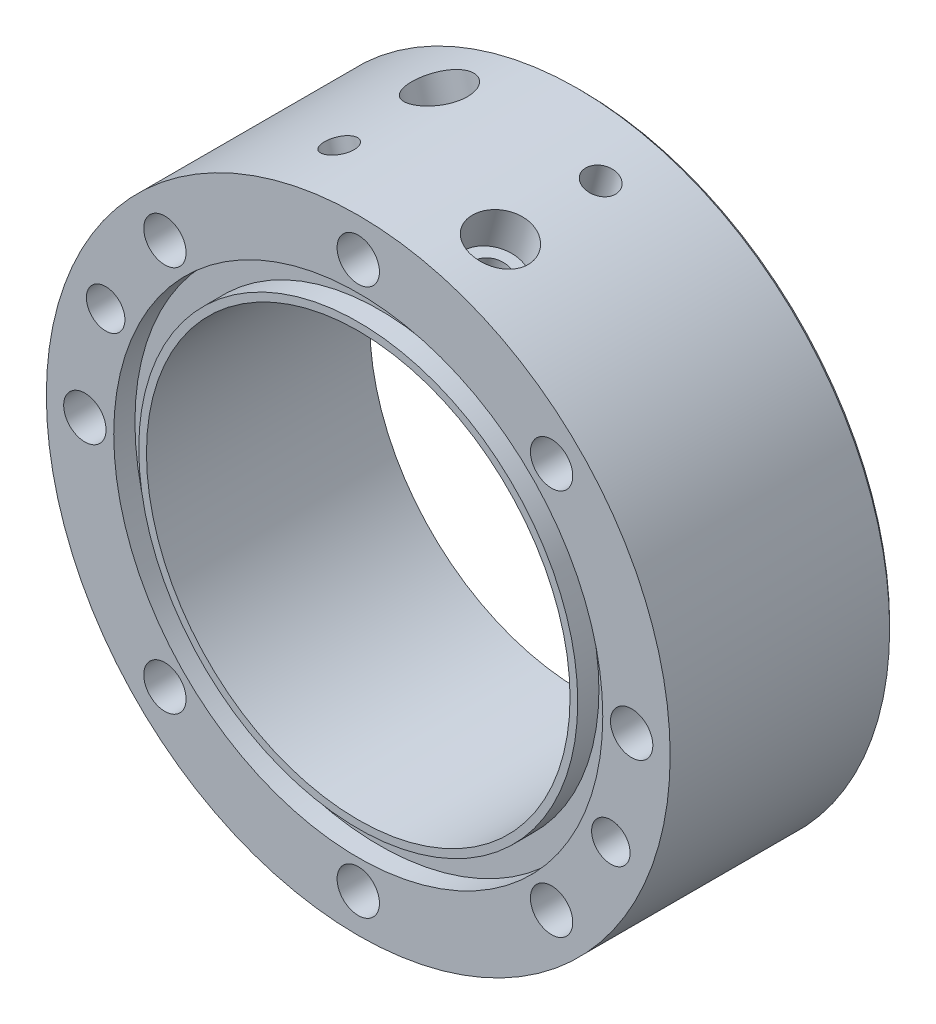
ISO-10303-21;
HEADER;
FILE_DESCRIPTION(('STEP AP214'),'2;1');
FILE_NAME('part.step','',(''),(''),'','','');
FILE_SCHEMA(('AUTOMOTIVE_DESIGN { 1 0 10303 214 1 1 1 1 }'));
ENDSEC;
DATA;
#1=APPLICATION_CONTEXT('core data for automotive mechanical design processes');
#2=APPLICATION_PROTOCOL_DEFINITION('international standard','automotive_design',2000,#1);
#3=PRODUCT_CONTEXT('',#1,'mechanical');
#4=PRODUCT('Part','Part','',(#3));
#5=PRODUCT_RELATED_PRODUCT_CATEGORY('part','',(#4));
#6=PRODUCT_DEFINITION_FORMATION('','',#4);
#7=PRODUCT_DEFINITION_CONTEXT('part definition',#1,'design');
#8=PRODUCT_DEFINITION('design','',#6,#7);
#9=PRODUCT_DEFINITION_SHAPE('','',#8);
#10=(LENGTH_UNIT() NAMED_UNIT(*) SI_UNIT(.MILLI.,.METRE.));
#11=(NAMED_UNIT(*) PLANE_ANGLE_UNIT() SI_UNIT($,.RADIAN.));
#12=(NAMED_UNIT(*) SI_UNIT($,.STERADIAN.) SOLID_ANGLE_UNIT());
#13=UNCERTAINTY_MEASURE_WITH_UNIT(LENGTH_MEASURE(1.E-05),#10,'distance_accuracy_value','');
#14=(GEOMETRIC_REPRESENTATION_CONTEXT(3) GLOBAL_UNCERTAINTY_ASSIGNED_CONTEXT((#13)) GLOBAL_UNIT_ASSIGNED_CONTEXT((#10,
#11,#12)) REPRESENTATION_CONTEXT('',''));
#15=CARTESIAN_POINT('',(0.,0.,0.));
#16=DIRECTION('',(0.,0.,1.));
#17=DIRECTION('',(1.,0.,0.));
#18=AXIS2_PLACEMENT_3D('',#15,#16,#17);
#19=CARTESIAN_POINT('',(0.,0.,29.));
#20=DIRECTION('',(0.,0.,-1.));
#21=DIRECTION('',(-1.,0.,0.));
#22=AXIS2_PLACEMENT_3D('',#19,#20,#21);
#23=CYLINDRICAL_SURFACE('',#22,81.);
#24=CARTESIAN_POINT('',(24.8024679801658,77.1092574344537,-13.));
#25=CARTESIAN_POINT('',(24.8024587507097,77.1092612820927,-13.2245347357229));
#26=CARTESIAN_POINT('',(24.7843894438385,77.115079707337,-13.4492287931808));
#27=CARTESIAN_POINT('',(24.7125434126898,77.1381330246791,-13.892418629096));
#28=CARTESIAN_POINT('',(24.6587245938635,77.1553813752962,-14.1109067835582));
#29=CARTESIAN_POINT('',(24.5168640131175,77.2005757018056,-14.5352006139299));
#30=CARTESIAN_POINT('',(24.428839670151,77.2285162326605,-14.7410126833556));
#31=CARTESIAN_POINT('',(24.2210016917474,77.2939511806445,-15.1341735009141));
#32=CARTESIAN_POINT('',(24.1011955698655,77.3314433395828,-15.3215265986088));
#33=CARTESIAN_POINT('',(23.8329489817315,77.4145349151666,-15.6726927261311));
#34=CARTESIAN_POINT('',(23.684483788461,77.4601413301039,-15.8364852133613));
#35=CARTESIAN_POINT('',(23.3630592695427,77.5576921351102,-16.1357055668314));
#36=CARTESIAN_POINT('',(23.190098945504,77.609636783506,-16.2711322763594));
#37=CARTESIAN_POINT('',(22.8243735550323,77.717979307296,-16.5098326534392));
#38=CARTESIAN_POINT('',(22.6315987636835,77.7743793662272,-16.6130904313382));
#39=CARTESIAN_POINT('',(22.231683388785,77.8896367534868,-16.7844198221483));
#40=CARTESIAN_POINT('',(22.0245429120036,77.9484940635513,-16.8524916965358));
#41=CARTESIAN_POINT('',(21.6018863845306,78.0666804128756,-16.9514630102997));
#42=CARTESIAN_POINT('',(21.3863773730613,78.1260090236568,-16.9823930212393));
#43=CARTESIAN_POINT('',(20.9529175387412,78.2433745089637,-17.0062969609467));
#44=CARTESIAN_POINT('',(20.7349667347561,78.3014113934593,-16.9992711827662));
#45=CARTESIAN_POINT('',(20.3030180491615,78.4145220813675,-16.9474883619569));
#46=CARTESIAN_POINT('',(20.0890168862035,78.4695984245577,-16.902764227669));
#47=CARTESIAN_POINT('',(19.6708878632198,78.5754587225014,-16.7769052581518));
#48=CARTESIAN_POINT('',(19.4667600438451,78.6262426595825,-16.6957702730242));
#49=CARTESIAN_POINT('',(19.0741514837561,78.722408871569,-16.499355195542));
#50=CARTESIAN_POINT('',(18.8856776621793,78.7677887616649,-16.3840601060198));
#51=CARTESIAN_POINT('',(18.5299121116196,78.8522405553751,-16.1226085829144));
#52=CARTESIAN_POINT('',(18.3626205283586,78.8913124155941,-15.9764519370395));
#53=CARTESIAN_POINT('',(18.0539022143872,78.9625341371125,-15.6572401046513));
#54=CARTESIAN_POINT('',(17.912503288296,78.994676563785,-15.4841563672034));
#55=CARTESIAN_POINT('',(17.6599209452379,79.0515275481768,-15.1161038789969));
#56=CARTESIAN_POINT('',(17.5487375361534,79.0762361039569,-14.9211351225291));
#57=CARTESIAN_POINT('',(17.3598521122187,79.117917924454,-14.514829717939));
#58=CARTESIAN_POINT('',(17.2821511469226,79.1348909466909,-14.3034925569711));
#59=CARTESIAN_POINT('',(17.1625363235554,79.1609191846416,-13.8704572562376));
#60=CARTESIAN_POINT('',(17.1206222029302,79.1699744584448,-13.6487591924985));
#61=CARTESIAN_POINT('',(17.0738516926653,79.1800743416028,-13.2015459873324));
#62=CARTESIAN_POINT('',(17.0689562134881,79.1811274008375,-12.9760351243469));
#63=CARTESIAN_POINT('',(17.0962654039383,79.1752353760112,-12.5273773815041));
#64=CARTESIAN_POINT('',(17.1284699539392,79.1682903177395,-12.3042304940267));
#65=CARTESIAN_POINT('',(17.2289970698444,79.146473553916,-11.8667471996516));
#66=CARTESIAN_POINT('',(17.2973017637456,79.1316057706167,-11.6524064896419));
#67=CARTESIAN_POINT('',(17.4679997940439,79.0940994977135,-11.2384873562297));
#68=CARTESIAN_POINT('',(17.5703933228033,79.0714609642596,-11.0389090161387));
#69=CARTESIAN_POINT('',(17.8063615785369,79.0186564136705,-10.6599961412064));
#70=CARTESIAN_POINT('',(17.9399623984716,78.9884840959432,-10.4806787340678));
#71=CARTESIAN_POINT('',(18.2343957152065,78.9210337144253,-10.1475501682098));
#72=CARTESIAN_POINT('',(18.3952283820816,78.8837556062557,-9.99373916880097));
#73=CARTESIAN_POINT('',(18.7396044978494,78.8026553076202,-9.71585535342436));
#74=CARTESIAN_POINT('',(18.9231674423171,78.7588274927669,-9.59180833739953));
#75=CARTESIAN_POINT('',(19.3075799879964,78.6654716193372,-9.37715010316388));
#76=CARTESIAN_POINT('',(19.5084295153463,78.6159435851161,-9.28653874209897));
#77=CARTESIAN_POINT('',(19.9215301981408,78.5122788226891,-9.14136906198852));
#78=CARTESIAN_POINT('',(20.1337760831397,78.4581442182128,-9.08679422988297));
#79=CARTESIAN_POINT('',(20.5636639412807,78.3465699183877,-9.01519270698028));
#80=CARTESIAN_POINT('',(20.7813058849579,78.2891302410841,-8.99816581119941));
#81=CARTESIAN_POINT('',(21.215541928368,78.1725736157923,-9.00214545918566));
#82=CARTESIAN_POINT('',(21.4321368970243,78.1134585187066,-9.02311152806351));
#83=CARTESIAN_POINT('',(21.858385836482,77.9952556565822,-9.10239830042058));
#84=CARTESIAN_POINT('',(22.0680397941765,77.9361678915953,-9.16071907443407));
#85=CARTESIAN_POINT('',(22.4745249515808,77.8199232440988,-9.31305151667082));
#86=CARTESIAN_POINT('',(22.6713560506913,77.7627663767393,-9.40706346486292));
#87=CARTESIAN_POINT('',(23.0467129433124,77.6523492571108,-9.62810246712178));
#88=CARTESIAN_POINT('',(23.2252393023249,77.5990888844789,-9.75512850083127));
#89=CARTESIAN_POINT('',(23.5592265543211,77.4983442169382,-10.0387343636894));
#90=CARTESIAN_POINT('',(23.7146652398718,77.4508654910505,-10.1953423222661));
#91=CARTESIAN_POINT('',(23.9980331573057,77.3635343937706,-10.5336496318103));
#92=CARTESIAN_POINT('',(24.1259556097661,77.323683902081,-10.7153551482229));
#93=CARTESIAN_POINT('',(24.350835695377,77.2531601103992,-11.0988398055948));
#94=CARTESIAN_POINT('',(24.4477638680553,77.2224955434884,-11.3006378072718));
#95=CARTESIAN_POINT('',(24.6077398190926,77.1716674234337,-11.7182925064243));
#96=CARTESIAN_POINT('',(24.6708276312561,77.1514914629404,-11.9341322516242));
#97=CARTESIAN_POINT('',(24.7448483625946,77.1277726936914,-12.2927615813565));
#98=CARTESIAN_POINT('',(24.766429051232,77.1208417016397,-12.4332280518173));
#99=CARTESIAN_POINT('',(24.7952417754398,77.1115828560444,-12.7157750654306));
#100=CARTESIAN_POINT('',(24.8024738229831,77.1092549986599,-12.8578556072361));
#101=CARTESIAN_POINT('',(24.8024679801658,77.1092574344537,-13.));
#102=B_SPLINE_CURVE_WITH_KNOTS('',3,(#24,#25,#26,#27,#28,#29,#30,#31,#32,#33,#34,#35,#36,#37,
#38,#39,#40,#41,#42,#43,#44,#45,#46,#47,#48,#49,#50,#51,#52,#53,#54,#55,#56,#57,#58,#59,#60,#61,
#62,#63,#64,#65,#66,#67,#68,#69,#70,#71,#72,#73,#74,#75,#76,#77,#78,#79,#80,#81,#82,#83,#84,#85,
#86,#87,#88,#89,#90,#91,#92,#93,#94,#95,#96,#97,#98,#99,#100,#101),.UNSPECIFIED.,.T.,.F.,(4,2,2,
2,2,2,2,2,2,2,2,2,2,2,2,2,2,2,2,2,2,2,2,2,2,2,2,2,2,2,2,2,2,2,2,2,2,2,4),(0.,0.673085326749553,
1.34696461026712,2.02050117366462,2.69387864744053,3.36783972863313,4.04182828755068,
4.71614923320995,5.39046516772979,6.06422568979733,6.7379810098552,7.41114879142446,
8.08431934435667,8.75778587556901,9.43125703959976,10.1054472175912,10.7796375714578,
11.4538490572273,12.1280555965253,12.8015501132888,13.4750424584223,14.1482016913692,
14.8213647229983,15.4950926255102,16.168824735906,16.8431387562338,17.5174498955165,
18.1914518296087,18.8654500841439,19.5387307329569,20.2120126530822,20.8852998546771,
21.5585662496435,22.2324761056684,22.9065518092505,23.5812663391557,24.2551808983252,
24.6812859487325,25.1073906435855),.UNSPECIFIED.);
#103=CARTESIAN_POINT('',(24.8024679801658,77.1092574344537,-13.));
#104=VERTEX_POINT('',#103);
#105=EDGE_CURVE('E240',#104,#104,#102,.T.);
#106=ORIENTED_EDGE('',*,*,#105,.F.);
#107=EDGE_LOOP('',(#106));
#108=FACE_BOUND('',#107,.T.);
#109=CARTESIAN_POINT('',(20.9643426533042,78.2399919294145,5.49999999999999));
#110=CARTESIAN_POINT('',(20.7612753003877,78.294404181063,5.49999801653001));
#111=CARTESIAN_POINT('',(20.5580249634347,78.3480153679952,5.50884278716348));
#112=CARTESIAN_POINT('',(20.1524876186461,78.4533053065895,5.54415678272));
#113=CARTESIAN_POINT('',(19.9502008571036,78.5049835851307,5.57063029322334));
#114=CARTESIAN_POINT('',(19.5479506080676,78.6061109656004,5.6410437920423));
#115=CARTESIAN_POINT('',(19.3479891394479,78.6555582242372,5.68499793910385));
#116=CARTESIAN_POINT('',(18.9519228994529,78.7519280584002,5.79007113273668));
#117=CARTESIAN_POINT('',(18.7558195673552,78.798849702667,5.85119645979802));
#118=CARTESIAN_POINT('',(18.3691525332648,78.8898830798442,5.99009594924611));
#119=CARTESIAN_POINT('',(18.1785837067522,78.933997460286,6.06785411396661));
#120=CARTESIAN_POINT('',(17.8041007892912,79.0193070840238,6.23952689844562));
#121=CARTESIAN_POINT('',(17.6201891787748,79.0605012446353,6.33344746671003));
#122=CARTESIAN_POINT('',(17.2605346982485,79.1397993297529,6.53669573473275));
#123=CARTESIAN_POINT('',(17.0847871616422,79.1779050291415,6.64601448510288));
#124=CARTESIAN_POINT('',(16.7425614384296,79.2509764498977,6.87936881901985));
#125=CARTESIAN_POINT('',(16.5760867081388,79.2859410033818,7.00340983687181));
#126=CARTESIAN_POINT('',(16.2533055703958,79.3527396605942,7.26561592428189));
#127=CARTESIAN_POINT('',(16.0970244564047,79.3845660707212,7.40381409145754));
#128=CARTESIAN_POINT('',(15.7961627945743,79.4449796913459,7.69316614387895));
#129=CARTESIAN_POINT('',(15.6515865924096,79.4735657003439,7.84432479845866));
#130=CARTESIAN_POINT('',(15.3752908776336,79.5274810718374,8.15846757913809));
#131=CARTESIAN_POINT('',(15.243569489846,79.5528109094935,8.32144997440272));
#132=CARTESIAN_POINT('',(14.9939407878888,79.6002379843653,8.65811703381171));
#133=CARTESIAN_POINT('',(14.8760336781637,79.6223351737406,8.8318018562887));
#134=CARTESIAN_POINT('',(14.6547242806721,79.6633651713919,9.18897136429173));
#135=CARTESIAN_POINT('',(14.5513484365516,79.682292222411,9.37247309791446));
#136=CARTESIAN_POINT('',(14.3601388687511,79.7169734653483,9.74769636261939));
#137=CARTESIAN_POINT('',(14.2723055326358,79.7327275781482,9.93941809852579));
#138=CARTESIAN_POINT('',(14.1128758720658,79.7611013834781,10.3296768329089));
#139=CARTESIAN_POINT('',(14.0412762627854,79.7737217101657,10.5282124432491));
#140=CARTESIAN_POINT('',(13.9148248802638,79.795875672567,10.9307913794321));
#141=CARTESIAN_POINT('',(13.8599788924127,79.8054082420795,11.1348365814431));
#142=CARTESIAN_POINT('',(13.7676390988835,79.8213900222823,11.5462763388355));
#143=CARTESIAN_POINT('',(13.7300926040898,79.8278485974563,11.7536587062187));
#144=CARTESIAN_POINT('',(13.6723976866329,79.8377504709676,12.17090390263));
#145=CARTESIAN_POINT('',(13.6522494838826,79.8411937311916,12.3807667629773));
#146=CARTESIAN_POINT('',(13.6295107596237,79.8450785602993,12.8014611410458));
#147=CARTESIAN_POINT('',(13.6269195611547,79.8455202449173,13.0122926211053));
#148=CARTESIAN_POINT('',(13.6393133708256,79.8434040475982,13.4334274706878));
#149=CARTESIAN_POINT('',(13.6542987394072,79.8408461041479,13.643730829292));
#150=CARTESIAN_POINT('',(13.7016510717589,79.8327334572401,14.0616116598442));
#151=CARTESIAN_POINT('',(13.7339606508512,79.8271886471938,14.2691958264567));
#152=CARTESIAN_POINT('',(13.8156842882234,79.8130852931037,14.6809358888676));
#153=CARTESIAN_POINT('',(13.8651042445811,79.804525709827,14.8850905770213));
#154=CARTESIAN_POINT('',(13.9806550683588,79.7843639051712,15.2883982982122));
#155=CARTESIAN_POINT('',(14.0467800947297,79.7727627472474,15.4875530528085));
#156=CARTESIAN_POINT('',(14.1952253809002,79.7464810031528,15.8795455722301));
#157=CARTESIAN_POINT('',(14.2775516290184,79.7317992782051,16.0723809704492));
#158=CARTESIAN_POINT('',(14.5481869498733,79.6830225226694,16.6397697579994));
#159=CARTESIAN_POINT('',(14.7600979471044,79.6442051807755,17.0030158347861));
#160=CARTESIAN_POINT('',(15.2400926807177,79.5537488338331,17.6881902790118));
#161=CARTESIAN_POINT('',(15.5081778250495,79.5021095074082,18.0101176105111));
#162=CARTESIAN_POINT('',(16.0937909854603,79.3856356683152,18.6050623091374));
#163=CARTESIAN_POINT('',(16.411501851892,79.3207520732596,18.8778904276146));
#164=CARTESIAN_POINT('',(17.0862405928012,79.1781477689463,19.3653521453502));
#165=CARTESIAN_POINT('',(17.4432685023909,79.1004270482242,19.5799856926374));
#166=CARTESIAN_POINT('',(18.1862599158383,78.9329134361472,19.9449758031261));
#167=CARTESIAN_POINT('',(18.5722274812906,78.8431188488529,20.0953233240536));
#168=CARTESIAN_POINT('',(19.3617940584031,78.6529446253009,20.327332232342));
#169=CARTESIAN_POINT('',(19.7653926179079,78.552565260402,20.4089953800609));
#170=CARTESIAN_POINT('',(20.5770108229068,78.3438670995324,20.5010801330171));
#171=CARTESIAN_POINT('',(20.9850086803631,78.2355789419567,20.5117633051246));
#172=CARTESIAN_POINT('',(21.7952320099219,78.0137442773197,20.4622693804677));
#173=CARTESIAN_POINT('',(22.1974575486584,77.9001978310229,20.4020931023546));
#174=CARTESIAN_POINT('',(22.9841157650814,77.671732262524,20.2128101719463));
#175=CARTESIAN_POINT('',(23.3685786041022,77.5568159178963,20.0838254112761));
#176=CARTESIAN_POINT('',(24.109909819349,77.3295719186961,19.7606942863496));
#177=CARTESIAN_POINT('',(24.4667776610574,77.2172443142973,19.5665466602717));
#178=CARTESIAN_POINT('',(25.1442280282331,76.9993180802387,19.1180136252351));
#179=CARTESIAN_POINT('',(25.4647027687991,76.8937398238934,18.8634558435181));
#180=CARTESIAN_POINT('',(26.0597731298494,76.6941125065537,18.3013318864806));
#181=CARTESIAN_POINT('',(26.3343677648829,76.6000636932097,17.9937645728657));
#182=CARTESIAN_POINT('',(26.7064889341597,76.470784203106,17.4991152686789));
#183=CARTESIAN_POINT('',(26.8241018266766,76.429584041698,17.3282959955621));
#184=CARTESIAN_POINT('',(27.0451636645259,76.3516393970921,16.9767813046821));
#185=CARTESIAN_POINT('',(27.1486174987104,76.3148933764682,16.7960893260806));
#186=CARTESIAN_POINT('',(27.3406817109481,76.2462952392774,16.4260669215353));
#187=CARTESIAN_POINT('',(27.4292894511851,76.2144439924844,16.2367349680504));
#188=CARTESIAN_POINT('',(27.5910566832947,76.1560305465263,15.8507964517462));
#189=CARTESIAN_POINT('',(27.66421657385,76.1294682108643,15.6541900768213));
#190=CARTESIAN_POINT('',(27.794495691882,76.0820005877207,15.2554014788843));
#191=CARTESIAN_POINT('',(27.8516389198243,76.061086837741,15.0532281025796));
#192=CARTESIAN_POINT('',(27.9496453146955,76.0251277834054,14.6444650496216));
#193=CARTESIAN_POINT('',(27.9905087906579,76.0100823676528,14.4378754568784));
#194=CARTESIAN_POINT('',(28.0556855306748,75.9860494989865,14.0217168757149));
#195=CARTESIAN_POINT('',(28.0799959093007,75.9770631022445,13.8121473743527));
#196=CARTESIAN_POINT('',(28.1118837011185,75.9652702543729,13.3916448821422));
#197=CARTESIAN_POINT('',(28.1194673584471,75.9624614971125,13.1807124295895));
#198=CARTESIAN_POINT('',(28.1178713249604,75.9630522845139,12.7596425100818));
#199=CARTESIAN_POINT('',(28.1087489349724,75.96643060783,12.5495047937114));
#200=CARTESIAN_POINT('',(28.0739205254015,75.9793085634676,12.1308708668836));
#201=CARTESIAN_POINT('',(28.0482202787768,75.9888060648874,11.9223741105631));
#202=CARTESIAN_POINT('',(27.9804087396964,76.0138015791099,11.5083921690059));
#203=CARTESIAN_POINT('',(27.9382944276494,76.0293006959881,11.3029075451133));
#204=CARTESIAN_POINT('',(27.8379393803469,76.0661027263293,10.896450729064));
#205=CARTESIAN_POINT('',(27.7796990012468,76.087405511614,10.6954784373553));
#206=CARTESIAN_POINT('',(27.6474871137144,76.1355462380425,10.2994782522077));
#207=CARTESIAN_POINT('',(27.5735169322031,76.16238371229,10.1044498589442));
#208=CARTESIAN_POINT('',(27.4103366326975,76.2212632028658,9.72169440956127));
#209=CARTESIAN_POINT('',(27.3211267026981,76.2533051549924,9.53396726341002));
#210=CARTESIAN_POINT('',(27.128041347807,76.322210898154,9.16709555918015));
#211=CARTESIAN_POINT('',(27.0241633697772,76.359075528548,8.98795250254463));
#212=CARTESIAN_POINT('',(26.8024812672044,76.437168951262,8.63959995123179));
#213=CARTESIAN_POINT('',(26.6846822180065,76.4783961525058,8.47038686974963));
#214=CARTESIAN_POINT('',(26.4354068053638,76.5649184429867,8.14234871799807));
#215=CARTESIAN_POINT('',(26.3038776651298,76.6102291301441,7.98356786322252));
#216=CARTESIAN_POINT('',(26.0284587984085,76.7042403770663,7.67830955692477));
#217=CARTESIAN_POINT('',(25.8845736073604,76.7529396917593,7.531827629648));
#218=CARTESIAN_POINT('',(25.5852671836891,76.8532303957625,7.25204723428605));
#219=CARTESIAN_POINT('',(25.4298389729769,76.9048235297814,7.1187568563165));
#220=CARTESIAN_POINT('',(25.1086235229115,77.0102953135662,6.86645007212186));
#221=CARTESIAN_POINT('',(24.9428401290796,77.0641731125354,6.74742841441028));
#222=CARTESIAN_POINT('',(24.601536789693,77.1738076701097,6.52415837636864));
#223=CARTESIAN_POINT('',(24.4259927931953,77.229568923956,6.41994896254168));
#224=CARTESIAN_POINT('',(24.0668256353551,77.3422479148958,6.2274536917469));
#225=CARTESIAN_POINT('',(23.8832054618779,77.399165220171,6.13916200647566));
#226=CARTESIAN_POINT('',(23.5092396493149,77.5135719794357,5.97915903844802));
#227=CARTESIAN_POINT('',(23.3188997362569,77.5710609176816,5.90743401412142));
#228=CARTESIAN_POINT('',(22.9327386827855,77.6860997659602,5.78100910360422));
#229=CARTESIAN_POINT('',(22.7369189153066,77.7436496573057,5.72630499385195));
#230=CARTESIAN_POINT('',(22.2815450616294,77.8755705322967,5.62045743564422));
#231=CARTESIAN_POINT('',(22.0205285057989,77.9497971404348,5.57532856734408));
#232=CARTESIAN_POINT('',(21.4945595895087,78.0964687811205,5.5151011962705));
#233=CARTESIAN_POINT('',(21.2296072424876,78.1689138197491,5.50000259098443));
#234=CARTESIAN_POINT('',(20.9643426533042,78.2399919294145,5.49999999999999));
#235=B_SPLINE_CURVE_WITH_KNOTS('',3,(#109,#110,#111,#112,#113,#114,#115,#116,#117,#118,#119,
#120,#121,#122,#123,#124,#125,#126,#127,#128,#129,#130,#131,#132,#133,#134,#135,#136,#137,#138,
#139,#140,#141,#142,#143,#144,#145,#146,#147,#148,#149,#150,#151,#152,#153,#154,#155,#156,#157,
#158,#159,#160,#161,#162,#163,#164,#165,#166,#167,#168,#169,#170,#171,#172,#173,#174,#175,#176,
#177,#178,#179,#180,#181,#182,#183,#184,#185,#186,#187,#188,#189,#190,#191,#192,#193,#194,#195,
#196,#197,#198,#199,#200,#201,#202,#203,#204,#205,#206,#207,#208,#209,#210,#211,#212,#213,#214,
#215,#216,#217,#218,#219,#220,#221,#222,#223,#224,#225,#226,#227,#228,#229,#230,#231,#232,#233,
#234),.UNSPECIFIED.,.T.,.F.,(4,2,2,2,2,2,2,2,2,2,2,2,2,2,2,2,2,2,2,2,2,2,2,2,2,2,2,2,2,2,2,2,2,
2,2,2,2,2,2,2,2,2,2,2,2,2,2,2,2,2,2,2,2,2,2,2,2,2,2,2,2,2,4),(0.,0.63045267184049,
1.26105866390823,1.89217646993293,2.52352541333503,3.15426982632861,3.78524688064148,
4.41585871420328,5.04670404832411,5.67905941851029,6.31164849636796,6.94414515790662,
7.57665117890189,8.21029371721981,8.84395205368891,9.47748205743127,10.1112305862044,
10.7430359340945,11.3748492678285,12.0066382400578,12.6384401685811,13.2681621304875,
13.8981013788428,14.5278206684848,15.157773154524,16.41826417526,17.6787867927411,
18.9440685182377,20.2093513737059,21.4748121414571,22.7402404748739,24.0010030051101,
25.261750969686,26.5202729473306,27.7788192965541,29.0410008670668,30.3032095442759,
30.9369301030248,31.5704312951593,32.2040449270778,32.8376422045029,33.4702849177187,
34.1029156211,34.7356565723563,35.3681612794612,35.9985005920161,36.6286205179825,
37.2588564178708,37.8890783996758,38.5192472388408,39.149408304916,39.7796791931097,
40.4097210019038,41.0422806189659,41.6746090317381,42.3073228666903,42.9398031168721,
43.5739175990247,44.2077994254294,44.8411535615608,45.4743504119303,46.2979064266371,
47.1214596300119),.UNSPECIFIED.);
#236=CARTESIAN_POINT('',(20.9643426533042,78.2399919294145,5.49999999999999));
#237=VERTEX_POINT('',#236);
#238=EDGE_CURVE('E52',#237,#237,#235,.T.);
#239=ORIENTED_EDGE('',*,*,#238,.F.);
#240=EDGE_LOOP('',(#239));
#241=FACE_BOUND('',#240,.T.);
#242=CARTESIAN_POINT('',(0.,0.,-27.9999999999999));
#243=DIRECTION('',(0.,0.,1.));
#244=DIRECTION('',(1.,0.,0.));
#245=AXIS2_PLACEMENT_3D('',#242,#243,#244);
#246=CIRCLE('',#245,81.);
#247=CARTESIAN_POINT('',(81.,0.,-27.9999999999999));
#248=VERTEX_POINT('',#247);
#249=EDGE_CURVE('E65',#248,#248,#246,.T.);
#250=ORIENTED_EDGE('',*,*,#249,.T.);
#251=EDGE_LOOP('',(#250));
#252=FACE_BOUND('',#251,.T.);
#253=CARTESIAN_POINT('',(0.,0.,29.));
#254=DIRECTION('',(0.,0.,1.));
#255=DIRECTION('',(1.,0.,0.));
#256=AXIS2_PLACEMENT_3D('',#253,#254,#255);
#257=CIRCLE('',#256,81.);
#258=CARTESIAN_POINT('',(81.,0.,29.));
#259=VERTEX_POINT('',#258);
#260=EDGE_CURVE('E206',#259,#259,#257,.T.);
#261=ORIENTED_EDGE('',*,*,#260,.F.);
#262=EDGE_LOOP('',(#261));
#263=FACE_BOUND('',#262,.T.);
#264=CARTESIAN_POINT('',(-17.0750613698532,79.1798097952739,13.));
#265=CARTESIAN_POINT('',(-17.0750712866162,79.179808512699,12.7754652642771));
#266=CARTESIAN_POINT('',(-17.0936289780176,79.1758127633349,12.5507712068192));
#267=CARTESIAN_POINT('',(-17.1673761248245,79.1598545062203,12.1075813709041));
#268=CARTESIAN_POINT('',(-17.2226087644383,79.147882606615,11.8890932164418));
#269=CARTESIAN_POINT('',(-17.3680607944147,79.116091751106,11.4647993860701));
#270=CARTESIAN_POINT('',(-17.4582623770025,79.0962767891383,11.2589873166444));
#271=CARTESIAN_POINT('',(-17.6709728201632,79.049026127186,10.8658264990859));
#272=CARTESIAN_POINT('',(-17.793474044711,79.0215922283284,10.6784734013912));
#273=CARTESIAN_POINT('',(-18.0673281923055,78.9594283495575,10.3273072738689));
#274=CARTESIAN_POINT('',(-18.2187060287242,78.9246920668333,10.1635147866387));
#275=CARTESIAN_POINT('',(-18.5458432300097,78.8484612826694,9.86429443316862));
#276=CARTESIAN_POINT('',(-18.7216035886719,78.8069665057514,9.72886772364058));
#277=CARTESIAN_POINT('',(-19.0925023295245,78.7179311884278,9.49016734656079));
#278=CARTESIAN_POINT('',(-19.2876502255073,78.6703876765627,9.38690956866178));
#279=CARTESIAN_POINT('',(-19.6916157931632,78.5702458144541,9.21558017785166));
#280=CARTESIAN_POINT('',(-19.9004333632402,78.5176475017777,9.14750830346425));
#281=CARTESIAN_POINT('',(-20.3255578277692,78.4086716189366,9.04853698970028));
#282=CARTESIAN_POINT('',(-20.5418584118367,78.3522971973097,9.0176069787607));
#283=CARTESIAN_POINT('',(-20.9759283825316,78.2372087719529,8.9937030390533));
#284=CARTESIAN_POINT('',(-21.1936977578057,78.1784947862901,9.00072881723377));
#285=CARTESIAN_POINT('',(-21.624331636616,78.0604771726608,9.0525116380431));
#286=CARTESIAN_POINT('',(-21.8372002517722,78.0011741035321,9.09723577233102));
#287=CARTESIAN_POINT('',(-22.2522407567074,77.8837872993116,9.22309474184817));
#288=CARTESIAN_POINT('',(-22.4544126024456,77.8257035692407,9.30422972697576));
#289=CARTESIAN_POINT('',(-22.8425046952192,77.7126816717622,9.50064480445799));
#290=CARTESIAN_POINT('',(-23.028417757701,77.6577448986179,9.61593989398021));
#291=CARTESIAN_POINT('',(-23.3787456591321,77.5529995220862,9.87739141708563));
#292=CARTESIAN_POINT('',(-23.543160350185,77.5031909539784,10.0235480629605));
#293=CARTESIAN_POINT('',(-23.846129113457,77.4105116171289,10.3427598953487));
#294=CARTESIAN_POINT('',(-23.984655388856,77.3676483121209,10.5158436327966));
#295=CARTESIAN_POINT('',(-24.2318236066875,77.2905915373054,10.8838961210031));
#296=CARTESIAN_POINT('',(-24.3404655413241,77.2563980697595,11.0788648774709));
#297=CARTESIAN_POINT('',(-24.5248860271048,77.1980528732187,11.485170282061));
#298=CARTESIAN_POINT('',(-24.6006635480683,77.1739014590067,11.6965074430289));
#299=CARTESIAN_POINT('',(-24.7172671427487,77.1366351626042,12.1295427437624));
#300=CARTESIAN_POINT('',(-24.7580934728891,77.1235201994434,12.3512408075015));
#301=CARTESIAN_POINT('',(-24.8036478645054,77.108881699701,12.7984540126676));
#302=CARTESIAN_POINT('',(-24.808414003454,77.1073459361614,13.0239648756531));
#303=CARTESIAN_POINT('',(-24.7818175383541,77.1158978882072,13.4726226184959));
#304=CARTESIAN_POINT('',(-24.7504550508,77.1259855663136,13.6957695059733));
#305=CARTESIAN_POINT('',(-24.6524876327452,77.1573552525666,14.1332528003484));
#306=CARTESIAN_POINT('',(-24.5859001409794,77.178631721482,14.3475935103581));
#307=CARTESIAN_POINT('',(-24.4193181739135,77.2314993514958,14.7615126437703));
#308=CARTESIAN_POINT('',(-24.3193235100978,77.2630905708,14.9610909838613));
#309=CARTESIAN_POINT('',(-24.0885667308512,77.3353446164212,15.3400038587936));
#310=CARTESIAN_POINT('',(-23.9577788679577,77.3760150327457,15.5193212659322));
#311=CARTESIAN_POINT('',(-23.6690669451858,77.4648179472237,15.8524498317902));
#312=CARTESIAN_POINT('',(-23.5111427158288,77.5129504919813,16.006260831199));
#313=CARTESIAN_POINT('',(-23.1723541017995,77.6149036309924,16.2841446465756));
#314=CARTESIAN_POINT('',(-22.9914700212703,77.668729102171,16.4081916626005));
#315=CARTESIAN_POINT('',(-22.6118810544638,77.7800868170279,16.6228498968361));
#316=CARTESIAN_POINT('',(-22.4131762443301,77.8376190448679,16.713461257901));
#317=CARTESIAN_POINT('',(-22.0035881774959,77.9543930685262,16.8586309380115));
#318=CARTESIAN_POINT('',(-21.792710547,78.0136340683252,16.913205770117));
#319=CARTESIAN_POINT('',(-21.3646295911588,78.1319518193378,16.9848072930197));
#320=CARTESIAN_POINT('',(-21.1474263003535,78.1910285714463,17.0018341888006));
#321=CARTESIAN_POINT('',(-20.7130885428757,78.3072055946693,16.9978545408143));
#322=CARTESIAN_POINT('',(-20.4959542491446,78.364307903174,16.9768884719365));
#323=CARTESIAN_POINT('',(-20.0677104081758,78.4750656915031,16.8976016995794));
#324=CARTESIAN_POINT('',(-19.856600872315,78.5287211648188,16.8392809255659));
#325=CARTESIAN_POINT('',(-19.4464520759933,78.631292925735,16.6869484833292));
#326=CARTESIAN_POINT('',(-19.2474129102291,78.6802091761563,16.5929365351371));
#327=CARTESIAN_POINT('',(-18.8671357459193,78.7722635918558,16.3718975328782));
#328=CARTESIAN_POINT('',(-18.6858971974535,78.8154019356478,16.2448714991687));
#329=CARTESIAN_POINT('',(-18.3462834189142,78.8951481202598,15.9612656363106));
#330=CARTESIAN_POINT('',(-18.1879302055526,78.9317496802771,15.8046576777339));
#331=CARTESIAN_POINT('',(-17.8988608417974,78.9978026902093,15.4663503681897));
#332=CARTESIAN_POINT('',(-17.7681515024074,79.027252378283,15.2846448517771));
#333=CARTESIAN_POINT('',(-17.5381377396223,79.0786170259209,14.9011601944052));
#334=CARTESIAN_POINT('',(-17.4388631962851,79.1005248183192,14.6993621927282));
#335=CARTESIAN_POINT('',(-17.2749058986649,79.1364943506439,14.2817074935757));
#336=CARTESIAN_POINT('',(-17.2101822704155,79.1505653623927,14.0658677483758));
#337=CARTESIAN_POINT('',(-17.1342190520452,79.1670346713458,13.7072384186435));
#338=CARTESIAN_POINT('',(-17.1120641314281,79.1718226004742,13.5667719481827));
#339=CARTESIAN_POINT('',(-17.0824821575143,79.1782105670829,13.2842249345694));
#340=CARTESIAN_POINT('',(-17.0750550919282,79.1798106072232,13.1421443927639));
#341=CARTESIAN_POINT('',(-17.0750613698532,79.1798097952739,13.));
#342=B_SPLINE_CURVE_WITH_KNOTS('',3,(#264,#265,#266,#267,#268,#269,#270,#271,#272,#273,#274,
#275,#276,#277,#278,#279,#280,#281,#282,#283,#284,#285,#286,#287,#288,#289,#290,#291,#292,#293,
#294,#295,#296,#297,#298,#299,#300,#301,#302,#303,#304,#305,#306,#307,#308,#309,#310,#311,#312,
#313,#314,#315,#316,#317,#318,#319,#320,#321,#322,#323,#324,#325,#326,#327,#328,#329,#330,#331,
#332,#333,#334,#335,#336,#337,#338,#339,#340,#341),.UNSPECIFIED.,.T.,.F.,(4,2,2,2,2,2,2,2,2,2,2,
2,2,2,2,2,2,2,2,2,2,2,2,2,2,2,2,2,2,2,2,2,2,2,2,2,2,2,4),(0.,0.673085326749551,1.34696461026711,
2.02050117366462,2.69387864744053,3.36783972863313,4.04182828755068,4.71614923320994,
5.39046516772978,6.06422568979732,6.7379810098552,7.41114879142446,8.08431934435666,
8.757785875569,9.43125703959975,10.1054472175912,10.7796375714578,11.4538490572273,
12.1280555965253,12.8015501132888,13.4750424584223,14.1482016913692,14.8213647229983,
15.4950926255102,16.168824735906,16.8431387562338,17.5174498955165,18.1914518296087,
18.8654500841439,19.5387307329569,20.2120126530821,20.8852998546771,21.5585662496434,
22.2324761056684,22.9065518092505,23.5812663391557,24.2551808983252,24.6812859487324,
25.1073906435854),.UNSPECIFIED.);
#343=CARTESIAN_POINT('',(-17.0750613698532,79.1798097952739,13.));
#344=VERTEX_POINT('',#343);
#345=EDGE_CURVE('E108',#344,#344,#342,.T.);
#346=ORIENTED_EDGE('',*,*,#345,.F.);
#347=EDGE_LOOP('',(#346));
#348=FACE_BOUND('',#347,.T.);
#349=CARTESIAN_POINT('',(-20.9643426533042,78.2399919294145,-20.5));
#350=CARTESIAN_POINT('',(-21.1674102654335,78.1855806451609,-20.50000198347));
#351=CARTESIAN_POINT('',(-21.3702358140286,78.1303841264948,-20.4911572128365));
#352=CARTESIAN_POINT('',(-21.774086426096,78.0187992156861,-20.45584321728));
#353=CARTESIAN_POINT('',(-21.9751110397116,77.9624105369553,-20.4293697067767));
#354=CARTESIAN_POINT('',(-22.3740336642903,77.8488642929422,-20.3589562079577));
#355=CARTESIAN_POINT('',(-22.5719290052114,77.7917061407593,-20.3150020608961));
#356=CARTESIAN_POINT('',(-22.96311734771,77.6771317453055,-20.2099288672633));
#357=CARTESIAN_POINT('',(-23.1564086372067,77.6197154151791,-20.148803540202));
#358=CARTESIAN_POINT('',(-23.5367888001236,77.5052191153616,-20.0099040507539));
#359=CARTESIAN_POINT('',(-23.7238834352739,77.4481388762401,-19.9321458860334));
#360=CARTESIAN_POINT('',(-24.0908499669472,77.3347777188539,-19.7604731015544));
#361=CARTESIAN_POINT('',(-24.2707191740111,77.2784971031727,-19.66655253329));
#362=CARTESIAN_POINT('',(-24.6218381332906,77.1673440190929,-19.4633042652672));
#363=CARTESIAN_POINT('',(-24.7930928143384,77.1124707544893,-19.3539855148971));
#364=CARTESIAN_POINT('',(-25.1260046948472,77.0046395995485,-19.1206311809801));
#365=CARTESIAN_POINT('',(-25.2876583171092,76.9516824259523,-18.9965901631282));
#366=CARTESIAN_POINT('',(-25.6005943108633,76.8481411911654,-18.7343840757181));
#367=CARTESIAN_POINT('',(-25.7518509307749,76.7975631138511,-18.5961859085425));
#368=CARTESIAN_POINT('',(-26.0426115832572,76.6994520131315,-18.306833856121));
#369=CARTESIAN_POINT('',(-26.1821112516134,76.6519201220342,-18.1556752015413));
#370=CARTESIAN_POINT('',(-26.448348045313,76.560464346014,-17.8415324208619));
#371=CARTESIAN_POINT('',(-26.5750870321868,76.5165399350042,-17.6785500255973));
#372=CARTESIAN_POINT('',(-26.8149853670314,76.4327986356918,-17.3418829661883));
#373=CARTESIAN_POINT('',(-26.9281445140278,76.3929818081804,-17.1681981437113));
#374=CARTESIAN_POINT('',(-27.1403190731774,76.3178601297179,-16.8110286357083));
#375=CARTESIAN_POINT('',(-27.2393087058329,76.2825635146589,-16.6275269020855));
#376=CARTESIAN_POINT('',(-27.4222416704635,76.2169935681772,-16.2523036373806));
#377=CARTESIAN_POINT('',(-27.5061846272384,76.1867203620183,-16.0605819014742));
#378=CARTESIAN_POINT('',(-27.6584416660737,76.131577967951,-15.6703231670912));
#379=CARTESIAN_POINT('',(-27.7267589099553,76.1067076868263,-15.4717875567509));
#380=CARTESIAN_POINT('',(-27.8473460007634,76.0626678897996,-15.0692086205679));
#381=CARTESIAN_POINT('',(-27.8996103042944,76.0435003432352,-14.8651634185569));
#382=CARTESIAN_POINT('',(-27.9875698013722,76.011171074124,-14.4537236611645));
#383=CARTESIAN_POINT('',(-28.0233153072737,75.9979911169,-14.2463412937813));
#384=CARTESIAN_POINT('',(-28.0782315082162,75.9777189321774,-13.82909609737));
#385=CARTESIAN_POINT('',(-28.0974019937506,75.9706267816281,-13.6192332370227));
#386=CARTESIAN_POINT('',(-28.1190367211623,75.9626217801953,-13.1985388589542));
#387=CARTESIAN_POINT('',(-28.1215016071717,75.9617086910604,-12.9877073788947));
#388=CARTESIAN_POINT('',(-28.1097101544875,75.9660729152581,-12.5665725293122));
#389=CARTESIAN_POINT('',(-28.0954534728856,75.9713503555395,-12.356269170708));
#390=CARTESIAN_POINT('',(-28.0503888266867,75.9880007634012,-11.9383883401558));
#391=CARTESIAN_POINT('',(-28.019635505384,75.9993536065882,-11.7308041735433));
#392=CARTESIAN_POINT('',(-27.941809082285,76.0280015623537,-11.3190641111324));
#393=CARTESIAN_POINT('',(-27.8947303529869,76.045298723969,-11.1149094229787));
#394=CARTESIAN_POINT('',(-27.7845795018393,76.0856135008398,-10.7116017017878));
#395=CARTESIAN_POINT('',(-27.7215129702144,76.10862911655,-10.5124469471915));
#396=CARTESIAN_POINT('',(-27.5798147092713,76.1600911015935,-10.1204544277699));
#397=CARTESIAN_POINT('',(-27.5011772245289,76.1885394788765,-9.92761902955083));
#398=CARTESIAN_POINT('',(-27.2424117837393,76.2816152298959,-9.36023024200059));
#399=CARTESIAN_POINT('',(-27.0394828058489,76.3539539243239,-8.99698416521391));
#400=CARTESIAN_POINT('',(-26.5785669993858,76.5156137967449,-8.31180972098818));
#401=CARTESIAN_POINT('',(-26.3205787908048,76.6049354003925,-7.98988238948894));
#402=CARTESIAN_POINT('',(-25.7551859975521,76.7968726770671,-7.39493769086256));
#403=CARTESIAN_POINT('',(-25.4475985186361,76.899537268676,-7.12210957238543));
#404=CARTESIAN_POINT('',(-24.7919554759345,77.1134076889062,-6.63464785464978));
#405=CARTESIAN_POINT('',(-24.4438998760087,77.2246135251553,-6.42001430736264));
#406=CARTESIAN_POINT('',(-23.7166936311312,77.4510381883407,-6.05502419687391));
#407=CARTESIAN_POINT('',(-23.3375386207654,77.5662575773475,-5.90467667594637));
#408=CARTESIAN_POINT('',(-22.5586667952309,77.7963451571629,-5.67266776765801));
#409=CARTESIAN_POINT('',(-22.1589505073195,77.911213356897,-5.59100461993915));
#410=CARTESIAN_POINT('',(-21.3517194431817,78.1362845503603,-5.49891986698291));
#411=CARTESIAN_POINT('',(-20.944238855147,78.2465031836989,-5.48823669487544));
#412=CARTESIAN_POINT('',(-20.1316475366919,78.4595003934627,-5.53773061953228));
#413=CARTESIAN_POINT('',(-19.7265367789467,78.5622790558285,-5.59790689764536));
#414=CARTESIAN_POINT('',(-18.9310379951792,78.7577511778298,-5.78718982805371));
#415=CARTESIAN_POINT('',(-18.5406252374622,78.8504621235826,-5.91617458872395));
#416=CARTESIAN_POINT('',(-17.7849915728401,79.024328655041,-6.2393057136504));
#417=CARTESIAN_POINT('',(-17.4197711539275,79.1054840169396,-6.43345333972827));
#418=CARTESIAN_POINT('',(-16.7241188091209,79.2554795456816,-6.88198637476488));
#419=CARTESIAN_POINT('',(-16.3937904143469,79.3242834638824,-7.13654415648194));
#420=CARTESIAN_POINT('',(-15.7786307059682,79.448936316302,-7.69866811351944));
#421=CARTESIAN_POINT('',(-15.4938003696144,79.5047849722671,-8.00623542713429));
#422=CARTESIAN_POINT('',(-15.1068942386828,79.5788862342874,-8.50088473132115));
#423=CARTESIAN_POINT('',(-14.9844384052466,79.6020122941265,-8.67170400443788));
#424=CARTESIAN_POINT('',(-14.7540209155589,79.6450411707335,-9.02321869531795));
#425=CARTESIAN_POINT('',(-14.6460542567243,79.6649451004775,-9.20391067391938));
#426=CARTESIAN_POINT('',(-14.4454227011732,79.7015694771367,-9.57393307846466));
#427=CARTESIAN_POINT('',(-14.3527605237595,79.7182893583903,-9.76326503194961));
#428=CARTESIAN_POINT('',(-14.1834592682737,79.7485854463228,-10.1492035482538));
#429=CARTESIAN_POINT('',(-14.1068197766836,79.7621617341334,-10.3458099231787));
#430=CARTESIAN_POINT('',(-13.9702609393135,79.7861931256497,-10.7445985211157));
#431=CARTESIAN_POINT('',(-13.9103165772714,79.7966529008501,-10.9467718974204));
#432=CARTESIAN_POINT('',(-13.8074610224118,79.8145146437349,-11.3555349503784));
#433=CARTESIAN_POINT('',(-13.7645495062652,79.8219166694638,-11.5621245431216));
#434=CARTESIAN_POINT('',(-13.6960883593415,79.8336919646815,-11.9782831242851));
#435=CARTESIAN_POINT('',(-13.6705417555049,79.8380647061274,-12.1878526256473));
#436=CARTESIAN_POINT('',(-13.6370296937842,79.8437956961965,-12.6083551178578));
#437=CARTESIAN_POINT('',(-13.6290576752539,79.8451550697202,-12.8192875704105));
#438=CARTESIAN_POINT('',(-13.6307352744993,79.8448686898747,-13.2403574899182));
#439=CARTESIAN_POINT('',(-13.6403246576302,79.8432332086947,-13.4504952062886));
#440=CARTESIAN_POINT('',(-13.6769259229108,79.8369716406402,-13.8691291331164));
#441=CARTESIAN_POINT('',(-13.7039317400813,79.8323465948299,-14.0776258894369));
#442=CARTESIAN_POINT('',(-13.7751560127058,79.820087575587,-14.4916078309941));
#443=CARTESIAN_POINT('',(-13.8193776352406,79.8124530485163,-14.6970924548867));
#444=CARTESIAN_POINT('',(-13.9246886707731,79.7941470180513,-15.103549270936));
#445=CARTESIAN_POINT('',(-13.9857777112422,79.7834755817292,-15.3045215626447));
#446=CARTESIAN_POINT('',(-14.1243469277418,79.7590607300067,-15.7005217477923));
#447=CARTESIAN_POINT('',(-14.2018257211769,79.7453175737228,-15.8955501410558));
#448=CARTESIAN_POINT('',(-14.3725837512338,79.7147185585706,-16.2783055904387));
#449=CARTESIAN_POINT('',(-14.4658627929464,79.6978627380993,-16.46603273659));
#450=CARTESIAN_POINT('',(-14.6675324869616,79.6609941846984,-16.8329044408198));
#451=CARTESIAN_POINT('',(-14.7759257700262,79.6409809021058,-17.0120474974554));
#452=CARTESIAN_POINT('',(-15.0069548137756,79.5977707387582,-17.3604000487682));
#453=CARTESIAN_POINT('',(-15.1295853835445,79.5745750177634,-17.5296131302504));
#454=CARTESIAN_POINT('',(-15.3887253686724,79.5248678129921,-17.8576512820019));
#455=CARTESIAN_POINT('',(-15.5252882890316,79.4983434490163,-18.0164321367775));
#456=CARTESIAN_POINT('',(-15.8108136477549,79.4420501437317,-18.3216904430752));
#457=CARTESIAN_POINT('',(-15.9597715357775,79.4122823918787,-18.468172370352));
#458=CARTESIAN_POINT('',(-16.2691238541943,79.3494834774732,-18.747952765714));
#459=CARTESIAN_POINT('',(-16.4295252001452,79.3164503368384,-18.8812431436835));
#460=CARTESIAN_POINT('',(-16.7604418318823,79.2471838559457,-19.1335499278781));
#461=CARTESIAN_POINT('',(-16.930953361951,79.2109517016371,-19.2525715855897));
#462=CARTESIAN_POINT('',(-17.2813480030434,79.1352463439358,-19.4758416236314));
#463=CARTESIAN_POINT('',(-17.4612541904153,79.0957650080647,-19.5800510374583));
#464=CARTESIAN_POINT('',(-17.82864156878,79.0137642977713,-19.7725463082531));
#465=CARTESIAN_POINT('',(-18.0161199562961,78.971246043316,-19.8608379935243));
#466=CARTESIAN_POINT('',(-18.3971872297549,78.8833422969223,-20.020840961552));
#467=CARTESIAN_POINT('',(-18.5907708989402,78.8379592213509,-20.0925659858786));
#468=CARTESIAN_POINT('',(-18.9827156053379,78.7445052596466,-20.2189908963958));
#469=CARTESIAN_POINT('',(-19.1810754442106,78.6964350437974,-20.273695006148));
#470=CARTESIAN_POINT('',(-19.6414012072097,78.5829949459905,-20.3795425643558));
#471=CARTESIAN_POINT('',(-19.9045614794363,78.5167687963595,-20.4246714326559));
#472=CARTESIAN_POINT('',(-20.4333997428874,78.380805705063,-20.4848988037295));
#473=CARTESIAN_POINT('',(-20.6990777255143,78.3110687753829,-20.4999974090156));
#474=CARTESIAN_POINT('',(-20.9643426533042,78.2399919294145,-20.5));
#475=B_SPLINE_CURVE_WITH_KNOTS('',3,(#349,#350,#351,#352,#353,#354,#355,#356,#357,#358,#359,
#360,#361,#362,#363,#364,#365,#366,#367,#368,#369,#370,#371,#372,#373,#374,#375,#376,#377,#378,
#379,#380,#381,#382,#383,#384,#385,#386,#387,#388,#389,#390,#391,#392,#393,#394,#395,#396,#397,
#398,#399,#400,#401,#402,#403,#404,#405,#406,#407,#408,#409,#410,#411,#412,#413,#414,#415,#416,
#417,#418,#419,#420,#421,#422,#423,#424,#425,#426,#427,#428,#429,#430,#431,#432,#433,#434,#435,
#436,#437,#438,#439,#440,#441,#442,#443,#444,#445,#446,#447,#448,#449,#450,#451,#452,#453,#454,
#455,#456,#457,#458,#459,#460,#461,#462,#463,#464,#465,#466,#467,#468,#469,#470,#471,#472,#473,
#474),.UNSPECIFIED.,.T.,.F.,(4,2,2,2,2,2,2,2,2,2,2,2,2,2,2,2,2,2,2,2,2,2,2,2,2,2,2,2,2,2,2,2,2,
2,2,2,2,2,2,2,2,2,2,2,2,2,2,2,2,2,2,2,2,2,2,2,2,2,2,2,2,2,4),(0.,0.630452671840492,
1.26105866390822,1.89217646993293,2.52352541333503,3.15426982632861,3.78524688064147,
4.41585871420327,5.04670404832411,5.67905941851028,6.31164849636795,6.94414515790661,
7.57665117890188,8.2102937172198,8.84395205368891,9.47748205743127,10.1112305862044,
10.7430359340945,11.3748492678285,12.0066382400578,12.6384401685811,13.2681621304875,
13.8981013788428,14.5278206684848,15.157773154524,16.41826417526,17.6787867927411,
18.9440685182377,20.2093513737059,21.4748121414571,22.7402404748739,24.0010030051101,
25.261750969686,26.5202729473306,27.7788192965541,29.0410008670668,30.3032095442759,
30.9369301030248,31.5704312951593,32.2040449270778,32.8376422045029,33.4702849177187,
34.1029156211,34.7356565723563,35.3681612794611,35.9985005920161,36.6286205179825,
37.2588564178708,37.8890783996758,38.5192472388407,39.149408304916,39.7796791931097,
40.4097210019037,41.0422806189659,41.6746090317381,42.3073228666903,42.9398031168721,
43.5739175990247,44.2077994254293,44.8411535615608,45.4743504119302,46.2979064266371,
47.1214596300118),.UNSPECIFIED.);
#476=CARTESIAN_POINT('',(-20.9643426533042,78.2399919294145,-20.5));
#477=VERTEX_POINT('',#476);
#478=EDGE_CURVE('E10',#477,#477,#475,.T.);
#479=ORIENTED_EDGE('',*,*,#478,.F.);
#480=EDGE_LOOP('',(#479));
#481=FACE_BOUND('',#480,.T.);
#482=ADVANCED_FACE('F41',(#108,#241,#252,#263,#348,#481),#23,.T.);
#483=CARTESIAN_POINT('',(0.,0.,29.));
#484=DIRECTION('',(0.,0.,-1.));
#485=DIRECTION('',(-1.,0.,0.));
#486=AXIS2_PLACEMENT_3D('',#483,#484,#485);
#487=CYLINDRICAL_SURFACE('',#486,55.);
#488=CARTESIAN_POINT('',(18.0610544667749,51.9499596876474,-13.));
#489=CARTESIAN_POINT('',(18.0610454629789,51.949964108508,-13.224362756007));
#490=CARTESIAN_POINT('',(18.0431194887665,51.9562057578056,-13.4488806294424));
#491=CARTESIAN_POINT('',(17.9718399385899,51.9809035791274,-13.8917111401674));
#492=CARTESIAN_POINT('',(17.9184456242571,51.9993737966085,-14.1100163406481));
#493=CARTESIAN_POINT('',(17.777687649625,52.0476639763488,-14.5339433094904));
#494=CARTESIAN_POINT('',(17.6903425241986,52.0774777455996,-14.7395719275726));
#495=CARTESIAN_POINT('',(17.4840587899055,52.1470946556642,-15.1324020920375));
#496=CARTESIAN_POINT('',(17.3651271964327,52.1868955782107,-15.3196077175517));
#497=CARTESIAN_POINT('',(17.0986225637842,52.2748196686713,-15.6707014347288));
#498=CARTESIAN_POINT('',(16.9509995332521,52.3229573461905,-15.8345479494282));
#499=CARTESIAN_POINT('',(16.6312243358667,52.4254757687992,-16.1339158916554));
#500=CARTESIAN_POINT('',(16.4590711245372,52.4798567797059,-16.2694361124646));
#501=CARTESIAN_POINT('',(16.0947174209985,52.5927412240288,-16.5084379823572));
#502=CARTESIAN_POINT('',(15.9024951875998,52.6512491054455,-16.6118843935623));
#503=CARTESIAN_POINT('',(15.5034590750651,52.7701246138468,-16.7835767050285));
#504=CARTESIAN_POINT('',(15.2966453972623,52.8304922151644,-16.8518230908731));
#505=CARTESIAN_POINT('',(14.8745846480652,52.9508713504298,-16.9510604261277));
#506=CARTESIAN_POINT('',(14.6593532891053,53.0108833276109,-16.9821176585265));
#507=CARTESIAN_POINT('',(14.2261921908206,53.1287664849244,-17.0062998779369));
#508=CARTESIAN_POINT('',(14.0082624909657,53.1866376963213,-16.999425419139));
#509=CARTESIAN_POINT('',(13.5763367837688,53.2985250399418,-16.9479938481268));
#510=CARTESIAN_POINT('',(13.362334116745,53.3525482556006,-16.903508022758));
#511=CARTESIAN_POINT('',(12.9439698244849,53.4555898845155,-16.7782272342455));
#512=CARTESIAN_POINT('',(12.7396082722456,53.5046082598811,-16.6974319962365));
#513=CARTESIAN_POINT('',(12.3462255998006,53.5967499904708,-16.5017457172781));
#514=CARTESIAN_POINT('',(12.1572191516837,53.6398677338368,-16.3868225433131));
#515=CARTESIAN_POINT('',(11.8002348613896,53.7195305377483,-16.1261659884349));
#516=CARTESIAN_POINT('',(11.6322573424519,53.7560754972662,-15.9804321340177));
#517=CARTESIAN_POINT('',(11.3218691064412,53.8223055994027,-15.6618888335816));
#518=CARTESIAN_POINT('',(11.17951848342,53.8519746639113,-15.489017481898));
#519=CARTESIAN_POINT('',(10.9250721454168,53.9041716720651,-15.1213227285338));
#520=CARTESIAN_POINT('',(10.8129764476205,53.926699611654,-14.9264993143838));
#521=CARTESIAN_POINT('',(10.6223840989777,53.9645665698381,-14.520389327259));
#522=CARTESIAN_POINT('',(10.5438902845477,53.9799049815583,-14.3091013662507));
#523=CARTESIAN_POINT('',(10.4228940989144,54.0033990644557,-13.8760793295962));
#524=CARTESIAN_POINT('',(10.3803911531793,54.0115548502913,-13.6543454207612));
#525=CARTESIAN_POINT('',(10.3327286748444,54.0206934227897,-13.2072691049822));
#526=CARTESIAN_POINT('',(10.3274838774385,54.0216925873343,-12.9819361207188));
#527=CARTESIAN_POINT('',(10.354272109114,54.0165643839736,-12.5335804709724));
#528=CARTESIAN_POINT('',(10.3863048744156,54.0104370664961,-12.3105577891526));
#529=CARTESIAN_POINT('',(10.4866161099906,53.9910498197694,-11.8734001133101));
#530=CARTESIAN_POINT('',(10.5548551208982,53.9777976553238,-11.6592557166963));
#531=CARTESIAN_POINT('',(10.7254958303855,53.9441494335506,-11.2456426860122));
#532=CARTESIAN_POINT('',(10.8278979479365,53.9237532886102,-11.0461742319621));
#533=CARTESIAN_POINT('',(11.0640263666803,53.8757998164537,-10.6671781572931));
#534=CARTESIAN_POINT('',(11.1978091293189,53.8482295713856,-10.4876873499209));
#535=CARTESIAN_POINT('',(11.4926438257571,53.7860741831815,-10.1541130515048));
#536=CARTESIAN_POINT('',(11.6536961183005,53.7514889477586,-10.0000298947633));
#537=CARTESIAN_POINT('',(11.9986830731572,53.6755325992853,-9.72135083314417));
#538=CARTESIAN_POINT('',(12.1826603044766,53.6341488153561,-9.59681107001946));
#539=CARTESIAN_POINT('',(12.5678886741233,53.5451883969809,-9.38113865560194));
#540=CARTESIAN_POINT('',(12.7691396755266,53.4976118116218,-9.29000573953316));
#541=CARTESIAN_POINT('',(13.1828704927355,53.3971643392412,-9.14383104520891));
#542=CARTESIAN_POINT('',(13.3953391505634,53.3442986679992,-9.0887541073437));
#543=CARTESIAN_POINT('',(13.8255525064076,53.2344189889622,-9.01613980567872));
#544=CARTESIAN_POINT('',(14.0432971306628,53.1774050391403,-8.99860191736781));
#545=CARTESIAN_POINT('',(14.4773177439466,53.0608862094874,-9.00156905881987));
#546=CARTESIAN_POINT('',(14.6935959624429,53.0013873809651,-9.02198639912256));
#547=CARTESIAN_POINT('',(15.1190808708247,52.8815871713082,-9.10010212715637));
#548=CARTESIAN_POINT('',(15.3282875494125,52.8212857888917,-9.15780057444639));
#549=CARTESIAN_POINT('',(15.7337890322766,52.7019220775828,-9.30881964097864));
#550=CARTESIAN_POINT('',(15.9300841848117,52.6428597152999,-9.4021392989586));
#551=CARTESIAN_POINT('',(16.3043703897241,52.5281435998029,-9.62174087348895));
#552=CARTESIAN_POINT('',(16.4823618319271,52.4724897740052,-9.74802208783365));
#553=CARTESIAN_POINT('',(16.8155818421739,52.3666581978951,-10.0302896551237));
#554=CARTESIAN_POINT('',(16.970759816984,52.3164926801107,-10.1863403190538));
#555=CARTESIAN_POINT('',(17.25372804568,52.2238556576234,-10.5236128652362));
#556=CARTESIAN_POINT('',(17.3815116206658,52.1813860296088,-10.7048408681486));
#557=CARTESIAN_POINT('',(17.6063666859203,52.1059495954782,-11.0875958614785));
#558=CARTESIAN_POINT('',(17.7033910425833,52.0729973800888,-11.2891533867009));
#559=CARTESIAN_POINT('',(17.8637469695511,52.0182063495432,-11.7064814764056));
#560=CARTESIAN_POINT('',(17.927117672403,51.9963546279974,-11.9222352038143));
#561=CARTESIAN_POINT('',(18.0021530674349,51.9704087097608,-12.2827399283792));
#562=CARTESIAN_POINT('',(18.024213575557,51.9627556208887,-12.425165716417));
#563=CARTESIAN_POINT('',(18.0536671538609,51.9525296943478,-12.7117063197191));
#564=CARTESIAN_POINT('',(18.0610602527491,51.9499568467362,-12.8558211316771));
#565=CARTESIAN_POINT('',(18.0610544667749,51.9499596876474,-13.));
#566=B_SPLINE_CURVE_WITH_KNOTS('',3,(#488,#489,#490,#491,#492,#493,#494,#495,#496,#497,#498,
#499,#500,#501,#502,#503,#504,#505,#506,#507,#508,#509,#510,#511,#512,#513,#514,#515,#516,#517,
#518,#519,#520,#521,#522,#523,#524,#525,#526,#527,#528,#529,#530,#531,#532,#533,#534,#535,#536,
#537,#538,#539,#540,#541,#542,#543,#544,#545,#546,#547,#548,#549,#550,#551,#552,#553,#554,#555,
#556,#557,#558,#559,#560,#561,#562,#563,#564,#565),.UNSPECIFIED.,.T.,.F.,(4,2,2,2,2,2,2,2,2,2,2,
2,2,2,2,2,2,2,2,2,2,2,2,2,2,2,2,2,2,2,2,2,2,2,2,2,2,2,4),(0.,0.672561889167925,1.3458976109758,
2.01886625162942,2.69168554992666,3.36568783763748,4.03971883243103,4.71448774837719,
5.3892473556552,6.06280252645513,6.73634785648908,7.40861943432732,8.08089610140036,
8.75380776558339,9.42672977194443,10.1012097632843,10.7756901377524,11.4502274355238,
12.124753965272,12.7977363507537,13.4707139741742,14.1429596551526,14.8152135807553,
15.4886864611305,16.1621682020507,16.8369196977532,17.5116658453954,18.1857530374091,
18.8598308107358,19.5323531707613,20.204876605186,20.8773818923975,21.5498728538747,
22.2238333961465,22.8979580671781,23.5731107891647,24.2474767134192,24.6796759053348,
25.1118742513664),.UNSPECIFIED.);
#567=CARTESIAN_POINT('',(18.0610544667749,51.9499596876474,-13.));
#568=VERTEX_POINT('',#567);
#569=EDGE_CURVE('E80',#568,#568,#566,.T.);
#570=ORIENTED_EDGE('',*,*,#569,.T.);
#571=EDGE_LOOP('',(#570));
#572=FACE_BOUND('',#571,.T.);
#573=CARTESIAN_POINT('',(-10.3336478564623,54.0205120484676,13.));
#574=CARTESIAN_POINT('',(-10.3336578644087,54.0205113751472,12.775637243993));
#575=CARTESIAN_POINT('',(-10.352303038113,54.0169538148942,12.5511193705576));
#576=CARTESIAN_POINT('',(-10.4263818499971,54.0027029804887,12.1082888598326));
#577=CARTESIAN_POINT('',(-10.4818577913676,53.9920015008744,11.8899836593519));
#578=CARTESIAN_POINT('',(-10.6279028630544,53.9634430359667,11.4660566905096));
#579=CARTESIAN_POINT('',(-10.7184528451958,53.9455899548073,11.2604280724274));
#580=CARTESIAN_POINT('',(-10.9319082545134,53.9027381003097,10.8675979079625));
#581=CARTESIAN_POINT('',(-11.0548064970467,53.8777409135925,10.6803922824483));
#582=CARTESIAN_POINT('',(-11.3295683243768,53.8206330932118,10.3292985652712));
#583=CARTESIAN_POINT('',(-11.4814824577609,53.7885100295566,10.1654520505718));
#584=CARTESIAN_POINT('',(-11.8096751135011,53.717405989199,9.86608410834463));
#585=CARTESIAN_POINT('',(-11.9859546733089,53.6784247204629,9.73056388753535));
#586=CARTESIAN_POINT('',(-12.3579364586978,53.5940086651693,9.49156201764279));
#587=CARTESIAN_POINT('',(-12.5536597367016,53.5485668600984,9.38811560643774));
#588=CARTESIAN_POINT('',(-12.9586729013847,53.4519980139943,9.21642329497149));
#589=CARTESIAN_POINT('',(-13.1679626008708,53.4008710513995,9.14817690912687));
#590=CARTESIAN_POINT('',(-13.5936674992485,53.2940920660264,9.04893957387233));
#591=CARTESIAN_POINT('',(-13.8100693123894,53.2384482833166,9.01788234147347));
#592=CARTESIAN_POINT('',(-14.2441394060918,53.1239575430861,8.99370012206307));
#593=CARTESIAN_POINT('',(-14.4618076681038,53.0651106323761,9.00057458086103));
#594=CARTESIAN_POINT('',(-14.8918099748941,52.946045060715,9.05200615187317));
#595=CARTESIAN_POINT('',(-15.1041533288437,52.8858292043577,9.09649197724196));
#596=CARTESIAN_POINT('',(-15.5179882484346,52.7658837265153,9.22177276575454));
#597=CARTESIAN_POINT('',(-15.7194797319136,52.7061541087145,9.30256800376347));
#598=CARTESIAN_POINT('',(-16.1062299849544,52.5892598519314,9.4982542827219));
#599=CARTESIAN_POINT('',(-16.2914732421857,52.5320976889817,9.61317745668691));
#600=CARTESIAN_POINT('',(-16.6404621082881,52.4225955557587,9.87383401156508));
#601=CARTESIAN_POINT('',(-16.8042073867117,52.3702556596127,10.0195678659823));
#602=CARTESIAN_POINT('',(-17.1061265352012,52.2724184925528,10.3381111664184));
#603=CARTESIAN_POINT('',(-17.2442403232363,52.2269373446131,10.510982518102));
#604=CARTESIAN_POINT('',(-17.4906958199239,52.1449181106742,10.8786772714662));
#605=CARTESIAN_POINT('',(-17.5990375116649,52.108380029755,11.0735006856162));
#606=CARTESIAN_POINT('',(-17.7830288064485,52.0458776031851,11.479610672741));
#607=CARTESIAN_POINT('',(-17.858675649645,52.0199141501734,11.6908986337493));
#608=CARTESIAN_POINT('',(-17.9752084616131,51.9797625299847,12.1239206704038));
#609=CARTESIAN_POINT('',(-18.0160949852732,51.9655741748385,12.3456545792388));
#610=CARTESIAN_POINT('',(-18.0619411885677,51.949657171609,12.7927308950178));
#611=CARTESIAN_POINT('',(-18.0669828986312,51.9479000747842,13.0180638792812));
#612=CARTESIAN_POINT('',(-18.0412195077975,51.9568530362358,13.4664195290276));
#613=CARTESIAN_POINT('',(-18.0104146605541,51.9675630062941,13.6894422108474));
#614=CARTESIAN_POINT('',(-17.9138489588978,52.0009287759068,14.1265998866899));
#615=CARTESIAN_POINT('',(-17.8481261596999,52.0235715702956,14.3407442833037));
#616=CARTESIAN_POINT('',(-17.6835228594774,52.0797517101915,14.7543573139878));
#617=CARTESIAN_POINT('',(-17.5846419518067,52.1132891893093,14.9538257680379));
#618=CARTESIAN_POINT('',(-17.3561720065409,52.189824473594,15.3328218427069));
#619=CARTESIAN_POINT('',(-17.2265276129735,52.2328393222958,15.5123126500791));
#620=CARTESIAN_POINT('',(-16.9401155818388,52.3264285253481,15.8458869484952));
#621=CARTESIAN_POINT('',(-16.783347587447,52.3770029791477,15.9999701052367));
#622=CARTESIAN_POINT('',(-16.4466019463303,52.4837163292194,16.2786491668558));
#623=CARTESIAN_POINT('',(-16.2665810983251,52.5398655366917,16.4031889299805));
#624=CARTESIAN_POINT('',(-15.888483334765,52.6554377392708,16.6188613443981));
#625=CARTESIAN_POINT('',(-15.6904065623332,52.7148607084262,16.7099942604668));
#626=CARTESIAN_POINT('',(-15.2818814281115,52.8347360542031,16.8561689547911));
#627=CARTESIAN_POINT('',(-15.0714453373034,52.8951873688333,16.9112458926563));
#628=CARTESIAN_POINT('',(-14.6439298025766,53.0151354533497,16.9838601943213));
#629=CARTESIAN_POINT('',(-14.4268504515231,53.0746322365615,17.0013980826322));
#630=CARTESIAN_POINT('',(-13.9927181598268,53.1907342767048,16.9984309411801));
#631=CARTESIAN_POINT('',(-13.7756663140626,53.2473458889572,16.9780136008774));
#632=CARTESIAN_POINT('',(-13.3472854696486,53.3563383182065,16.8998978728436));
#633=CARTESIAN_POINT('',(-13.135956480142,53.4087191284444,16.8421994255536));
#634=CARTESIAN_POINT('',(-12.725100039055,53.5080978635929,16.6911803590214));
#635=CARTESIAN_POINT('',(-12.5255722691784,53.555095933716,16.5978607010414));
#636=CARTESIAN_POINT('',(-12.1440728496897,53.6428919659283,16.378259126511));
#637=CARTESIAN_POINT('',(-11.9621008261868,53.6836900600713,16.2519779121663));
#638=CARTESIAN_POINT('',(-11.6206080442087,53.7586472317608,15.9697103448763));
#639=CARTESIAN_POINT('',(-11.4611372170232,53.7927916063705,15.8136596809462));
#640=CARTESIAN_POINT('',(-11.1697610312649,53.8540497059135,15.4763871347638));
#641=CARTESIAN_POINT('',(-11.0378623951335,53.8811617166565,15.2951591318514));
#642=CARTESIAN_POINT('',(-10.8054139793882,53.9282593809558,14.9124041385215));
#643=CARTESIAN_POINT('',(-10.7049123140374,53.9482341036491,14.7108466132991));
#644=CARTESIAN_POINT('',(-10.5386444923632,53.9809616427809,14.2935185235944));
#645=CARTESIAN_POINT('',(-10.4728379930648,53.9937228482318,14.0777647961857));
#646=CARTESIAN_POINT('',(-10.3948824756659,54.0087707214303,13.7172600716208));
#647=CARTESIAN_POINT('',(-10.3719509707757,54.0131732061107,13.574834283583));
#648=CARTESIAN_POINT('',(-10.3413304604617,54.019044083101,13.2882936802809));
#649=CARTESIAN_POINT('',(-10.333641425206,54.0205124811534,13.1441788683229));
#650=CARTESIAN_POINT('',(-10.3336478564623,54.0205120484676,13.));
#651=B_SPLINE_CURVE_WITH_KNOTS('',3,(#573,#574,#575,#576,#577,#578,#579,#580,#581,#582,#583,
#584,#585,#586,#587,#588,#589,#590,#591,#592,#593,#594,#595,#596,#597,#598,#599,#600,#601,#602,
#603,#604,#605,#606,#607,#608,#609,#610,#611,#612,#613,#614,#615,#616,#617,#618,#619,#620,#621,
#622,#623,#624,#625,#626,#627,#628,#629,#630,#631,#632,#633,#634,#635,#636,#637,#638,#639,#640,
#641,#642,#643,#644,#645,#646,#647,#648,#649,#650),.UNSPECIFIED.,.T.,.F.,(4,2,2,2,2,2,2,2,2,2,2,
2,2,2,2,2,2,2,2,2,2,2,2,2,2,2,2,2,2,2,2,2,2,2,2,2,2,2,4),(0.,0.672561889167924,1.3458976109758,
2.01886625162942,2.69168554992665,3.36568783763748,4.03971883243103,4.71448774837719,
5.3892473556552,6.06280252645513,6.73634785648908,7.40861943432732,8.08089610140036,
8.75380776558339,9.42672977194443,10.1012097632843,10.7756901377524,11.4502274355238,
12.124753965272,12.7977363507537,13.4707139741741,14.1429596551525,14.8152135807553,
15.4886864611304,16.1621682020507,16.8369196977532,17.5116658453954,18.1857530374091,
18.8598308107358,19.5323531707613,20.204876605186,20.8773818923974,21.5498728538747,
22.2238333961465,22.8979580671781,23.5731107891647,24.2474767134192,24.6796759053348,
25.1118742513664),.UNSPECIFIED.);
#652=CARTESIAN_POINT('',(-10.3336478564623,54.0205120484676,13.));
#653=VERTEX_POINT('',#652);
#654=EDGE_CURVE('E102',#653,#653,#651,.T.);
#655=ORIENTED_EDGE('',*,*,#654,.T.);
#656=EDGE_LOOP('',(#655));
#657=FACE_BOUND('',#656,.T.);
#658=CARTESIAN_POINT('',(0.,0.,29.));
#659=DIRECTION('',(0.,0.,1.));
#660=DIRECTION('',(1.,0.,0.));
#661=AXIS2_PLACEMENT_3D('',#658,#659,#660);
#662=CIRCLE('',#661,55.);
#663=CARTESIAN_POINT('',(55.,0.,29.));
#664=VERTEX_POINT('',#663);
#665=EDGE_CURVE('E201',#664,#664,#662,.T.);
#666=ORIENTED_EDGE('',*,*,#665,.T.);
#667=EDGE_LOOP('',(#666));
#668=FACE_BOUND('',#667,.T.);
#669=CARTESIAN_POINT('',(0.,0.,-29.));
#670=DIRECTION('',(0.,0.,1.));
#671=DIRECTION('',(1.,0.,0.));
#672=AXIS2_PLACEMENT_3D('',#669,#670,#671);
#673=CIRCLE('',#672,55.);
#674=CARTESIAN_POINT('',(55.,0.,-29.));
#675=VERTEX_POINT('',#674);
#676=EDGE_CURVE('E158',#675,#675,#673,.T.);
#677=ORIENTED_EDGE('',*,*,#676,.F.);
#678=EDGE_LOOP('',(#677));
#679=FACE_BOUND('',#678,.T.);
#680=CARTESIAN_POINT('',(18.5339874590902,51.7831179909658,13.));
#681=CARTESIAN_POINT('',(18.5339774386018,51.7831232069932,12.747687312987));
#682=CARTESIAN_POINT('',(18.5138767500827,51.7903295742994,12.4952024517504));
#683=CARTESIAN_POINT('',(18.4339490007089,51.8188310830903,11.9972174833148));
#684=CARTESIAN_POINT('',(18.3740768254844,51.8401422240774,11.7517256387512));
#685=CARTESIAN_POINT('',(18.2162364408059,51.8958157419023,11.2750113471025));
#686=CARTESIAN_POINT('',(18.1182897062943,51.9301707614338,11.0437809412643));
#687=CARTESIAN_POINT('',(17.886947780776,52.0103067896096,10.602030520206));
#688=CARTESIAN_POINT('',(17.7535602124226,52.0560853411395,10.3915060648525));
#689=CARTESIAN_POINT('',(17.4545540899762,52.1571033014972,9.99656607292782));
#690=CARTESIAN_POINT('',(17.2888653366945,52.2123632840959,9.81220894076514));
#691=CARTESIAN_POINT('',(16.9298764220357,52.3298660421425,9.47533844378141));
#692=CARTESIAN_POINT('',(16.736575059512,52.3921091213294,9.32282646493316));
#693=CARTESIAN_POINT('',(16.3272966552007,52.5210949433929,9.05378212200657));
#694=CARTESIAN_POINT('',(16.1112884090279,52.5878438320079,8.93730016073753));
#695=CARTESIAN_POINT('',(15.6627501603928,52.7231739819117,8.74394476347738));
#696=CARTESIAN_POINT('',(15.4302204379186,52.7917552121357,8.6670706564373));
#697=CARTESIAN_POINT('',(14.9556650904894,52.9281481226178,8.55528090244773));
#698=CARTESIAN_POINT('',(14.7136620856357,52.9959611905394,8.52027093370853));
#699=CARTESIAN_POINT('',(14.2265049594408,53.128808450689,8.49291170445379));
#700=CARTESIAN_POINT('',(13.9813508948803,53.1938426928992,8.50056167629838));
#701=CARTESIAN_POINT('',(13.4954837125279,53.3191779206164,8.55822798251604));
#702=CARTESIAN_POINT('',(13.2547613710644,53.3794898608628,8.6081428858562));
#703=CARTESIAN_POINT('',(12.7840570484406,53.4941735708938,8.74876446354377));
#704=CARTESIAN_POINT('',(12.5540751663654,53.5485452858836,8.83947151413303));
#705=CARTESIAN_POINT('',(12.1112169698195,53.6504442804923,9.05921574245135));
#706=CARTESIAN_POINT('',(11.8983613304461,53.6979633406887,9.18829839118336));
#707=CARTESIAN_POINT('',(11.4962306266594,53.7854915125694,9.48109661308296));
#708=CARTESIAN_POINT('',(11.3069560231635,53.8255004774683,9.64481286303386));
#709=CARTESIAN_POINT('',(10.9570030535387,53.8978309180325,10.0028027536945));
#710=CARTESIAN_POINT('',(10.7964101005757,53.9301295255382,10.1971645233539));
#711=CARTESIAN_POINT('',(10.509272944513,53.9868194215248,10.6106209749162));
#712=CARTESIAN_POINT('',(10.3827287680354,54.0112107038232,10.8297156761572));
#713=CARTESIAN_POINT('',(10.167486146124,54.0521441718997,11.2864802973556));
#714=CARTESIAN_POINT('',(10.0787921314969,54.0686854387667,11.5241523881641));
#715=CARTESIAN_POINT('',(9.94198491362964,54.0940090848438,12.0112958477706));
#716=CARTESIAN_POINT('',(9.89387088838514,54.102791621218,12.2607669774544));
#717=CARTESIAN_POINT('',(9.83978710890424,54.1126543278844,12.7636534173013));
#718=CARTESIAN_POINT('',(9.83369569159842,54.1137567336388,13.0170552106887));
#719=CARTESIAN_POINT('',(9.8635225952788,54.1083278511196,13.5212894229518));
#720=CARTESIAN_POINT('',(9.89944053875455,54.1017966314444,13.7721218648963));
#721=CARTESIAN_POINT('',(10.01209980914,54.0810604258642,14.2637437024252));
#722=CARTESIAN_POINT('',(10.0887844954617,54.0668660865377,14.5045465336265));
#723=CARTESIAN_POINT('',(10.2806092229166,54.0307185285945,14.9696897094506));
#724=CARTESIAN_POINT('',(10.3957498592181,54.0087651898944,15.1940297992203));
#725=CARTESIAN_POINT('',(10.6613383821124,53.9569656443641,15.6204435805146));
#726=CARTESIAN_POINT('',(10.8118665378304,53.9271014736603,15.8224650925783));
#727=CARTESIAN_POINT('',(11.1436188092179,53.8595241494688,16.1979798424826));
#728=CARTESIAN_POINT('',(11.3248434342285,53.8218108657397,16.3714726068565));
#729=CARTESIAN_POINT('',(11.7131378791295,53.7386438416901,16.6854254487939));
#730=CARTESIAN_POINT('',(11.9202685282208,53.6931717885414,16.8258054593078));
#731=CARTESIAN_POINT('',(12.3539709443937,53.5950442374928,17.0689986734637));
#732=CARTESIAN_POINT('',(12.5805425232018,53.5423888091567,17.1718122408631));
#733=CARTESIAN_POINT('',(13.0462455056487,53.4308215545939,17.3368164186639));
#734=CARTESIAN_POINT('',(13.2853611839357,53.3719174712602,17.3990566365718));
#735=CARTESIAN_POINT('',(13.769487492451,53.2490709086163,17.4813094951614));
#736=CARTESIAN_POINT('',(14.0144980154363,53.1851285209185,17.5013229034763));
#737=CARTESIAN_POINT('',(14.5026605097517,53.0540905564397,17.4985452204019));
#738=CARTESIAN_POINT('',(14.745815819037,52.9870047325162,17.4758789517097));
#739=CARTESIAN_POINT('',(15.224123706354,52.8515644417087,17.3886455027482));
#740=CARTESIAN_POINT('',(15.4592762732,52.7832099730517,17.3240782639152));
#741=CARTESIAN_POINT('',(15.9150241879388,52.6475885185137,17.1549071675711));
#742=CARTESIAN_POINT('',(16.1356203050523,52.5803214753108,17.0503054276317));
#743=CARTESIAN_POINT('',(16.5562340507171,52.4494012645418,16.8040490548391));
#744=CARTESIAN_POINT('',(16.7562520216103,52.3857480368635,16.6623950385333));
#745=CARTESIAN_POINT('',(17.1308506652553,52.2644515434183,16.3455868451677));
#746=CARTESIAN_POINT('',(17.3053588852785,52.2068255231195,16.1703403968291));
#747=CARTESIAN_POINT('',(17.6236274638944,52.100249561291,15.7914865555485));
#748=CARTESIAN_POINT('',(17.7673803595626,52.0513017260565,15.5878722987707));
#749=CARTESIAN_POINT('',(18.0204642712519,51.9642268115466,15.1576810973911));
#750=CARTESIAN_POINT('',(18.1297321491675,51.9261195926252,14.9310630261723));
#751=CARTESIAN_POINT('',(18.310447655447,51.8626721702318,14.4617515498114));
#752=CARTESIAN_POINT('',(18.3819388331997,51.8373172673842,14.2190770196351));
#753=CARTESIAN_POINT('',(18.4669680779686,51.8070676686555,13.8124719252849));
#754=CARTESIAN_POINT('',(18.4920688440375,51.7981052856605,13.6511575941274));
#755=CARTESIAN_POINT('',(18.5255817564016,51.7861287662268,13.3265862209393));
#756=CARTESIAN_POINT('',(18.5339939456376,51.7831146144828,13.1633291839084));
#757=CARTESIAN_POINT('',(18.5339874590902,51.7831179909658,13.));
#758=B_SPLINE_CURVE_WITH_KNOTS('',3,(#680,#681,#682,#683,#684,#685,#686,#687,#688,#689,#690,
#691,#692,#693,#694,#695,#696,#697,#698,#699,#700,#701,#702,#703,#704,#705,#706,#707,#708,#709,
#710,#711,#712,#713,#714,#715,#716,#717,#718,#719,#720,#721,#722,#723,#724,#725,#726,#727,#728,
#729,#730,#731,#732,#733,#734,#735,#736,#737,#738,#739,#740,#741,#742,#743,#744,#745,#746,#747,
#748,#749,#750,#751,#752,#753,#754,#755,#756,#757),.UNSPECIFIED.,.T.,.F.,(4,2,2,2,2,2,2,2,2,2,2,
2,2,2,2,2,2,2,2,2,2,2,2,2,2,2,2,2,2,2,2,2,2,2,2,2,2,2,4),(0.,0.756341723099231,1.51354286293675,
2.27031754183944,3.0269295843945,3.78520465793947,4.54351272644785,5.30287685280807,
6.06222811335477,6.81986527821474,7.57748880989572,8.33329926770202,9.08911669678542,
9.84583328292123,10.602564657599,11.3615132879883,12.1204625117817,12.8795005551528,
13.6385232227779,14.3953474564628,15.1521648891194,15.9079335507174,16.6637139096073,
17.4212254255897,18.1787495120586,18.9380869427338,19.6974170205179,20.4558169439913,
21.2142030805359,21.9703746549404,22.7265472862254,23.4826799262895,24.2387999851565,
24.9970275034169,25.7554388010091,26.5152307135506,27.274144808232,27.7637475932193,
28.2533491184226),.UNSPECIFIED.);
#759=CARTESIAN_POINT('',(18.5339874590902,51.7831179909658,13.));
#760=VERTEX_POINT('',#759);
#761=EDGE_CURVE('E68',#760,#760,#758,.T.);
#762=ORIENTED_EDGE('',*,*,#761,.T.);
#763=EDGE_LOOP('',(#762));
#764=FACE_BOUND('',#763,.T.);
#765=CARTESIAN_POINT('',(-9.84065502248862,54.1124893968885,-13.));
#766=CARTESIAN_POINT('',(-9.84066630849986,54.1124889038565,-13.252312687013));
#767=CARTESIAN_POINT('',(-9.86167719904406,54.1086794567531,-13.5047975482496));
#768=CARTESIAN_POINT('',(-9.94514741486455,54.0933986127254,-14.0027825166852));
#769=CARTESIAN_POINT('',(-10.0076538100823,54.0819185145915,-14.2482743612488));
#770=CARTESIAN_POINT('',(-10.1721843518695,54.0512130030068,-14.7249886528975));
#771=CARTESIAN_POINT('',(-10.2741862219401,54.0319919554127,-14.9562190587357));
#772=CARTESIAN_POINT('',(-10.5146022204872,53.9857208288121,-15.3979694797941));
#773=CARTESIAN_POINT('',(-10.6530085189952,53.9586724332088,-15.6084939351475));
#774=CARTESIAN_POINT('',(-10.9624643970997,53.8966534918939,-16.0034339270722));
#775=CARTESIAN_POINT('',(-11.1335850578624,53.8616656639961,-16.1877910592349));
#776=CARTESIAN_POINT('',(-11.5032299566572,53.7839315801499,-16.5246615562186));
#777=CARTESIAN_POINT('',(-11.7017553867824,53.7411849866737,-16.6771735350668));
#778=CARTESIAN_POINT('',(-12.120693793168,53.648250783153,-16.9462178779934));
#779=CARTESIAN_POINT('',(-12.3411368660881,53.5980528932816,-17.0626998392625));
#780=CARTESIAN_POINT('',(-12.797247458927,53.4909831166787,-17.2560552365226));
#781=CARTESIAN_POINT('',(-13.0329147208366,53.4341113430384,-17.3329293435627));
#782=CARTESIAN_POINT('',(-13.5120881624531,53.3149533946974,-17.4447190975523));
#783=CARTESIAN_POINT('',(-13.7555754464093,53.2526797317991,-17.4797290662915));
#784=CARTESIAN_POINT('',(-14.2438895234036,53.1241502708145,-17.5070882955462));
#785=CARTESIAN_POINT('',(-14.4887162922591,53.0578945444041,-17.4994383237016));
#786=CARTESIAN_POINT('',(-14.9721572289,52.92350444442,-17.441772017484));
#787=CARTESIAN_POINT('',(-15.2107848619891,52.8553749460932,-17.3918571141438));
#788=CARTESIAN_POINT('',(-15.6757686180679,52.7193417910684,-17.2512355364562));
#789=CARTESIAN_POINT('',(-15.90212462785,52.6514381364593,-17.160528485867));
#790=CARTESIAN_POINT('',(-16.3366005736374,52.5182561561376,-16.9407842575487));
#791=CARTESIAN_POINT('',(-16.5446984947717,52.4529810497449,-16.8117016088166));
#792=CARTESIAN_POINT('',(-16.936717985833,52.3277173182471,-16.518903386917));
#793=CARTESIAN_POINT('',(-17.1206390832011,52.2677287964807,-16.3551871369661));
#794=CARTESIAN_POINT('',(-17.4598724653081,52.1553923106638,-15.9971972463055));
#795=CARTESIAN_POINT('',(-17.6150993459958,52.1030672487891,-15.8028354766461));
#796=CARTESIAN_POINT('',(-17.8921123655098,52.0085935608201,-15.3893790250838));
#797=CARTESIAN_POINT('',(-18.0138984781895,51.9664449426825,-15.1702843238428));
#798=CARTESIAN_POINT('',(-18.2207707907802,51.8942730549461,-14.7135197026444));
#799=CARTESIAN_POINT('',(-18.3058526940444,51.8642512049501,-14.4758476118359));
#800=CARTESIAN_POINT('',(-18.4369930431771,51.8177785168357,-13.9887041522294));
#801=CARTESIAN_POINT('',(-18.4830522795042,51.8013274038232,-13.7392330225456));
#802=CARTESIAN_POINT('',(-18.5348215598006,51.782826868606,-13.2363465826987));
#803=CARTESIAN_POINT('',(-18.5406480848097,51.7807358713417,-12.9829447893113));
#804=CARTESIAN_POINT('',(-18.5121027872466,51.790947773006,-12.4787105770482));
#805=CARTESIAN_POINT('',(-18.4777313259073,51.8032505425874,-12.2278781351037));
#806=CARTESIAN_POINT('',(-18.3697974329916,51.8416220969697,-11.7362562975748));
#807=CARTESIAN_POINT('',(-18.2962893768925,51.8676717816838,-11.4954534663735));
#808=CARTESIAN_POINT('',(-18.112090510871,51.9322794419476,-11.0303102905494));
#809=CARTESIAN_POINT('',(-18.0013991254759,51.9708376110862,-10.8059702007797));
#810=CARTESIAN_POINT('',(-17.7454929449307,52.0587721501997,-10.3795564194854));
#811=CARTESIAN_POINT('',(-17.6001996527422,52.1081730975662,-10.1775349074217));
#812=CARTESIAN_POINT('',(-17.2791050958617,52.2155255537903,-9.80202015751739));
#813=CARTESIAN_POINT('',(-17.1033033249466,52.2734772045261,-9.62852739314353));
#814=CARTESIAN_POINT('',(-16.7254469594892,52.3955996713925,-9.31457455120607));
#815=CARTESIAN_POINT('',(-16.5233305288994,52.4597850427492,-9.17419454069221));
#816=CARTESIAN_POINT('',(-16.0986694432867,52.5916552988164,-8.93100132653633));
#817=CARTESIAN_POINT('',(-15.8761249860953,52.6593401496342,-8.82818775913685));
#818=CARTESIAN_POINT('',(-15.4170307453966,52.7955715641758,-8.66318358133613));
#819=CARTESIAN_POINT('',(-15.1804984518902,52.8641169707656,-8.60094336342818));
#820=CARTESIAN_POINT('',(-14.6998094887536,52.9997918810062,-8.5186905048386));
#821=CARTESIAN_POINT('',(-14.4556529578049,53.0669214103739,-8.49867709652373));
#822=CARTESIAN_POINT('',(-13.9673728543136,53.1975204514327,-8.50145477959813));
#823=CARTESIAN_POINT('',(-13.7232512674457,53.2610000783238,-8.52412104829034));
#824=CARTESIAN_POINT('',(-13.241304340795,53.382859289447,-8.61135449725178));
#825=CARTESIAN_POINT('',(-13.0034790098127,53.4412388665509,-8.67592173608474));
#826=CARTESIAN_POINT('',(-12.5409790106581,53.5516611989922,-8.84509283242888));
#827=CARTESIAN_POINT('',(-12.3163036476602,53.6037042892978,-8.94969457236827));
#828=CARTESIAN_POINT('',(-11.886581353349,53.7006309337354,-9.19595094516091));
#829=CARTESIAN_POINT('',(-11.681534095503,53.7455146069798,-9.3376049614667));
#830=CARTESIAN_POINT('',(-11.2964739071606,53.8277680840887,-9.65441315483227));
#831=CARTESIAN_POINT('',(-11.1165323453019,53.8651165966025,-9.82965960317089));
#832=CARTESIAN_POINT('',(-10.7876156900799,53.9319533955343,-10.2085134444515));
#833=CARTESIAN_POINT('',(-10.6386481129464,53.961439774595,-10.4121277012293));
#834=CARTESIAN_POINT('',(-10.3759335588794,54.0125726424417,-10.8423189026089));
#835=CARTESIAN_POINT('',(-10.2622511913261,54.034204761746,-11.0689369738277));
#836=CARTESIAN_POINT('',(-10.0740232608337,54.0696154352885,-11.5382484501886));
#837=CARTESIAN_POINT('',(-9.99943263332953,54.0834030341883,-11.7809229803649));
#838=CARTESIAN_POINT('',(-9.91067034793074,54.0997207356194,-12.1875280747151));
#839=CARTESIAN_POINT('',(-9.88445125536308,54.1045094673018,-12.3488424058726));
#840=CARTESIAN_POINT('',(-9.84943996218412,54.1108939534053,-12.6734137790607));
#841=CARTESIAN_POINT('',(-9.8406477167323,54.1124897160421,-12.8366708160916));
#842=CARTESIAN_POINT('',(-9.84065502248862,54.1124893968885,-13.));
#843=B_SPLINE_CURVE_WITH_KNOTS('',3,(#765,#766,#767,#768,#769,#770,#771,#772,#773,#774,#775,
#776,#777,#778,#779,#780,#781,#782,#783,#784,#785,#786,#787,#788,#789,#790,#791,#792,#793,#794,
#795,#796,#797,#798,#799,#800,#801,#802,#803,#804,#805,#806,#807,#808,#809,#810,#811,#812,#813,
#814,#815,#816,#817,#818,#819,#820,#821,#822,#823,#824,#825,#826,#827,#828,#829,#830,#831,#832,
#833,#834,#835,#836,#837,#838,#839,#840,#841,#842),.UNSPECIFIED.,.T.,.F.,(4,2,2,2,2,2,2,2,2,2,2,
2,2,2,2,2,2,2,2,2,2,2,2,2,2,2,2,2,2,2,2,2,2,2,2,2,2,2,4),(0.,0.756341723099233,1.51354286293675,
2.27031754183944,3.02692958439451,3.78520465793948,4.54351272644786,5.30287685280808,
6.06222811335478,6.81986527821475,7.57748880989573,8.33329926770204,9.08911669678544,
9.84583328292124,10.602564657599,11.3615132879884,12.1204625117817,12.8795005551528,
13.6385232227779,14.3953474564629,15.1521648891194,15.9079335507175,16.6637139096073,
17.4212254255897,18.1787495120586,18.9380869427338,19.6974170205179,20.4558169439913,
21.2142030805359,21.9703746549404,22.7265472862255,23.4826799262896,24.2387999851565,
24.997027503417,25.7554388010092,26.5152307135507,27.274144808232,27.7637475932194,
28.2533491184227),.UNSPECIFIED.);
#844=CARTESIAN_POINT('',(-9.84065502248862,54.1124893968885,-13.));
#845=VERTEX_POINT('',#844);
#846=EDGE_CURVE('E243',#845,#845,#843,.T.);
#847=ORIENTED_EDGE('',*,*,#846,.T.);
#848=EDGE_LOOP('',(#847));
#849=FACE_BOUND('',#848,.T.);
#850=ADVANCED_FACE('F227',(#572,#657,#668,#679,#764,#849),#487,.F.);
#851=CARTESIAN_POINT('',(0.,0.,-29.));
#852=DIRECTION('',(0.,0.,1.));
#853=DIRECTION('',(1.,0.,0.));
#854=AXIS2_PLACEMENT_3D('',#851,#852,#853);
#855=PLANE('',#854);
#856=ORIENTED_EDGE('',*,*,#676,.T.);
#857=EDGE_LOOP('',(#856));
#858=FACE_BOUND('',#857,.T.);
#859=CARTESIAN_POINT('',(0.,0.,-29.));
#860=DIRECTION('',(0.,0.,1.));
#861=DIRECTION('',(1.,0.,0.));
#862=AXIS2_PLACEMENT_3D('',#859,#860,#861);
#863=CIRCLE('',#862,57.);
#864=CARTESIAN_POINT('',(57.,0.,-29.));
#865=VERTEX_POINT('',#864);
#866=EDGE_CURVE('E124',#865,#865,#863,.T.);
#867=ORIENTED_EDGE('',*,*,#866,.F.);
#868=EDGE_LOOP('',(#867));
#869=FACE_BOUND('',#868,.T.);
#870=ADVANCED_FACE('F234',(#858,#869),#855,.F.);
#871=CARTESIAN_POINT('',(0.,0.,29.));
#872=DIRECTION('',(0.,0.,1.));
#873=DIRECTION('',(1.,0.,0.));
#874=AXIS2_PLACEMENT_3D('',#871,#872,#873);
#875=PLANE('',#874);
#876=ORIENTED_EDGE('',*,*,#665,.F.);
#877=EDGE_LOOP('',(#876));
#878=FACE_BOUND('',#877,.T.);
#879=CARTESIAN_POINT('',(0.,0.,29.));
#880=DIRECTION('',(0.,0.,1.));
#881=DIRECTION('',(1.,0.,0.));
#882=AXIS2_PLACEMENT_3D('',#879,#880,#881);
#883=CIRCLE('',#882,57.);
#884=CARTESIAN_POINT('',(57.,0.,29.));
#885=VERTEX_POINT('',#884);
#886=EDGE_CURVE('E138',#885,#885,#883,.T.);
#887=ORIENTED_EDGE('',*,*,#886,.T.);
#888=EDGE_LOOP('',(#887));
#889=FACE_BOUND('',#888,.T.);
#890=ADVANCED_FACE('F285',(#878,#889),#875,.T.);
#891=CARTESIAN_POINT('',(-65.5954468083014,27.1705236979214,29.));
#892=DIRECTION('',(0.,0.,1.));
#893=DIRECTION('',(1.,0.,0.));
#894=AXIS2_PLACEMENT_3D('',#891,#892,#893);
#895=CIRCLE('',#894,5.);
#896=CARTESIAN_POINT('',(-60.5954468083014,27.1705236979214,29.));
#897=VERTEX_POINT('',#896);
#898=EDGE_CURVE('E125',#897,#897,#895,.T.);
#899=ORIENTED_EDGE('',*,*,#898,.F.);
#900=EDGE_LOOP('',(#899));
#901=FACE_BOUND('',#900,.T.);
#902=CARTESIAN_POINT('',(65.5954468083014,-27.1705236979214,29.));
#903=DIRECTION('',(0.,0.,1.));
#904=DIRECTION('',(1.,0.,0.));
#905=AXIS2_PLACEMENT_3D('',#902,#903,#904);
#906=CIRCLE('',#905,5.);
#907=CARTESIAN_POINT('',(70.5954468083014,-27.1705236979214,29.));
#908=VERTEX_POINT('',#907);
#909=EDGE_CURVE('E117',#908,#908,#906,.T.);
#910=ORIENTED_EDGE('',*,*,#909,.F.);
#911=EDGE_LOOP('',(#910));
#912=FACE_BOUND('',#911,.T.);
#913=CARTESIAN_POINT('',(0.,0.,29.));
#914=DIRECTION('',(0.,0.,1.));
#915=DIRECTION('',(1.,0.,0.));
#916=AXIS2_PLACEMENT_3D('',#913,#914,#915);
#917=CIRCLE('',#916,63.5);
#918=CARTESIAN_POINT('',(63.5,0.,29.));
#919=VERTEX_POINT('',#918);
#920=EDGE_CURVE('E148',#919,#919,#917,.T.);
#921=ORIENTED_EDGE('',*,*,#920,.F.);
#922=EDGE_LOOP('',(#921));
#923=FACE_BOUND('',#922,.T.);
#924=CARTESIAN_POINT('',(0.,71.,29.));
#925=DIRECTION('',(0.,0.,1.));
#926=DIRECTION('',(1.,0.,0.));
#927=AXIS2_PLACEMENT_3D('',#924,#925,#926);
#928=CIRCLE('',#927,5.5);
#929=CARTESIAN_POINT('',(5.5,71.,29.));
#930=VERTEX_POINT('',#929);
#931=EDGE_CURVE('E157',#930,#930,#928,.T.);
#932=ORIENTED_EDGE('',*,*,#931,.F.);
#933=EDGE_LOOP('',(#932));
#934=FACE_BOUND('',#933,.T.);
#935=CARTESIAN_POINT('',(50.204581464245,50.2045814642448,29.));
#936=DIRECTION('',(0.,0.,1.));
#937=DIRECTION('',(1.,0.,0.));
#938=AXIS2_PLACEMENT_3D('',#935,#936,#937);
#939=CIRCLE('',#938,5.5);
#940=CARTESIAN_POINT('',(55.704581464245,50.2045814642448,29.));
#941=VERTEX_POINT('',#940);
#942=EDGE_CURVE('E165',#941,#941,#939,.T.);
#943=ORIENTED_EDGE('',*,*,#942,.F.);
#944=EDGE_LOOP('',(#943));
#945=FACE_BOUND('',#944,.T.);
#946=CARTESIAN_POINT('',(71.,-2.47895175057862E-13,29.));
#947=DIRECTION('',(0.,0.,1.));
#948=DIRECTION('',(1.,0.,0.));
#949=AXIS2_PLACEMENT_3D('',#946,#947,#948);
#950=CIRCLE('',#949,5.5);
#951=CARTESIAN_POINT('',(76.5,-2.47895175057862E-13,29.));
#952=VERTEX_POINT('',#951);
#953=EDGE_CURVE('E169',#952,#952,#950,.T.);
#954=ORIENTED_EDGE('',*,*,#953,.F.);
#955=EDGE_LOOP('',(#954));
#956=FACE_BOUND('',#955,.T.);
#957=CARTESIAN_POINT('',(50.2045814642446,-50.2045814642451,29.));
#958=DIRECTION('',(0.,0.,1.));
#959=DIRECTION('',(1.,0.,0.));
#960=AXIS2_PLACEMENT_3D('',#957,#958,#959);
#961=CIRCLE('',#960,5.50000000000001);
#962=CARTESIAN_POINT('',(55.7045814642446,-50.2045814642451,29.));
#963=VERTEX_POINT('',#962);
#964=EDGE_CURVE('E174',#963,#963,#961,.T.);
#965=ORIENTED_EDGE('',*,*,#964,.F.);
#966=EDGE_LOOP('',(#965));
#967=FACE_BOUND('',#966,.T.);
#968=CARTESIAN_POINT('',(-4.95790350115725E-13,-71.,29.));
#969=DIRECTION('',(0.,0.,1.));
#970=DIRECTION('',(1.,0.,0.));
#971=AXIS2_PLACEMENT_3D('',#968,#969,#970);
#972=CIRCLE('',#971,5.5);
#973=CARTESIAN_POINT('',(5.4999999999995,-71.,29.));
#974=VERTEX_POINT('',#973);
#975=EDGE_CURVE('E178',#974,#974,#972,.T.);
#976=ORIENTED_EDGE('',*,*,#975,.F.);
#977=EDGE_LOOP('',(#976));
#978=FACE_BOUND('',#977,.T.);
#979=CARTESIAN_POINT('',(-50.2045814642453,-50.2045814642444,29.));
#980=DIRECTION('',(0.,0.,1.));
#981=DIRECTION('',(1.,0.,0.));
#982=AXIS2_PLACEMENT_3D('',#979,#980,#981);
#983=CIRCLE('',#982,5.50000000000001);
#984=CARTESIAN_POINT('',(-44.7045814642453,-50.2045814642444,29.));
#985=VERTEX_POINT('',#984);
#986=EDGE_CURVE('E187',#985,#985,#983,.T.);
#987=ORIENTED_EDGE('',*,*,#986,.F.);
#988=EDGE_LOOP('',(#987));
#989=FACE_BOUND('',#988,.T.);
#990=CARTESIAN_POINT('',(-71.,7.43685525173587E-13,29.));
#991=DIRECTION('',(0.,0.,1.));
#992=DIRECTION('',(1.,0.,0.));
#993=AXIS2_PLACEMENT_3D('',#990,#991,#992);
#994=CIRCLE('',#993,5.5);
#995=CARTESIAN_POINT('',(-65.5,7.43685525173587E-13,29.));
#996=VERTEX_POINT('',#995);
#997=EDGE_CURVE('E194',#996,#996,#994,.T.);
#998=ORIENTED_EDGE('',*,*,#997,.F.);
#999=EDGE_LOOP('',(#998));
#1000=FACE_BOUND('',#999,.T.);
#1001=CARTESIAN_POINT('',(-50.2045814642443,50.2045814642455,29.));
#1002=DIRECTION('',(0.,0.,1.));
#1003=DIRECTION('',(1.,0.,0.));
#1004=AXIS2_PLACEMENT_3D('',#1001,#1002,#1003);
#1005=CIRCLE('',#1004,5.5);
#1006=CARTESIAN_POINT('',(-44.7045814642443,50.2045814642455,29.));
#1007=VERTEX_POINT('',#1006);
#1008=EDGE_CURVE('E196',#1007,#1007,#1005,.T.);
#1009=ORIENTED_EDGE('',*,*,#1008,.F.);
#1010=EDGE_LOOP('',(#1009));
#1011=FACE_BOUND('',#1010,.T.);
#1012=ORIENTED_EDGE('',*,*,#260,.T.);
#1013=EDGE_LOOP('',(#1012));
#1014=FACE_BOUND('',#1013,.T.);
#1015=ADVANCED_FACE('F277',(#901,#912,#923,#934,#945,#956,#967,#978,#989,#1000,#1011,#1014),
#875,.T.);
#1016=CARTESIAN_POINT('',(0.,0.,-29.));
#1017=DIRECTION('',(0.,0.,1.));
#1018=DIRECTION('',(1.,0.,0.));
#1019=AXIS2_PLACEMENT_3D('',#1016,#1017,#1018);
#1020=CIRCLE('',#1019,79.9999999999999);
#1021=CARTESIAN_POINT('',(79.9999999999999,0.,-29.));
#1022=VERTEX_POINT('',#1021);
#1023=EDGE_CURVE('E60',#1022,#1022,#1020,.F.);
#1024=ORIENTED_EDGE('',*,*,#1023,.T.);
#1025=EDGE_LOOP('',(#1024));
#1026=FACE_BOUND('',#1025,.T.);
#1027=CARTESIAN_POINT('',(-65.5954468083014,27.1705236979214,-29.));
#1028=DIRECTION('',(0.,0.,1.));
#1029=DIRECTION('',(1.,0.,0.));
#1030=AXIS2_PLACEMENT_3D('',#1027,#1028,#1029);
#1031=CIRCLE('',#1030,5.);
#1032=CARTESIAN_POINT('',(-60.5954468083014,27.1705236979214,-29.));
#1033=VERTEX_POINT('',#1032);
#1034=EDGE_CURVE('E119',#1033,#1033,#1031,.T.);
#1035=ORIENTED_EDGE('',*,*,#1034,.T.);
#1036=EDGE_LOOP('',(#1035));
#1037=FACE_BOUND('',#1036,.T.);
#1038=CARTESIAN_POINT('',(65.5954468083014,-27.1705236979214,-29.));
#1039=DIRECTION('',(0.,0.,1.));
#1040=DIRECTION('',(1.,0.,0.));
#1041=AXIS2_PLACEMENT_3D('',#1038,#1039,#1040);
#1042=CIRCLE('',#1041,5.);
#1043=CARTESIAN_POINT('',(70.5954468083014,-27.1705236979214,-29.));
#1044=VERTEX_POINT('',#1043);
#1045=EDGE_CURVE('E127',#1044,#1044,#1042,.T.);
#1046=ORIENTED_EDGE('',*,*,#1045,.T.);
#1047=EDGE_LOOP('',(#1046));
#1048=FACE_BOUND('',#1047,.T.);
#1049=CARTESIAN_POINT('',(0.,0.,-29.));
#1050=DIRECTION('',(0.,0.,1.));
#1051=DIRECTION('',(1.,0.,0.));
#1052=AXIS2_PLACEMENT_3D('',#1049,#1050,#1051);
#1053=CIRCLE('',#1052,63.5);
#1054=CARTESIAN_POINT('',(63.5,0.,-29.));
#1055=VERTEX_POINT('',#1054);
#1056=EDGE_CURVE('E134',#1055,#1055,#1053,.T.);
#1057=ORIENTED_EDGE('',*,*,#1056,.T.);
#1058=EDGE_LOOP('',(#1057));
#1059=FACE_BOUND('',#1058,.T.);
#1060=CARTESIAN_POINT('',(0.,71.,-29.));
#1061=DIRECTION('',(0.,0.,1.));
#1062=DIRECTION('',(1.,0.,0.));
#1063=AXIS2_PLACEMENT_3D('',#1060,#1061,#1062);
#1064=CIRCLE('',#1063,5.5);
#1065=CARTESIAN_POINT('',(5.5,71.,-29.));
#1066=VERTEX_POINT('',#1065);
#1067=EDGE_CURVE('E154',#1066,#1066,#1064,.T.);
#1068=ORIENTED_EDGE('',*,*,#1067,.T.);
#1069=EDGE_LOOP('',(#1068));
#1070=FACE_BOUND('',#1069,.T.);
#1071=CARTESIAN_POINT('',(50.204581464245,50.2045814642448,-29.));
#1072=DIRECTION('',(0.,0.,1.));
#1073=DIRECTION('',(1.,0.,0.));
#1074=AXIS2_PLACEMENT_3D('',#1071,#1072,#1073);
#1075=CIRCLE('',#1074,5.5);
#1076=CARTESIAN_POINT('',(55.704581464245,50.2045814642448,-29.));
#1077=VERTEX_POINT('',#1076);
#1078=EDGE_CURVE('E164',#1077,#1077,#1075,.T.);
#1079=ORIENTED_EDGE('',*,*,#1078,.T.);
#1080=EDGE_LOOP('',(#1079));
#1081=FACE_BOUND('',#1080,.T.);
#1082=CARTESIAN_POINT('',(71.,-2.47895175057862E-13,-29.));
#1083=DIRECTION('',(0.,0.,1.));
#1084=DIRECTION('',(1.,0.,0.));
#1085=AXIS2_PLACEMENT_3D('',#1082,#1083,#1084);
#1086=CIRCLE('',#1085,5.5);
#1087=CARTESIAN_POINT('',(76.5,-2.47895175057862E-13,-29.));
#1088=VERTEX_POINT('',#1087);
#1089=EDGE_CURVE('E172',#1088,#1088,#1086,.T.);
#1090=ORIENTED_EDGE('',*,*,#1089,.T.);
#1091=EDGE_LOOP('',(#1090));
#1092=FACE_BOUND('',#1091,.T.);
#1093=CARTESIAN_POINT('',(50.2045814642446,-50.2045814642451,-29.));
#1094=DIRECTION('',(0.,0.,1.));
#1095=DIRECTION('',(1.,0.,0.));
#1096=AXIS2_PLACEMENT_3D('',#1093,#1094,#1095);
#1097=CIRCLE('',#1096,5.50000000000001);
#1098=CARTESIAN_POINT('',(55.7045814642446,-50.2045814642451,-29.));
#1099=VERTEX_POINT('',#1098);
#1100=EDGE_CURVE('E179',#1099,#1099,#1097,.T.);
#1101=ORIENTED_EDGE('',*,*,#1100,.T.);
#1102=EDGE_LOOP('',(#1101));
#1103=FACE_BOUND('',#1102,.T.);
#1104=CARTESIAN_POINT('',(-4.95790350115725E-13,-71.,-29.));
#1105=DIRECTION('',(0.,0.,1.));
#1106=DIRECTION('',(1.,0.,0.));
#1107=AXIS2_PLACEMENT_3D('',#1104,#1105,#1106);
#1108=CIRCLE('',#1107,5.5);
#1109=CARTESIAN_POINT('',(5.4999999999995,-71.,-29.));
#1110=VERTEX_POINT('',#1109);
#1111=EDGE_CURVE('E181',#1110,#1110,#1108,.T.);
#1112=ORIENTED_EDGE('',*,*,#1111,.T.);
#1113=EDGE_LOOP('',(#1112));
#1114=FACE_BOUND('',#1113,.T.);
#1115=CARTESIAN_POINT('',(-50.2045814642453,-50.2045814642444,-29.));
#1116=DIRECTION('',(0.,0.,1.));
#1117=DIRECTION('',(1.,0.,0.));
#1118=AXIS2_PLACEMENT_3D('',#1115,#1116,#1117);
#1119=CIRCLE('',#1118,5.50000000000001);
#1120=CARTESIAN_POINT('',(-44.7045814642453,-50.2045814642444,-29.));
#1121=VERTEX_POINT('',#1120);
#1122=EDGE_CURVE('E189',#1121,#1121,#1119,.T.);
#1123=ORIENTED_EDGE('',*,*,#1122,.T.);
#1124=EDGE_LOOP('',(#1123));
#1125=FACE_BOUND('',#1124,.T.);
#1126=CARTESIAN_POINT('',(-71.,7.43685525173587E-13,-29.));
#1127=DIRECTION('',(0.,0.,1.));
#1128=DIRECTION('',(1.,0.,0.));
#1129=AXIS2_PLACEMENT_3D('',#1126,#1127,#1128);
#1130=CIRCLE('',#1129,5.5);
#1131=CARTESIAN_POINT('',(-65.5,7.43685525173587E-13,-29.));
#1132=VERTEX_POINT('',#1131);
#1133=EDGE_CURVE('E193',#1132,#1132,#1130,.T.);
#1134=ORIENTED_EDGE('',*,*,#1133,.T.);
#1135=EDGE_LOOP('',(#1134));
#1136=FACE_BOUND('',#1135,.T.);
#1137=CARTESIAN_POINT('',(-50.2045814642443,50.2045814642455,-29.));
#1138=DIRECTION('',(0.,0.,1.));
#1139=DIRECTION('',(1.,0.,0.));
#1140=AXIS2_PLACEMENT_3D('',#1137,#1138,#1139);
#1141=CIRCLE('',#1140,5.5);
#1142=CARTESIAN_POINT('',(-44.7045814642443,50.2045814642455,-29.));
#1143=VERTEX_POINT('',#1142);
#1144=EDGE_CURVE('E155',#1143,#1143,#1141,.T.);
#1145=ORIENTED_EDGE('',*,*,#1144,.T.);
#1146=EDGE_LOOP('',(#1145));
#1147=FACE_BOUND('',#1146,.T.);
#1148=ADVANCED_FACE('F282',(#1026,#1037,#1048,#1059,#1070,#1081,#1092,#1103,#1114,#1125,#1136,
#1147),#855,.F.);
#1149=CARTESIAN_POINT('',(-50.2045814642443,50.2045814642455,-29.));
#1150=DIRECTION('',(0.,0.,1.));
#1151=DIRECTION('',(1.,0.,0.));
#1152=AXIS2_PLACEMENT_3D('',#1149,#1150,#1151);
#1153=CYLINDRICAL_SURFACE('',#1152,5.5);
#1154=CARTESIAN_POINT('',(-44.7045814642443,50.2045814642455,-29.));
#1155=CARTESIAN_POINT('',(-44.7045814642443,50.2045814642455,-28.3958333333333));
#1156=CARTESIAN_POINT('',(-44.7045814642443,50.2045814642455,-27.7916666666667));
#1157=CARTESIAN_POINT('',(-44.7045814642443,50.2045814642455,-26.5833333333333));
#1158=CARTESIAN_POINT('',(-44.7045814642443,50.2045814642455,-25.9791666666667));
#1159=CARTESIAN_POINT('',(-44.7045814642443,50.2045814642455,-24.7708333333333));
#1160=CARTESIAN_POINT('',(-44.7045814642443,50.2045814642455,-24.1666666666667));
#1161=CARTESIAN_POINT('',(-44.7045814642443,50.2045814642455,-22.9583333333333));
#1162=CARTESIAN_POINT('',(-44.7045814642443,50.2045814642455,-22.3541666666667));
#1163=CARTESIAN_POINT('',(-44.7045814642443,50.2045814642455,-21.1458333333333));
#1164=CARTESIAN_POINT('',(-44.7045814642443,50.2045814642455,-20.5416666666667));
#1165=CARTESIAN_POINT('',(-44.7045814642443,50.2045814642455,-19.3333333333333));
#1166=CARTESIAN_POINT('',(-44.7045814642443,50.2045814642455,-18.7291666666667));
#1167=CARTESIAN_POINT('',(-44.7045814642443,50.2045814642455,-17.5208333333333));
#1168=CARTESIAN_POINT('',(-44.7045814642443,50.2045814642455,-16.9166666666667));
#1169=CARTESIAN_POINT('',(-44.7045814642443,50.2045814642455,-15.7083333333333));
#1170=CARTESIAN_POINT('',(-44.7045814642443,50.2045814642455,-15.1041666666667));
#1171=CARTESIAN_POINT('',(-44.7045814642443,50.2045814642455,-13.8958333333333));
#1172=CARTESIAN_POINT('',(-44.7045814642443,50.2045814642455,-13.2916666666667));
#1173=CARTESIAN_POINT('',(-44.7045814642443,50.2045814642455,-12.0833333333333));
#1174=CARTESIAN_POINT('',(-44.7045814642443,50.2045814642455,-11.4791666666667));
#1175=CARTESIAN_POINT('',(-44.7045814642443,50.2045814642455,-10.2708333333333));
#1176=CARTESIAN_POINT('',(-44.7045814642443,50.2045814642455,-9.66666666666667));
#1177=CARTESIAN_POINT('',(-44.7045814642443,50.2045814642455,-8.45833333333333));
#1178=CARTESIAN_POINT('',(-44.7045814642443,50.2045814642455,-7.85416666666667));
#1179=CARTESIAN_POINT('',(-44.7045814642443,50.2045814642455,-6.64583333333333));
#1180=CARTESIAN_POINT('',(-44.7045814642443,50.2045814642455,-6.04166666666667));
#1181=CARTESIAN_POINT('',(-44.7045814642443,50.2045814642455,-4.83333333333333));
#1182=CARTESIAN_POINT('',(-44.7045814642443,50.2045814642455,-4.22916666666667));
#1183=CARTESIAN_POINT('',(-44.7045814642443,50.2045814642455,-3.02083333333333));
#1184=CARTESIAN_POINT('',(-44.7045814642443,50.2045814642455,-2.41666666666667));
#1185=CARTESIAN_POINT('',(-44.7045814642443,50.2045814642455,-1.20833333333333));
#1186=CARTESIAN_POINT('',(-44.7045814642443,50.2045814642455,-0.604166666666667));
#1187=CARTESIAN_POINT('',(-44.7045814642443,50.2045814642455,0.604166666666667));
#1188=CARTESIAN_POINT('',(-44.7045814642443,50.2045814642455,1.20833333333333));
#1189=CARTESIAN_POINT('',(-44.7045814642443,50.2045814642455,2.41666666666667));
#1190=CARTESIAN_POINT('',(-44.7045814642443,50.2045814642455,3.02083333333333));
#1191=CARTESIAN_POINT('',(-44.7045814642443,50.2045814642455,4.22916666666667));
#1192=CARTESIAN_POINT('',(-44.7045814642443,50.2045814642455,4.83333333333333));
#1193=CARTESIAN_POINT('',(-44.7045814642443,50.2045814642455,6.04166666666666));
#1194=CARTESIAN_POINT('',(-44.7045814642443,50.2045814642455,6.64583333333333));
#1195=CARTESIAN_POINT('',(-44.7045814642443,50.2045814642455,7.85416666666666));
#1196=CARTESIAN_POINT('',(-44.7045814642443,50.2045814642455,8.45833333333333));
#1197=CARTESIAN_POINT('',(-44.7045814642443,50.2045814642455,9.66666666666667));
#1198=CARTESIAN_POINT('',(-44.7045814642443,50.2045814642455,10.2708333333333));
#1199=CARTESIAN_POINT('',(-44.7045814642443,50.2045814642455,11.4791666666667));
#1200=CARTESIAN_POINT('',(-44.7045814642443,50.2045814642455,12.0833333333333));
#1201=CARTESIAN_POINT('',(-44.7045814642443,50.2045814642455,13.2916666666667));
#1202=CARTESIAN_POINT('',(-44.7045814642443,50.2045814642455,13.8958333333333));
#1203=CARTESIAN_POINT('',(-44.7045814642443,50.2045814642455,15.1041666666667));
#1204=CARTESIAN_POINT('',(-44.7045814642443,50.2045814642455,15.7083333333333));
#1205=CARTESIAN_POINT('',(-44.7045814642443,50.2045814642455,16.9166666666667));
#1206=CARTESIAN_POINT('',(-44.7045814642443,50.2045814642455,17.5208333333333));
#1207=CARTESIAN_POINT('',(-44.7045814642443,50.2045814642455,18.7291666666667));
#1208=CARTESIAN_POINT('',(-44.7045814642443,50.2045814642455,19.3333333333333));
#1209=CARTESIAN_POINT('',(-44.7045814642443,50.2045814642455,20.5416666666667));
#1210=CARTESIAN_POINT('',(-44.7045814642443,50.2045814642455,21.1458333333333));
#1211=CARTESIAN_POINT('',(-44.7045814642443,50.2045814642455,22.3541666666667));
#1212=CARTESIAN_POINT('',(-44.7045814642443,50.2045814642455,22.9583333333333));
#1213=CARTESIAN_POINT('',(-44.7045814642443,50.2045814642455,24.1666666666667));
#1214=CARTESIAN_POINT('',(-44.7045814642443,50.2045814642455,24.7708333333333));
#1215=CARTESIAN_POINT('',(-44.7045814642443,50.2045814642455,25.9791666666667));
#1216=CARTESIAN_POINT('',(-44.7045814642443,50.2045814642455,26.5833333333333));
#1217=CARTESIAN_POINT('',(-44.7045814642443,50.2045814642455,27.7916666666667));
#1218=CARTESIAN_POINT('',(-44.7045814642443,50.2045814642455,28.3958333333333));
#1219=CARTESIAN_POINT('',(-44.7045814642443,50.2045814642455,29.));
#1220=B_SPLINE_CURVE_WITH_KNOTS('',3,(#1154,#1155,#1156,#1157,#1158,#1159,#1160,#1161,#1162,
#1163,#1164,#1165,#1166,#1167,#1168,#1169,#1170,#1171,#1172,#1173,#1174,#1175,#1176,#1177,#1178,
#1179,#1180,#1181,#1182,#1183,#1184,#1185,#1186,#1187,#1188,#1189,#1190,#1191,#1192,#1193,#1194,
#1195,#1196,#1197,#1198,#1199,#1200,#1201,#1202,#1203,#1204,#1205,#1206,#1207,#1208,#1209,#1210,
#1211,#1212,#1213,#1214,#1215,#1216,#1217,#1218,#1219),.UNSPECIFIED.,.F.,.F.,(4,2,2,2,2,2,2,2,2,
2,2,2,2,2,2,2,2,2,2,2,2,2,2,2,2,2,2,2,2,2,2,2,4),(0.,1.8125,3.625,5.4375,7.25,9.0625,10.875,
12.6875,14.5,16.3125,18.125,19.9375,21.75,23.5625,25.375,27.1875,29.,30.8125,32.625,34.4375,
36.25,38.0625,39.875,41.6875,43.5,45.3125,47.125,48.9375,50.75,52.5625,54.375,56.1875,58.),.UNSPECIFIED.);
#1221=EDGE_CURVE('BSEAM273',#1143,#1007,#1220,.T.);
#1222=ORIENTED_EDGE('',*,*,#1144,.F.);
#1223=ORIENTED_EDGE('',*,*,#1008,.T.);
#1224=ORIENTED_EDGE('',*,*,#1221,.T.);
#1225=ORIENTED_EDGE('',*,*,#1221,.F.);
#1226=EDGE_LOOP('',(#1222,#1224,#1223,#1225));
#1227=FACE_BOUND('',#1226,.T.);
#1228=ADVANCED_FACE('F273',(#1227),#1153,.F.);
#1229=CARTESIAN_POINT('',(-71.,7.43685525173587E-13,-29.));
#1230=DIRECTION('',(0.,0.,1.));
#1231=DIRECTION('',(1.,0.,0.));
#1232=AXIS2_PLACEMENT_3D('',#1229,#1230,#1231);
#1233=CYLINDRICAL_SURFACE('',#1232,5.5);
#1234=CARTESIAN_POINT('',(-65.5,7.43685525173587E-13,-29.));
#1235=CARTESIAN_POINT('',(-65.5,7.43685525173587E-13,-28.3958333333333));
#1236=CARTESIAN_POINT('',(-65.5,7.43685525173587E-13,-27.7916666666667));
#1237=CARTESIAN_POINT('',(-65.5,7.43685525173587E-13,-26.5833333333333));
#1238=CARTESIAN_POINT('',(-65.5,7.43685525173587E-13,-25.9791666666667));
#1239=CARTESIAN_POINT('',(-65.5,7.43685525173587E-13,-24.7708333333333));
#1240=CARTESIAN_POINT('',(-65.5,7.43685525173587E-13,-24.1666666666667));
#1241=CARTESIAN_POINT('',(-65.5,7.43685525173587E-13,-22.9583333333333));
#1242=CARTESIAN_POINT('',(-65.5,7.43685525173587E-13,-22.3541666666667));
#1243=CARTESIAN_POINT('',(-65.5,7.43685525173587E-13,-21.1458333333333));
#1244=CARTESIAN_POINT('',(-65.5,7.43685525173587E-13,-20.5416666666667));
#1245=CARTESIAN_POINT('',(-65.5,7.43685525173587E-13,-19.3333333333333));
#1246=CARTESIAN_POINT('',(-65.5,7.43685525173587E-13,-18.7291666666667));
#1247=CARTESIAN_POINT('',(-65.5,7.43685525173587E-13,-17.5208333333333));
#1248=CARTESIAN_POINT('',(-65.5,7.43685525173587E-13,-16.9166666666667));
#1249=CARTESIAN_POINT('',(-65.5,7.43685525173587E-13,-15.7083333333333));
#1250=CARTESIAN_POINT('',(-65.5,7.43685525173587E-13,-15.1041666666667));
#1251=CARTESIAN_POINT('',(-65.5,7.43685525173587E-13,-13.8958333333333));
#1252=CARTESIAN_POINT('',(-65.5,7.43685525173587E-13,-13.2916666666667));
#1253=CARTESIAN_POINT('',(-65.5,7.43685525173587E-13,-12.0833333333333));
#1254=CARTESIAN_POINT('',(-65.5,7.43685525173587E-13,-11.4791666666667));
#1255=CARTESIAN_POINT('',(-65.5,7.43685525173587E-13,-10.2708333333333));
#1256=CARTESIAN_POINT('',(-65.5,7.43685525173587E-13,-9.66666666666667));
#1257=CARTESIAN_POINT('',(-65.5,7.43685525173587E-13,-8.45833333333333));
#1258=CARTESIAN_POINT('',(-65.5,7.43685525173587E-13,-7.85416666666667));
#1259=CARTESIAN_POINT('',(-65.5,7.43685525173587E-13,-6.64583333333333));
#1260=CARTESIAN_POINT('',(-65.5,7.43685525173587E-13,-6.04166666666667));
#1261=CARTESIAN_POINT('',(-65.5,7.43685525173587E-13,-4.83333333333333));
#1262=CARTESIAN_POINT('',(-65.5,7.43685525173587E-13,-4.22916666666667));
#1263=CARTESIAN_POINT('',(-65.5,7.43685525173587E-13,-3.02083333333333));
#1264=CARTESIAN_POINT('',(-65.5,7.43685525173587E-13,-2.41666666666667));
#1265=CARTESIAN_POINT('',(-65.5,7.43685525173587E-13,-1.20833333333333));
#1266=CARTESIAN_POINT('',(-65.5,7.43685525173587E-13,-0.604166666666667));
#1267=CARTESIAN_POINT('',(-65.5,7.43685525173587E-13,0.604166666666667));
#1268=CARTESIAN_POINT('',(-65.5,7.43685525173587E-13,1.20833333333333));
#1269=CARTESIAN_POINT('',(-65.5,7.43685525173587E-13,2.41666666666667));
#1270=CARTESIAN_POINT('',(-65.5,7.43685525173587E-13,3.02083333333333));
#1271=CARTESIAN_POINT('',(-65.5,7.43685525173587E-13,4.22916666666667));
#1272=CARTESIAN_POINT('',(-65.5,7.43685525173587E-13,4.83333333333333));
#1273=CARTESIAN_POINT('',(-65.5,7.43685525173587E-13,6.04166666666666));
#1274=CARTESIAN_POINT('',(-65.5,7.43685525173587E-13,6.64583333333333));
#1275=CARTESIAN_POINT('',(-65.5,7.43685525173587E-13,7.85416666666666));
#1276=CARTESIAN_POINT('',(-65.5,7.43685525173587E-13,8.45833333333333));
#1277=CARTESIAN_POINT('',(-65.5,7.43685525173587E-13,9.66666666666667));
#1278=CARTESIAN_POINT('',(-65.5,7.43685525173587E-13,10.2708333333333));
#1279=CARTESIAN_POINT('',(-65.5,7.43685525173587E-13,11.4791666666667));
#1280=CARTESIAN_POINT('',(-65.5,7.43685525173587E-13,12.0833333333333));
#1281=CARTESIAN_POINT('',(-65.5,7.43685525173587E-13,13.2916666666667));
#1282=CARTESIAN_POINT('',(-65.5,7.43685525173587E-13,13.8958333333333));
#1283=CARTESIAN_POINT('',(-65.5,7.43685525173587E-13,15.1041666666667));
#1284=CARTESIAN_POINT('',(-65.5,7.43685525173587E-13,15.7083333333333));
#1285=CARTESIAN_POINT('',(-65.5,7.43685525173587E-13,16.9166666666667));
#1286=CARTESIAN_POINT('',(-65.5,7.43685525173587E-13,17.5208333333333));
#1287=CARTESIAN_POINT('',(-65.5,7.43685525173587E-13,18.7291666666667));
#1288=CARTESIAN_POINT('',(-65.5,7.43685525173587E-13,19.3333333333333));
#1289=CARTESIAN_POINT('',(-65.5,7.43685525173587E-13,20.5416666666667));
#1290=CARTESIAN_POINT('',(-65.5,7.43685525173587E-13,21.1458333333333));
#1291=CARTESIAN_POINT('',(-65.5,7.43685525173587E-13,22.3541666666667));
#1292=CARTESIAN_POINT('',(-65.5,7.43685525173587E-13,22.9583333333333));
#1293=CARTESIAN_POINT('',(-65.5,7.43685525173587E-13,24.1666666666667));
#1294=CARTESIAN_POINT('',(-65.5,7.43685525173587E-13,24.7708333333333));
#1295=CARTESIAN_POINT('',(-65.5,7.43685525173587E-13,25.9791666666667));
#1296=CARTESIAN_POINT('',(-65.5,7.43685525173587E-13,26.5833333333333));
#1297=CARTESIAN_POINT('',(-65.5,7.43685525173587E-13,27.7916666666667));
#1298=CARTESIAN_POINT('',(-65.5,7.43685525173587E-13,28.3958333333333));
#1299=CARTESIAN_POINT('',(-65.5,7.43685525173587E-13,29.));
#1300=B_SPLINE_CURVE_WITH_KNOTS('',3,(#1234,#1235,#1236,#1237,#1238,#1239,#1240,#1241,#1242,
#1243,#1244,#1245,#1246,#1247,#1248,#1249,#1250,#1251,#1252,#1253,#1254,#1255,#1256,#1257,#1258,
#1259,#1260,#1261,#1262,#1263,#1264,#1265,#1266,#1267,#1268,#1269,#1270,#1271,#1272,#1273,#1274,
#1275,#1276,#1277,#1278,#1279,#1280,#1281,#1282,#1283,#1284,#1285,#1286,#1287,#1288,#1289,#1290,
#1291,#1292,#1293,#1294,#1295,#1296,#1297,#1298,#1299),.UNSPECIFIED.,.F.,.F.,(4,2,2,2,2,2,2,2,2,
2,2,2,2,2,2,2,2,2,2,2,2,2,2,2,2,2,2,2,2,2,2,2,4),(0.,1.8125,3.625,5.4375,7.25,9.0625,10.875,
12.6875,14.5,16.3125,18.125,19.9375,21.75,23.5625,25.375,27.1875,29.,30.8125,32.625,34.4375,
36.25,38.0625,39.875,41.6875,43.5,45.3125,47.125,48.9375,50.75,52.5625,54.375,56.1875,58.),.UNSPECIFIED.);
#1301=EDGE_CURVE('BSEAM290',#1132,#996,#1300,.T.);
#1302=ORIENTED_EDGE('',*,*,#1133,.F.);
#1303=ORIENTED_EDGE('',*,*,#997,.T.);
#1304=ORIENTED_EDGE('',*,*,#1301,.T.);
#1305=ORIENTED_EDGE('',*,*,#1301,.F.);
#1306=EDGE_LOOP('',(#1302,#1304,#1303,#1305));
#1307=FACE_BOUND('',#1306,.T.);
#1308=ADVANCED_FACE('F290',(#1307),#1233,.F.);
#1309=CARTESIAN_POINT('',(-50.2045814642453,-50.2045814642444,-29.));
#1310=DIRECTION('',(0.,0.,1.));
#1311=DIRECTION('',(1.,0.,0.));
#1312=AXIS2_PLACEMENT_3D('',#1309,#1310,#1311);
#1313=CYLINDRICAL_SURFACE('',#1312,5.50000000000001);
#1314=CARTESIAN_POINT('',(-44.7045814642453,-50.2045814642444,-29.));
#1315=CARTESIAN_POINT('',(-44.7045814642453,-50.2045814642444,-28.3958333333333));
#1316=CARTESIAN_POINT('',(-44.7045814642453,-50.2045814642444,-27.7916666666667));
#1317=CARTESIAN_POINT('',(-44.7045814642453,-50.2045814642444,-26.5833333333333));
#1318=CARTESIAN_POINT('',(-44.7045814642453,-50.2045814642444,-25.9791666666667));
#1319=CARTESIAN_POINT('',(-44.7045814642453,-50.2045814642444,-24.7708333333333));
#1320=CARTESIAN_POINT('',(-44.7045814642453,-50.2045814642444,-24.1666666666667));
#1321=CARTESIAN_POINT('',(-44.7045814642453,-50.2045814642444,-22.9583333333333));
#1322=CARTESIAN_POINT('',(-44.7045814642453,-50.2045814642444,-22.3541666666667));
#1323=CARTESIAN_POINT('',(-44.7045814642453,-50.2045814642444,-21.1458333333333));
#1324=CARTESIAN_POINT('',(-44.7045814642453,-50.2045814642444,-20.5416666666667));
#1325=CARTESIAN_POINT('',(-44.7045814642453,-50.2045814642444,-19.3333333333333));
#1326=CARTESIAN_POINT('',(-44.7045814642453,-50.2045814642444,-18.7291666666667));
#1327=CARTESIAN_POINT('',(-44.7045814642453,-50.2045814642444,-17.5208333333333));
#1328=CARTESIAN_POINT('',(-44.7045814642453,-50.2045814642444,-16.9166666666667));
#1329=CARTESIAN_POINT('',(-44.7045814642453,-50.2045814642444,-15.7083333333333));
#1330=CARTESIAN_POINT('',(-44.7045814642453,-50.2045814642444,-15.1041666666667));
#1331=CARTESIAN_POINT('',(-44.7045814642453,-50.2045814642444,-13.8958333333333));
#1332=CARTESIAN_POINT('',(-44.7045814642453,-50.2045814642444,-13.2916666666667));
#1333=CARTESIAN_POINT('',(-44.7045814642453,-50.2045814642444,-12.0833333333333));
#1334=CARTESIAN_POINT('',(-44.7045814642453,-50.2045814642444,-11.4791666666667));
#1335=CARTESIAN_POINT('',(-44.7045814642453,-50.2045814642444,-10.2708333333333));
#1336=CARTESIAN_POINT('',(-44.7045814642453,-50.2045814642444,-9.66666666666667));
#1337=CARTESIAN_POINT('',(-44.7045814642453,-50.2045814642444,-8.45833333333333));
#1338=CARTESIAN_POINT('',(-44.7045814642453,-50.2045814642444,-7.85416666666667));
#1339=CARTESIAN_POINT('',(-44.7045814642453,-50.2045814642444,-6.64583333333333));
#1340=CARTESIAN_POINT('',(-44.7045814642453,-50.2045814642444,-6.04166666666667));
#1341=CARTESIAN_POINT('',(-44.7045814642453,-50.2045814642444,-4.83333333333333));
#1342=CARTESIAN_POINT('',(-44.7045814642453,-50.2045814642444,-4.22916666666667));
#1343=CARTESIAN_POINT('',(-44.7045814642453,-50.2045814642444,-3.02083333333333));
#1344=CARTESIAN_POINT('',(-44.7045814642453,-50.2045814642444,-2.41666666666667));
#1345=CARTESIAN_POINT('',(-44.7045814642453,-50.2045814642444,-1.20833333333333));
#1346=CARTESIAN_POINT('',(-44.7045814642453,-50.2045814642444,-0.604166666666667));
#1347=CARTESIAN_POINT('',(-44.7045814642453,-50.2045814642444,0.604166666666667));
#1348=CARTESIAN_POINT('',(-44.7045814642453,-50.2045814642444,1.20833333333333));
#1349=CARTESIAN_POINT('',(-44.7045814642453,-50.2045814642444,2.41666666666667));
#1350=CARTESIAN_POINT('',(-44.7045814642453,-50.2045814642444,3.02083333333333));
#1351=CARTESIAN_POINT('',(-44.7045814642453,-50.2045814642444,4.22916666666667));
#1352=CARTESIAN_POINT('',(-44.7045814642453,-50.2045814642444,4.83333333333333));
#1353=CARTESIAN_POINT('',(-44.7045814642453,-50.2045814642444,6.04166666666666));
#1354=CARTESIAN_POINT('',(-44.7045814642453,-50.2045814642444,6.64583333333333));
#1355=CARTESIAN_POINT('',(-44.7045814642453,-50.2045814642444,7.85416666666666));
#1356=CARTESIAN_POINT('',(-44.7045814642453,-50.2045814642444,8.45833333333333));
#1357=CARTESIAN_POINT('',(-44.7045814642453,-50.2045814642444,9.66666666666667));
#1358=CARTESIAN_POINT('',(-44.7045814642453,-50.2045814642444,10.2708333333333));
#1359=CARTESIAN_POINT('',(-44.7045814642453,-50.2045814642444,11.4791666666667));
#1360=CARTESIAN_POINT('',(-44.7045814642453,-50.2045814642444,12.0833333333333));
#1361=CARTESIAN_POINT('',(-44.7045814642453,-50.2045814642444,13.2916666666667));
#1362=CARTESIAN_POINT('',(-44.7045814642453,-50.2045814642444,13.8958333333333));
#1363=CARTESIAN_POINT('',(-44.7045814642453,-50.2045814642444,15.1041666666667));
#1364=CARTESIAN_POINT('',(-44.7045814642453,-50.2045814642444,15.7083333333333));
#1365=CARTESIAN_POINT('',(-44.7045814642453,-50.2045814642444,16.9166666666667));
#1366=CARTESIAN_POINT('',(-44.7045814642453,-50.2045814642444,17.5208333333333));
#1367=CARTESIAN_POINT('',(-44.7045814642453,-50.2045814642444,18.7291666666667));
#1368=CARTESIAN_POINT('',(-44.7045814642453,-50.2045814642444,19.3333333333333));
#1369=CARTESIAN_POINT('',(-44.7045814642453,-50.2045814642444,20.5416666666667));
#1370=CARTESIAN_POINT('',(-44.7045814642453,-50.2045814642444,21.1458333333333));
#1371=CARTESIAN_POINT('',(-44.7045814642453,-50.2045814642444,22.3541666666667));
#1372=CARTESIAN_POINT('',(-44.7045814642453,-50.2045814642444,22.9583333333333));
#1373=CARTESIAN_POINT('',(-44.7045814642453,-50.2045814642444,24.1666666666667));
#1374=CARTESIAN_POINT('',(-44.7045814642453,-50.2045814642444,24.7708333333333));
#1375=CARTESIAN_POINT('',(-44.7045814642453,-50.2045814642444,25.9791666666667));
#1376=CARTESIAN_POINT('',(-44.7045814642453,-50.2045814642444,26.5833333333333));
#1377=CARTESIAN_POINT('',(-44.7045814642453,-50.2045814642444,27.7916666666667));
#1378=CARTESIAN_POINT('',(-44.7045814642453,-50.2045814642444,28.3958333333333));
#1379=CARTESIAN_POINT('',(-44.7045814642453,-50.2045814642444,29.));
#1380=B_SPLINE_CURVE_WITH_KNOTS('',3,(#1314,#1315,#1316,#1317,#1318,#1319,#1320,#1321,#1322,
#1323,#1324,#1325,#1326,#1327,#1328,#1329,#1330,#1331,#1332,#1333,#1334,#1335,#1336,#1337,#1338,
#1339,#1340,#1341,#1342,#1343,#1344,#1345,#1346,#1347,#1348,#1349,#1350,#1351,#1352,#1353,#1354,
#1355,#1356,#1357,#1358,#1359,#1360,#1361,#1362,#1363,#1364,#1365,#1366,#1367,#1368,#1369,#1370,
#1371,#1372,#1373,#1374,#1375,#1376,#1377,#1378,#1379),.UNSPECIFIED.,.F.,.F.,(4,2,2,2,2,2,2,2,2,
2,2,2,2,2,2,2,2,2,2,2,2,2,2,2,2,2,2,2,2,2,2,2,4),(0.,1.8125,3.625,5.4375,7.25,9.0625,10.875,
12.6875,14.5,16.3125,18.125,19.9375,21.75,23.5625,25.375,27.1875,29.,30.8125,32.625,34.4375,
36.25,38.0625,39.875,41.6875,43.5,45.3125,47.125,48.9375,50.75,52.5625,54.375,56.1875,58.),.UNSPECIFIED.);
#1381=EDGE_CURVE('BSEAM348',#1121,#985,#1380,.T.);
#1382=ORIENTED_EDGE('',*,*,#1122,.F.);
#1383=ORIENTED_EDGE('',*,*,#986,.T.);
#1384=ORIENTED_EDGE('',*,*,#1381,.T.);
#1385=ORIENTED_EDGE('',*,*,#1381,.F.);
#1386=EDGE_LOOP('',(#1382,#1384,#1383,#1385));
#1387=FACE_BOUND('',#1386,.T.);
#1388=ADVANCED_FACE('F348',(#1387),#1313,.F.);
#1389=CARTESIAN_POINT('',(-4.95790350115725E-13,-71.,-29.));
#1390=DIRECTION('',(0.,0.,1.));
#1391=DIRECTION('',(1.,0.,0.));
#1392=AXIS2_PLACEMENT_3D('',#1389,#1390,#1391);
#1393=CYLINDRICAL_SURFACE('',#1392,5.5);
#1394=CARTESIAN_POINT('',(5.4999999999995,-71.,-29.));
#1395=CARTESIAN_POINT('',(5.4999999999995,-71.,-28.3958333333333));
#1396=CARTESIAN_POINT('',(5.4999999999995,-71.,-27.7916666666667));
#1397=CARTESIAN_POINT('',(5.4999999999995,-71.,-26.5833333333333));
#1398=CARTESIAN_POINT('',(5.4999999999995,-71.,-25.9791666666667));
#1399=CARTESIAN_POINT('',(5.4999999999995,-71.,-24.7708333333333));
#1400=CARTESIAN_POINT('',(5.4999999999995,-71.,-24.1666666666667));
#1401=CARTESIAN_POINT('',(5.4999999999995,-71.,-22.9583333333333));
#1402=CARTESIAN_POINT('',(5.4999999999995,-71.,-22.3541666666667));
#1403=CARTESIAN_POINT('',(5.4999999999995,-71.,-21.1458333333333));
#1404=CARTESIAN_POINT('',(5.4999999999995,-71.,-20.5416666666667));
#1405=CARTESIAN_POINT('',(5.4999999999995,-71.,-19.3333333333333));
#1406=CARTESIAN_POINT('',(5.4999999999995,-71.,-18.7291666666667));
#1407=CARTESIAN_POINT('',(5.4999999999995,-71.,-17.5208333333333));
#1408=CARTESIAN_POINT('',(5.4999999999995,-71.,-16.9166666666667));
#1409=CARTESIAN_POINT('',(5.4999999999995,-71.,-15.7083333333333));
#1410=CARTESIAN_POINT('',(5.4999999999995,-71.,-15.1041666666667));
#1411=CARTESIAN_POINT('',(5.4999999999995,-71.,-13.8958333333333));
#1412=CARTESIAN_POINT('',(5.4999999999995,-71.,-13.2916666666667));
#1413=CARTESIAN_POINT('',(5.4999999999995,-71.,-12.0833333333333));
#1414=CARTESIAN_POINT('',(5.4999999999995,-71.,-11.4791666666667));
#1415=CARTESIAN_POINT('',(5.4999999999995,-71.,-10.2708333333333));
#1416=CARTESIAN_POINT('',(5.4999999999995,-71.,-9.66666666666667));
#1417=CARTESIAN_POINT('',(5.4999999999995,-71.,-8.45833333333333));
#1418=CARTESIAN_POINT('',(5.4999999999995,-71.,-7.85416666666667));
#1419=CARTESIAN_POINT('',(5.4999999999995,-71.,-6.64583333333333));
#1420=CARTESIAN_POINT('',(5.4999999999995,-71.,-6.04166666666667));
#1421=CARTESIAN_POINT('',(5.4999999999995,-71.,-4.83333333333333));
#1422=CARTESIAN_POINT('',(5.4999999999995,-71.,-4.22916666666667));
#1423=CARTESIAN_POINT('',(5.4999999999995,-71.,-3.02083333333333));
#1424=CARTESIAN_POINT('',(5.4999999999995,-71.,-2.41666666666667));
#1425=CARTESIAN_POINT('',(5.4999999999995,-71.,-1.20833333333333));
#1426=CARTESIAN_POINT('',(5.4999999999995,-71.,-0.604166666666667));
#1427=CARTESIAN_POINT('',(5.4999999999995,-71.,0.604166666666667));
#1428=CARTESIAN_POINT('',(5.4999999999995,-71.,1.20833333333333));
#1429=CARTESIAN_POINT('',(5.4999999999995,-71.,2.41666666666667));
#1430=CARTESIAN_POINT('',(5.4999999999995,-71.,3.02083333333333));
#1431=CARTESIAN_POINT('',(5.4999999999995,-71.,4.22916666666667));
#1432=CARTESIAN_POINT('',(5.4999999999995,-71.,4.83333333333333));
#1433=CARTESIAN_POINT('',(5.4999999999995,-71.,6.04166666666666));
#1434=CARTESIAN_POINT('',(5.4999999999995,-71.,6.64583333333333));
#1435=CARTESIAN_POINT('',(5.4999999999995,-71.,7.85416666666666));
#1436=CARTESIAN_POINT('',(5.4999999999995,-71.,8.45833333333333));
#1437=CARTESIAN_POINT('',(5.4999999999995,-71.,9.66666666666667));
#1438=CARTESIAN_POINT('',(5.4999999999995,-71.,10.2708333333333));
#1439=CARTESIAN_POINT('',(5.4999999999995,-71.,11.4791666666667));
#1440=CARTESIAN_POINT('',(5.4999999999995,-71.,12.0833333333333));
#1441=CARTESIAN_POINT('',(5.4999999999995,-71.,13.2916666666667));
#1442=CARTESIAN_POINT('',(5.4999999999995,-71.,13.8958333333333));
#1443=CARTESIAN_POINT('',(5.4999999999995,-71.,15.1041666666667));
#1444=CARTESIAN_POINT('',(5.4999999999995,-71.,15.7083333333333));
#1445=CARTESIAN_POINT('',(5.4999999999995,-71.,16.9166666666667));
#1446=CARTESIAN_POINT('',(5.4999999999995,-71.,17.5208333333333));
#1447=CARTESIAN_POINT('',(5.4999999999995,-71.,18.7291666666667));
#1448=CARTESIAN_POINT('',(5.4999999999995,-71.,19.3333333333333));
#1449=CARTESIAN_POINT('',(5.4999999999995,-71.,20.5416666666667));
#1450=CARTESIAN_POINT('',(5.4999999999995,-71.,21.1458333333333));
#1451=CARTESIAN_POINT('',(5.4999999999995,-71.,22.3541666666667));
#1452=CARTESIAN_POINT('',(5.4999999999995,-71.,22.9583333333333));
#1453=CARTESIAN_POINT('',(5.4999999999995,-71.,24.1666666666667));
#1454=CARTESIAN_POINT('',(5.4999999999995,-71.,24.7708333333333));
#1455=CARTESIAN_POINT('',(5.4999999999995,-71.,25.9791666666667));
#1456=CARTESIAN_POINT('',(5.4999999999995,-71.,26.5833333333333));
#1457=CARTESIAN_POINT('',(5.4999999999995,-71.,27.7916666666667));
#1458=CARTESIAN_POINT('',(5.4999999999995,-71.,28.3958333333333));
#1459=CARTESIAN_POINT('',(5.4999999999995,-71.,29.));
#1460=B_SPLINE_CURVE_WITH_KNOTS('',3,(#1394,#1395,#1396,#1397,#1398,#1399,#1400,#1401,#1402,
#1403,#1404,#1405,#1406,#1407,#1408,#1409,#1410,#1411,#1412,#1413,#1414,#1415,#1416,#1417,#1418,
#1419,#1420,#1421,#1422,#1423,#1424,#1425,#1426,#1427,#1428,#1429,#1430,#1431,#1432,#1433,#1434,
#1435,#1436,#1437,#1438,#1439,#1440,#1441,#1442,#1443,#1444,#1445,#1446,#1447,#1448,#1449,#1450,
#1451,#1452,#1453,#1454,#1455,#1456,#1457,#1458,#1459),.UNSPECIFIED.,.F.,.F.,(4,2,2,2,2,2,2,2,2,
2,2,2,2,2,2,2,2,2,2,2,2,2,2,2,2,2,2,2,2,2,2,2,4),(0.,1.8125,3.625,5.4375,7.25,9.0625,10.875,
12.6875,14.5,16.3125,18.125,19.9375,21.75,23.5625,25.375,27.1875,29.,30.8125,32.625,34.4375,
36.25,38.0625,39.875,41.6875,43.5,45.3125,47.125,48.9375,50.75,52.5625,54.375,56.1875,58.),.UNSPECIFIED.);
#1461=EDGE_CURVE('BSEAM347',#1110,#974,#1460,.T.);
#1462=ORIENTED_EDGE('',*,*,#1111,.F.);
#1463=ORIENTED_EDGE('',*,*,#975,.T.);
#1464=ORIENTED_EDGE('',*,*,#1461,.T.);
#1465=ORIENTED_EDGE('',*,*,#1461,.F.);
#1466=EDGE_LOOP('',(#1462,#1464,#1463,#1465));
#1467=FACE_BOUND('',#1466,.T.);
#1468=ADVANCED_FACE('F347',(#1467),#1393,.F.);
#1469=CARTESIAN_POINT('',(50.2045814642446,-50.2045814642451,-29.));
#1470=DIRECTION('',(0.,0.,1.));
#1471=DIRECTION('',(1.,0.,0.));
#1472=AXIS2_PLACEMENT_3D('',#1469,#1470,#1471);
#1473=CYLINDRICAL_SURFACE('',#1472,5.50000000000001);
#1474=CARTESIAN_POINT('',(55.7045814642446,-50.2045814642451,-29.));
#1475=CARTESIAN_POINT('',(55.7045814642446,-50.2045814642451,-28.3958333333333));
#1476=CARTESIAN_POINT('',(55.7045814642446,-50.2045814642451,-27.7916666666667));
#1477=CARTESIAN_POINT('',(55.7045814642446,-50.2045814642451,-26.5833333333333));
#1478=CARTESIAN_POINT('',(55.7045814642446,-50.2045814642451,-25.9791666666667));
#1479=CARTESIAN_POINT('',(55.7045814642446,-50.2045814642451,-24.7708333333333));
#1480=CARTESIAN_POINT('',(55.7045814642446,-50.2045814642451,-24.1666666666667));
#1481=CARTESIAN_POINT('',(55.7045814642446,-50.2045814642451,-22.9583333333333));
#1482=CARTESIAN_POINT('',(55.7045814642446,-50.2045814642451,-22.3541666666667));
#1483=CARTESIAN_POINT('',(55.7045814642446,-50.2045814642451,-21.1458333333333));
#1484=CARTESIAN_POINT('',(55.7045814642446,-50.2045814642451,-20.5416666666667));
#1485=CARTESIAN_POINT('',(55.7045814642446,-50.2045814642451,-19.3333333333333));
#1486=CARTESIAN_POINT('',(55.7045814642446,-50.2045814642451,-18.7291666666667));
#1487=CARTESIAN_POINT('',(55.7045814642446,-50.2045814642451,-17.5208333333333));
#1488=CARTESIAN_POINT('',(55.7045814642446,-50.2045814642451,-16.9166666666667));
#1489=CARTESIAN_POINT('',(55.7045814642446,-50.2045814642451,-15.7083333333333));
#1490=CARTESIAN_POINT('',(55.7045814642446,-50.2045814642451,-15.1041666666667));
#1491=CARTESIAN_POINT('',(55.7045814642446,-50.2045814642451,-13.8958333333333));
#1492=CARTESIAN_POINT('',(55.7045814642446,-50.2045814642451,-13.2916666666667));
#1493=CARTESIAN_POINT('',(55.7045814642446,-50.2045814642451,-12.0833333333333));
#1494=CARTESIAN_POINT('',(55.7045814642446,-50.2045814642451,-11.4791666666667));
#1495=CARTESIAN_POINT('',(55.7045814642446,-50.2045814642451,-10.2708333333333));
#1496=CARTESIAN_POINT('',(55.7045814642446,-50.2045814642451,-9.66666666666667));
#1497=CARTESIAN_POINT('',(55.7045814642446,-50.2045814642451,-8.45833333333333));
#1498=CARTESIAN_POINT('',(55.7045814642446,-50.2045814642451,-7.85416666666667));
#1499=CARTESIAN_POINT('',(55.7045814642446,-50.2045814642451,-6.64583333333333));
#1500=CARTESIAN_POINT('',(55.7045814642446,-50.2045814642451,-6.04166666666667));
#1501=CARTESIAN_POINT('',(55.7045814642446,-50.2045814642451,-4.83333333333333));
#1502=CARTESIAN_POINT('',(55.7045814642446,-50.2045814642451,-4.22916666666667));
#1503=CARTESIAN_POINT('',(55.7045814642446,-50.2045814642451,-3.02083333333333));
#1504=CARTESIAN_POINT('',(55.7045814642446,-50.2045814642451,-2.41666666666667));
#1505=CARTESIAN_POINT('',(55.7045814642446,-50.2045814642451,-1.20833333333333));
#1506=CARTESIAN_POINT('',(55.7045814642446,-50.2045814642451,-0.604166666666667));
#1507=CARTESIAN_POINT('',(55.7045814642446,-50.2045814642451,0.604166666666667));
#1508=CARTESIAN_POINT('',(55.7045814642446,-50.2045814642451,1.20833333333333));
#1509=CARTESIAN_POINT('',(55.7045814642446,-50.2045814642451,2.41666666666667));
#1510=CARTESIAN_POINT('',(55.7045814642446,-50.2045814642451,3.02083333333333));
#1511=CARTESIAN_POINT('',(55.7045814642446,-50.2045814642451,4.22916666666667));
#1512=CARTESIAN_POINT('',(55.7045814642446,-50.2045814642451,4.83333333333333));
#1513=CARTESIAN_POINT('',(55.7045814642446,-50.2045814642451,6.04166666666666));
#1514=CARTESIAN_POINT('',(55.7045814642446,-50.2045814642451,6.64583333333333));
#1515=CARTESIAN_POINT('',(55.7045814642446,-50.2045814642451,7.85416666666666));
#1516=CARTESIAN_POINT('',(55.7045814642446,-50.2045814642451,8.45833333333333));
#1517=CARTESIAN_POINT('',(55.7045814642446,-50.2045814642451,9.66666666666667));
#1518=CARTESIAN_POINT('',(55.7045814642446,-50.2045814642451,10.2708333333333));
#1519=CARTESIAN_POINT('',(55.7045814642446,-50.2045814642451,11.4791666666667));
#1520=CARTESIAN_POINT('',(55.7045814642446,-50.2045814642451,12.0833333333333));
#1521=CARTESIAN_POINT('',(55.7045814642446,-50.2045814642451,13.2916666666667));
#1522=CARTESIAN_POINT('',(55.7045814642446,-50.2045814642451,13.8958333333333));
#1523=CARTESIAN_POINT('',(55.7045814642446,-50.2045814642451,15.1041666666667));
#1524=CARTESIAN_POINT('',(55.7045814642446,-50.2045814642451,15.7083333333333));
#1525=CARTESIAN_POINT('',(55.7045814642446,-50.2045814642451,16.9166666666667));
#1526=CARTESIAN_POINT('',(55.7045814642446,-50.2045814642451,17.5208333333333));
#1527=CARTESIAN_POINT('',(55.7045814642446,-50.2045814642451,18.7291666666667));
#1528=CARTESIAN_POINT('',(55.7045814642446,-50.2045814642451,19.3333333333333));
#1529=CARTESIAN_POINT('',(55.7045814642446,-50.2045814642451,20.5416666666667));
#1530=CARTESIAN_POINT('',(55.7045814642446,-50.2045814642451,21.1458333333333));
#1531=CARTESIAN_POINT('',(55.7045814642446,-50.2045814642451,22.3541666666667));
#1532=CARTESIAN_POINT('',(55.7045814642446,-50.2045814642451,22.9583333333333));
#1533=CARTESIAN_POINT('',(55.7045814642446,-50.2045814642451,24.1666666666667));
#1534=CARTESIAN_POINT('',(55.7045814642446,-50.2045814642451,24.7708333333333));
#1535=CARTESIAN_POINT('',(55.7045814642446,-50.2045814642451,25.9791666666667));
#1536=CARTESIAN_POINT('',(55.7045814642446,-50.2045814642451,26.5833333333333));
#1537=CARTESIAN_POINT('',(55.7045814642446,-50.2045814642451,27.7916666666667));
#1538=CARTESIAN_POINT('',(55.7045814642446,-50.2045814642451,28.3958333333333));
#1539=CARTESIAN_POINT('',(55.7045814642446,-50.2045814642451,29.));
#1540=B_SPLINE_CURVE_WITH_KNOTS('',3,(#1474,#1475,#1476,#1477,#1478,#1479,#1480,#1481,#1482,
#1483,#1484,#1485,#1486,#1487,#1488,#1489,#1490,#1491,#1492,#1493,#1494,#1495,#1496,#1497,#1498,
#1499,#1500,#1501,#1502,#1503,#1504,#1505,#1506,#1507,#1508,#1509,#1510,#1511,#1512,#1513,#1514,
#1515,#1516,#1517,#1518,#1519,#1520,#1521,#1522,#1523,#1524,#1525,#1526,#1527,#1528,#1529,#1530,
#1531,#1532,#1533,#1534,#1535,#1536,#1537,#1538,#1539),.UNSPECIFIED.,.F.,.F.,(4,2,2,2,2,2,2,2,2,
2,2,2,2,2,2,2,2,2,2,2,2,2,2,2,2,2,2,2,2,2,2,2,4),(0.,1.8125,3.625,5.4375,7.25,9.0625,10.875,
12.6875,14.5,16.3125,18.125,19.9375,21.75,23.5625,25.375,27.1875,29.,30.8125,32.625,34.4375,
36.25,38.0625,39.875,41.6875,43.5,45.3125,47.125,48.9375,50.75,52.5625,54.375,56.1875,58.),.UNSPECIFIED.);
#1541=EDGE_CURVE('BSEAM344',#1099,#963,#1540,.T.);
#1542=ORIENTED_EDGE('',*,*,#1100,.F.);
#1543=ORIENTED_EDGE('',*,*,#964,.T.);
#1544=ORIENTED_EDGE('',*,*,#1541,.T.);
#1545=ORIENTED_EDGE('',*,*,#1541,.F.);
#1546=EDGE_LOOP('',(#1542,#1544,#1543,#1545));
#1547=FACE_BOUND('',#1546,.T.);
#1548=ADVANCED_FACE('F344',(#1547),#1473,.F.);
#1549=CARTESIAN_POINT('',(71.,-2.47895175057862E-13,-29.));
#1550=DIRECTION('',(0.,0.,1.));
#1551=DIRECTION('',(1.,0.,0.));
#1552=AXIS2_PLACEMENT_3D('',#1549,#1550,#1551);
#1553=CYLINDRICAL_SURFACE('',#1552,5.5);
#1554=CARTESIAN_POINT('',(76.5,-2.47895175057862E-13,-29.));
#1555=CARTESIAN_POINT('',(76.5,-2.47895175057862E-13,-28.3958333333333));
#1556=CARTESIAN_POINT('',(76.5,-2.47895175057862E-13,-27.7916666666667));
#1557=CARTESIAN_POINT('',(76.5,-2.47895175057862E-13,-26.5833333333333));
#1558=CARTESIAN_POINT('',(76.5,-2.47895175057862E-13,-25.9791666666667));
#1559=CARTESIAN_POINT('',(76.5,-2.47895175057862E-13,-24.7708333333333));
#1560=CARTESIAN_POINT('',(76.5,-2.47895175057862E-13,-24.1666666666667));
#1561=CARTESIAN_POINT('',(76.5,-2.47895175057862E-13,-22.9583333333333));
#1562=CARTESIAN_POINT('',(76.5,-2.47895175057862E-13,-22.3541666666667));
#1563=CARTESIAN_POINT('',(76.5,-2.47895175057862E-13,-21.1458333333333));
#1564=CARTESIAN_POINT('',(76.5,-2.47895175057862E-13,-20.5416666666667));
#1565=CARTESIAN_POINT('',(76.5,-2.47895175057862E-13,-19.3333333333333));
#1566=CARTESIAN_POINT('',(76.5,-2.47895175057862E-13,-18.7291666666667));
#1567=CARTESIAN_POINT('',(76.5,-2.47895175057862E-13,-17.5208333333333));
#1568=CARTESIAN_POINT('',(76.5,-2.47895175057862E-13,-16.9166666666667));
#1569=CARTESIAN_POINT('',(76.5,-2.47895175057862E-13,-15.7083333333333));
#1570=CARTESIAN_POINT('',(76.5,-2.47895175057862E-13,-15.1041666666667));
#1571=CARTESIAN_POINT('',(76.5,-2.47895175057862E-13,-13.8958333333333));
#1572=CARTESIAN_POINT('',(76.5,-2.47895175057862E-13,-13.2916666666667));
#1573=CARTESIAN_POINT('',(76.5,-2.47895175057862E-13,-12.0833333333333));
#1574=CARTESIAN_POINT('',(76.5,-2.47895175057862E-13,-11.4791666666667));
#1575=CARTESIAN_POINT('',(76.5,-2.47895175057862E-13,-10.2708333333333));
#1576=CARTESIAN_POINT('',(76.5,-2.47895175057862E-13,-9.66666666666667));
#1577=CARTESIAN_POINT('',(76.5,-2.47895175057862E-13,-8.45833333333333));
#1578=CARTESIAN_POINT('',(76.5,-2.47895175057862E-13,-7.85416666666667));
#1579=CARTESIAN_POINT('',(76.5,-2.47895175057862E-13,-6.64583333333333));
#1580=CARTESIAN_POINT('',(76.5,-2.47895175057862E-13,-6.04166666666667));
#1581=CARTESIAN_POINT('',(76.5,-2.47895175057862E-13,-4.83333333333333));
#1582=CARTESIAN_POINT('',(76.5,-2.47895175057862E-13,-4.22916666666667));
#1583=CARTESIAN_POINT('',(76.5,-2.47895175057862E-13,-3.02083333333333));
#1584=CARTESIAN_POINT('',(76.5,-2.47895175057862E-13,-2.41666666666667));
#1585=CARTESIAN_POINT('',(76.5,-2.47895175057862E-13,-1.20833333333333));
#1586=CARTESIAN_POINT('',(76.5,-2.47895175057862E-13,-0.604166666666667));
#1587=CARTESIAN_POINT('',(76.5,-2.47895175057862E-13,0.604166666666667));
#1588=CARTESIAN_POINT('',(76.5,-2.47895175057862E-13,1.20833333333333));
#1589=CARTESIAN_POINT('',(76.5,-2.47895175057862E-13,2.41666666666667));
#1590=CARTESIAN_POINT('',(76.5,-2.47895175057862E-13,3.02083333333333));
#1591=CARTESIAN_POINT('',(76.5,-2.47895175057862E-13,4.22916666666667));
#1592=CARTESIAN_POINT('',(76.5,-2.47895175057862E-13,4.83333333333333));
#1593=CARTESIAN_POINT('',(76.5,-2.47895175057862E-13,6.04166666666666));
#1594=CARTESIAN_POINT('',(76.5,-2.47895175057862E-13,6.64583333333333));
#1595=CARTESIAN_POINT('',(76.5,-2.47895175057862E-13,7.85416666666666));
#1596=CARTESIAN_POINT('',(76.5,-2.47895175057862E-13,8.45833333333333));
#1597=CARTESIAN_POINT('',(76.5,-2.47895175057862E-13,9.66666666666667));
#1598=CARTESIAN_POINT('',(76.5,-2.47895175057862E-13,10.2708333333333));
#1599=CARTESIAN_POINT('',(76.5,-2.47895175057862E-13,11.4791666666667));
#1600=CARTESIAN_POINT('',(76.5,-2.47895175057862E-13,12.0833333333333));
#1601=CARTESIAN_POINT('',(76.5,-2.47895175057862E-13,13.2916666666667));
#1602=CARTESIAN_POINT('',(76.5,-2.47895175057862E-13,13.8958333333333));
#1603=CARTESIAN_POINT('',(76.5,-2.47895175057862E-13,15.1041666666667));
#1604=CARTESIAN_POINT('',(76.5,-2.47895175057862E-13,15.7083333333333));
#1605=CARTESIAN_POINT('',(76.5,-2.47895175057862E-13,16.9166666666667));
#1606=CARTESIAN_POINT('',(76.5,-2.47895175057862E-13,17.5208333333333));
#1607=CARTESIAN_POINT('',(76.5,-2.47895175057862E-13,18.7291666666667));
#1608=CARTESIAN_POINT('',(76.5,-2.47895175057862E-13,19.3333333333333));
#1609=CARTESIAN_POINT('',(76.5,-2.47895175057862E-13,20.5416666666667));
#1610=CARTESIAN_POINT('',(76.5,-2.47895175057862E-13,21.1458333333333));
#1611=CARTESIAN_POINT('',(76.5,-2.47895175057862E-13,22.3541666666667));
#1612=CARTESIAN_POINT('',(76.5,-2.47895175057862E-13,22.9583333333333));
#1613=CARTESIAN_POINT('',(76.5,-2.47895175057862E-13,24.1666666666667));
#1614=CARTESIAN_POINT('',(76.5,-2.47895175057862E-13,24.7708333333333));
#1615=CARTESIAN_POINT('',(76.5,-2.47895175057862E-13,25.9791666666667));
#1616=CARTESIAN_POINT('',(76.5,-2.47895175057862E-13,26.5833333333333));
#1617=CARTESIAN_POINT('',(76.5,-2.47895175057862E-13,27.7916666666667));
#1618=CARTESIAN_POINT('',(76.5,-2.47895175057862E-13,28.3958333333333));
#1619=CARTESIAN_POINT('',(76.5,-2.47895175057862E-13,29.));
#1620=B_SPLINE_CURVE_WITH_KNOTS('',3,(#1554,#1555,#1556,#1557,#1558,#1559,#1560,#1561,#1562,
#1563,#1564,#1565,#1566,#1567,#1568,#1569,#1570,#1571,#1572,#1573,#1574,#1575,#1576,#1577,#1578,
#1579,#1580,#1581,#1582,#1583,#1584,#1585,#1586,#1587,#1588,#1589,#1590,#1591,#1592,#1593,#1594,
#1595,#1596,#1597,#1598,#1599,#1600,#1601,#1602,#1603,#1604,#1605,#1606,#1607,#1608,#1609,#1610,
#1611,#1612,#1613,#1614,#1615,#1616,#1617,#1618,#1619),.UNSPECIFIED.,.F.,.F.,(4,2,2,2,2,2,2,2,2,
2,2,2,2,2,2,2,2,2,2,2,2,2,2,2,2,2,2,2,2,2,2,2,4),(0.,1.8125,3.625,5.4375,7.25,9.0625,10.875,
12.6875,14.5,16.3125,18.125,19.9375,21.75,23.5625,25.375,27.1875,29.,30.8125,32.625,34.4375,
36.25,38.0625,39.875,41.6875,43.5,45.3125,47.125,48.9375,50.75,52.5625,54.375,56.1875,58.),.UNSPECIFIED.);
#1621=EDGE_CURVE('BSEAM338',#1088,#952,#1620,.T.);
#1622=ORIENTED_EDGE('',*,*,#1089,.F.);
#1623=ORIENTED_EDGE('',*,*,#953,.T.);
#1624=ORIENTED_EDGE('',*,*,#1621,.T.);
#1625=ORIENTED_EDGE('',*,*,#1621,.F.);
#1626=EDGE_LOOP('',(#1622,#1624,#1623,#1625));
#1627=FACE_BOUND('',#1626,.T.);
#1628=ADVANCED_FACE('F338',(#1627),#1553,.F.);
#1629=CARTESIAN_POINT('',(50.204581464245,50.2045814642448,-29.));
#1630=DIRECTION('',(0.,0.,1.));
#1631=DIRECTION('',(1.,0.,0.));
#1632=AXIS2_PLACEMENT_3D('',#1629,#1630,#1631);
#1633=CYLINDRICAL_SURFACE('',#1632,5.5);
#1634=CARTESIAN_POINT('',(55.704581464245,50.2045814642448,-29.));
#1635=CARTESIAN_POINT('',(55.704581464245,50.2045814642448,-28.3958333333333));
#1636=CARTESIAN_POINT('',(55.704581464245,50.2045814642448,-27.7916666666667));
#1637=CARTESIAN_POINT('',(55.704581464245,50.2045814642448,-26.5833333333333));
#1638=CARTESIAN_POINT('',(55.704581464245,50.2045814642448,-25.9791666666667));
#1639=CARTESIAN_POINT('',(55.704581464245,50.2045814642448,-24.7708333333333));
#1640=CARTESIAN_POINT('',(55.704581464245,50.2045814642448,-24.1666666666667));
#1641=CARTESIAN_POINT('',(55.704581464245,50.2045814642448,-22.9583333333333));
#1642=CARTESIAN_POINT('',(55.704581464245,50.2045814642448,-22.3541666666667));
#1643=CARTESIAN_POINT('',(55.704581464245,50.2045814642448,-21.1458333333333));
#1644=CARTESIAN_POINT('',(55.704581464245,50.2045814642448,-20.5416666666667));
#1645=CARTESIAN_POINT('',(55.704581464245,50.2045814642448,-19.3333333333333));
#1646=CARTESIAN_POINT('',(55.704581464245,50.2045814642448,-18.7291666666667));
#1647=CARTESIAN_POINT('',(55.704581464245,50.2045814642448,-17.5208333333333));
#1648=CARTESIAN_POINT('',(55.704581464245,50.2045814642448,-16.9166666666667));
#1649=CARTESIAN_POINT('',(55.704581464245,50.2045814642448,-15.7083333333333));
#1650=CARTESIAN_POINT('',(55.704581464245,50.2045814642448,-15.1041666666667));
#1651=CARTESIAN_POINT('',(55.704581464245,50.2045814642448,-13.8958333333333));
#1652=CARTESIAN_POINT('',(55.704581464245,50.2045814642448,-13.2916666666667));
#1653=CARTESIAN_POINT('',(55.704581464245,50.2045814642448,-12.0833333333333));
#1654=CARTESIAN_POINT('',(55.704581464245,50.2045814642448,-11.4791666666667));
#1655=CARTESIAN_POINT('',(55.704581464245,50.2045814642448,-10.2708333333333));
#1656=CARTESIAN_POINT('',(55.704581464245,50.2045814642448,-9.66666666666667));
#1657=CARTESIAN_POINT('',(55.704581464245,50.2045814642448,-8.45833333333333));
#1658=CARTESIAN_POINT('',(55.704581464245,50.2045814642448,-7.85416666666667));
#1659=CARTESIAN_POINT('',(55.704581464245,50.2045814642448,-6.64583333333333));
#1660=CARTESIAN_POINT('',(55.704581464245,50.2045814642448,-6.04166666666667));
#1661=CARTESIAN_POINT('',(55.704581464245,50.2045814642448,-4.83333333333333));
#1662=CARTESIAN_POINT('',(55.704581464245,50.2045814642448,-4.22916666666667));
#1663=CARTESIAN_POINT('',(55.704581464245,50.2045814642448,-3.02083333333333));
#1664=CARTESIAN_POINT('',(55.704581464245,50.2045814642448,-2.41666666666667));
#1665=CARTESIAN_POINT('',(55.704581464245,50.2045814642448,-1.20833333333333));
#1666=CARTESIAN_POINT('',(55.704581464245,50.2045814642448,-0.604166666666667));
#1667=CARTESIAN_POINT('',(55.704581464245,50.2045814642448,0.604166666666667));
#1668=CARTESIAN_POINT('',(55.704581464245,50.2045814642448,1.20833333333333));
#1669=CARTESIAN_POINT('',(55.704581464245,50.2045814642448,2.41666666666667));
#1670=CARTESIAN_POINT('',(55.704581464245,50.2045814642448,3.02083333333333));
#1671=CARTESIAN_POINT('',(55.704581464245,50.2045814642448,4.22916666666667));
#1672=CARTESIAN_POINT('',(55.704581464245,50.2045814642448,4.83333333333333));
#1673=CARTESIAN_POINT('',(55.704581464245,50.2045814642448,6.04166666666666));
#1674=CARTESIAN_POINT('',(55.704581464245,50.2045814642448,6.64583333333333));
#1675=CARTESIAN_POINT('',(55.704581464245,50.2045814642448,7.85416666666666));
#1676=CARTESIAN_POINT('',(55.704581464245,50.2045814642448,8.45833333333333));
#1677=CARTESIAN_POINT('',(55.704581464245,50.2045814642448,9.66666666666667));
#1678=CARTESIAN_POINT('',(55.704581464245,50.2045814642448,10.2708333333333));
#1679=CARTESIAN_POINT('',(55.704581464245,50.2045814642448,11.4791666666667));
#1680=CARTESIAN_POINT('',(55.704581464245,50.2045814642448,12.0833333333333));
#1681=CARTESIAN_POINT('',(55.704581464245,50.2045814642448,13.2916666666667));
#1682=CARTESIAN_POINT('',(55.704581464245,50.2045814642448,13.8958333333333));
#1683=CARTESIAN_POINT('',(55.704581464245,50.2045814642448,15.1041666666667));
#1684=CARTESIAN_POINT('',(55.704581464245,50.2045814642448,15.7083333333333));
#1685=CARTESIAN_POINT('',(55.704581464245,50.2045814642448,16.9166666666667));
#1686=CARTESIAN_POINT('',(55.704581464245,50.2045814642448,17.5208333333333));
#1687=CARTESIAN_POINT('',(55.704581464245,50.2045814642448,18.7291666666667));
#1688=CARTESIAN_POINT('',(55.704581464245,50.2045814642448,19.3333333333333));
#1689=CARTESIAN_POINT('',(55.704581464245,50.2045814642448,20.5416666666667));
#1690=CARTESIAN_POINT('',(55.704581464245,50.2045814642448,21.1458333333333));
#1691=CARTESIAN_POINT('',(55.704581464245,50.2045814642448,22.3541666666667));
#1692=CARTESIAN_POINT('',(55.704581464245,50.2045814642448,22.9583333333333));
#1693=CARTESIAN_POINT('',(55.704581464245,50.2045814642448,24.1666666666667));
#1694=CARTESIAN_POINT('',(55.704581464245,50.2045814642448,24.7708333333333));
#1695=CARTESIAN_POINT('',(55.704581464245,50.2045814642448,25.9791666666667));
#1696=CARTESIAN_POINT('',(55.704581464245,50.2045814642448,26.5833333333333));
#1697=CARTESIAN_POINT('',(55.704581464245,50.2045814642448,27.7916666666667));
#1698=CARTESIAN_POINT('',(55.704581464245,50.2045814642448,28.3958333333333));
#1699=CARTESIAN_POINT('',(55.704581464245,50.2045814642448,29.));
#1700=B_SPLINE_CURVE_WITH_KNOTS('',3,(#1634,#1635,#1636,#1637,#1638,#1639,#1640,#1641,#1642,
#1643,#1644,#1645,#1646,#1647,#1648,#1649,#1650,#1651,#1652,#1653,#1654,#1655,#1656,#1657,#1658,
#1659,#1660,#1661,#1662,#1663,#1664,#1665,#1666,#1667,#1668,#1669,#1670,#1671,#1672,#1673,#1674,
#1675,#1676,#1677,#1678,#1679,#1680,#1681,#1682,#1683,#1684,#1685,#1686,#1687,#1688,#1689,#1690,
#1691,#1692,#1693,#1694,#1695,#1696,#1697,#1698,#1699),.UNSPECIFIED.,.F.,.F.,(4,2,2,2,2,2,2,2,2,
2,2,2,2,2,2,2,2,2,2,2,2,2,2,2,2,2,2,2,2,2,2,2,4),(0.,1.8125,3.625,5.4375,7.25,9.0625,10.875,
12.6875,14.5,16.3125,18.125,19.9375,21.75,23.5625,25.375,27.1875,29.,30.8125,32.625,34.4375,
36.25,38.0625,39.875,41.6875,43.5,45.3125,47.125,48.9375,50.75,52.5625,54.375,56.1875,58.),.UNSPECIFIED.);
#1701=EDGE_CURVE('BSEAM331',#1077,#941,#1700,.T.);
#1702=ORIENTED_EDGE('',*,*,#1078,.F.);
#1703=ORIENTED_EDGE('',*,*,#942,.T.);
#1704=ORIENTED_EDGE('',*,*,#1701,.T.);
#1705=ORIENTED_EDGE('',*,*,#1701,.F.);
#1706=EDGE_LOOP('',(#1702,#1704,#1703,#1705));
#1707=FACE_BOUND('',#1706,.T.);
#1708=ADVANCED_FACE('F331',(#1707),#1633,.F.);
#1709=CARTESIAN_POINT('',(0.,71.,-29.));
#1710=DIRECTION('',(0.,0.,1.));
#1711=DIRECTION('',(1.,0.,0.));
#1712=AXIS2_PLACEMENT_3D('',#1709,#1710,#1711);
#1713=CYLINDRICAL_SURFACE('',#1712,5.5);
#1714=CARTESIAN_POINT('',(5.5,71.,-29.));
#1715=CARTESIAN_POINT('',(5.5,71.,-28.3958333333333));
#1716=CARTESIAN_POINT('',(5.5,71.,-27.7916666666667));
#1717=CARTESIAN_POINT('',(5.5,71.,-26.5833333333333));
#1718=CARTESIAN_POINT('',(5.5,71.,-25.9791666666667));
#1719=CARTESIAN_POINT('',(5.5,71.,-24.7708333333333));
#1720=CARTESIAN_POINT('',(5.5,71.,-24.1666666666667));
#1721=CARTESIAN_POINT('',(5.5,71.,-22.9583333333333));
#1722=CARTESIAN_POINT('',(5.5,71.,-22.3541666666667));
#1723=CARTESIAN_POINT('',(5.5,71.,-21.1458333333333));
#1724=CARTESIAN_POINT('',(5.5,71.,-20.5416666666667));
#1725=CARTESIAN_POINT('',(5.5,71.,-19.3333333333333));
#1726=CARTESIAN_POINT('',(5.5,71.,-18.7291666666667));
#1727=CARTESIAN_POINT('',(5.5,71.,-17.5208333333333));
#1728=CARTESIAN_POINT('',(5.5,71.,-16.9166666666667));
#1729=CARTESIAN_POINT('',(5.5,71.,-15.7083333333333));
#1730=CARTESIAN_POINT('',(5.5,71.,-15.1041666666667));
#1731=CARTESIAN_POINT('',(5.5,71.,-13.8958333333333));
#1732=CARTESIAN_POINT('',(5.5,71.,-13.2916666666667));
#1733=CARTESIAN_POINT('',(5.5,71.,-12.0833333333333));
#1734=CARTESIAN_POINT('',(5.5,71.,-11.4791666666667));
#1735=CARTESIAN_POINT('',(5.5,71.,-10.2708333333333));
#1736=CARTESIAN_POINT('',(5.5,71.,-9.66666666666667));
#1737=CARTESIAN_POINT('',(5.5,71.,-8.45833333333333));
#1738=CARTESIAN_POINT('',(5.5,71.,-7.85416666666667));
#1739=CARTESIAN_POINT('',(5.5,71.,-6.64583333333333));
#1740=CARTESIAN_POINT('',(5.5,71.,-6.04166666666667));
#1741=CARTESIAN_POINT('',(5.5,71.,-4.83333333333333));
#1742=CARTESIAN_POINT('',(5.5,71.,-4.22916666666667));
#1743=CARTESIAN_POINT('',(5.5,71.,-3.02083333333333));
#1744=CARTESIAN_POINT('',(5.5,71.,-2.41666666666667));
#1745=CARTESIAN_POINT('',(5.5,71.,-1.20833333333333));
#1746=CARTESIAN_POINT('',(5.5,71.,-0.604166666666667));
#1747=CARTESIAN_POINT('',(5.5,71.,0.604166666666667));
#1748=CARTESIAN_POINT('',(5.5,71.,1.20833333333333));
#1749=CARTESIAN_POINT('',(5.5,71.,2.41666666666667));
#1750=CARTESIAN_POINT('',(5.5,71.,3.02083333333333));
#1751=CARTESIAN_POINT('',(5.5,71.,4.22916666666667));
#1752=CARTESIAN_POINT('',(5.5,71.,4.83333333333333));
#1753=CARTESIAN_POINT('',(5.5,71.,6.04166666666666));
#1754=CARTESIAN_POINT('',(5.5,71.,6.64583333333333));
#1755=CARTESIAN_POINT('',(5.5,71.,7.85416666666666));
#1756=CARTESIAN_POINT('',(5.5,71.,8.45833333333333));
#1757=CARTESIAN_POINT('',(5.5,71.,9.66666666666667));
#1758=CARTESIAN_POINT('',(5.5,71.,10.2708333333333));
#1759=CARTESIAN_POINT('',(5.5,71.,11.4791666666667));
#1760=CARTESIAN_POINT('',(5.5,71.,12.0833333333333));
#1761=CARTESIAN_POINT('',(5.5,71.,13.2916666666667));
#1762=CARTESIAN_POINT('',(5.5,71.,13.8958333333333));
#1763=CARTESIAN_POINT('',(5.5,71.,15.1041666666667));
#1764=CARTESIAN_POINT('',(5.5,71.,15.7083333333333));
#1765=CARTESIAN_POINT('',(5.5,71.,16.9166666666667));
#1766=CARTESIAN_POINT('',(5.5,71.,17.5208333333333));
#1767=CARTESIAN_POINT('',(5.5,71.,18.7291666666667));
#1768=CARTESIAN_POINT('',(5.5,71.,19.3333333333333));
#1769=CARTESIAN_POINT('',(5.5,71.,20.5416666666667));
#1770=CARTESIAN_POINT('',(5.5,71.,21.1458333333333));
#1771=CARTESIAN_POINT('',(5.5,71.,22.3541666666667));
#1772=CARTESIAN_POINT('',(5.5,71.,22.9583333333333));
#1773=CARTESIAN_POINT('',(5.5,71.,24.1666666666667));
#1774=CARTESIAN_POINT('',(5.5,71.,24.7708333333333));
#1775=CARTESIAN_POINT('',(5.5,71.,25.9791666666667));
#1776=CARTESIAN_POINT('',(5.5,71.,26.5833333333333));
#1777=CARTESIAN_POINT('',(5.5,71.,27.7916666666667));
#1778=CARTESIAN_POINT('',(5.5,71.,28.3958333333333));
#1779=CARTESIAN_POINT('',(5.5,71.,29.));
#1780=B_SPLINE_CURVE_WITH_KNOTS('',3,(#1714,#1715,#1716,#1717,#1718,#1719,#1720,#1721,#1722,
#1723,#1724,#1725,#1726,#1727,#1728,#1729,#1730,#1731,#1732,#1733,#1734,#1735,#1736,#1737,#1738,
#1739,#1740,#1741,#1742,#1743,#1744,#1745,#1746,#1747,#1748,#1749,#1750,#1751,#1752,#1753,#1754,
#1755,#1756,#1757,#1758,#1759,#1760,#1761,#1762,#1763,#1764,#1765,#1766,#1767,#1768,#1769,#1770,
#1771,#1772,#1773,#1774,#1775,#1776,#1777,#1778,#1779),.UNSPECIFIED.,.F.,.F.,(4,2,2,2,2,2,2,2,2,
2,2,2,2,2,2,2,2,2,2,2,2,2,2,2,2,2,2,2,2,2,2,2,4),(0.,1.8125,3.625,5.4375,7.25,9.0625,10.875,
12.6875,14.5,16.3125,18.125,19.9375,21.75,23.5625,25.375,27.1875,29.,30.8125,32.625,34.4375,
36.25,38.0625,39.875,41.6875,43.5,45.3125,47.125,48.9375,50.75,52.5625,54.375,56.1875,58.),.UNSPECIFIED.);
#1781=EDGE_CURVE('BSEAM329',#1066,#930,#1780,.T.);
#1782=ORIENTED_EDGE('',*,*,#1067,.F.);
#1783=ORIENTED_EDGE('',*,*,#931,.T.);
#1784=ORIENTED_EDGE('',*,*,#1781,.T.);
#1785=ORIENTED_EDGE('',*,*,#1781,.F.);
#1786=EDGE_LOOP('',(#1782,#1784,#1783,#1785));
#1787=FACE_BOUND('',#1786,.T.);
#1788=ADVANCED_FACE('F329',(#1787),#1713,.F.);
#1789=CARTESIAN_POINT('',(0.,0.,23.5));
#1790=DIRECTION('',(0.,0.,1.));
#1791=DIRECTION('',(1.,0.,0.));
#1792=AXIS2_PLACEMENT_3D('',#1789,#1790,#1791);
#1793=CYLINDRICAL_SURFACE('',#1792,63.5);
#1794=CARTESIAN_POINT('',(0.,0.,23.5));
#1795=DIRECTION('',(0.,0.,1.));
#1796=DIRECTION('',(1.,0.,0.));
#1797=AXIS2_PLACEMENT_3D('',#1794,#1795,#1796);
#1798=CIRCLE('',#1797,63.5);
#1799=CARTESIAN_POINT('',(63.5,0.,23.5));
#1800=VERTEX_POINT('',#1799);
#1801=EDGE_CURVE('E149',#1800,#1800,#1798,.T.);
#1802=ORIENTED_EDGE('',*,*,#1801,.F.);
#1803=EDGE_LOOP('',(#1802));
#1804=FACE_BOUND('',#1803,.T.);
#1805=ORIENTED_EDGE('',*,*,#920,.T.);
#1806=EDGE_LOOP('',(#1805));
#1807=FACE_BOUND('',#1806,.T.);
#1808=ADVANCED_FACE('F326',(#1804,#1807),#1793,.F.);
#1809=CARTESIAN_POINT('',(0.,0.,23.5));
#1810=DIRECTION('',(0.,0.,1.));
#1811=DIRECTION('',(1.,0.,0.));
#1812=AXIS2_PLACEMENT_3D('',#1809,#1810,#1811);
#1813=PLANE('',#1812);
#1814=CARTESIAN_POINT('',(0.,0.,23.5));
#1815=DIRECTION('',(0.,0.,1.));
#1816=DIRECTION('',(1.,0.,0.));
#1817=AXIS2_PLACEMENT_3D('',#1814,#1815,#1816);
#1818=CIRCLE('',#1817,57.);
#1819=CARTESIAN_POINT('',(57.,0.,23.5));
#1820=VERTEX_POINT('',#1819);
#1821=EDGE_CURVE('E141',#1820,#1820,#1818,.T.);
#1822=ORIENTED_EDGE('',*,*,#1821,.F.);
#1823=EDGE_LOOP('',(#1822));
#1824=FACE_BOUND('',#1823,.T.);
#1825=ORIENTED_EDGE('',*,*,#1801,.T.);
#1826=EDGE_LOOP('',(#1825));
#1827=FACE_BOUND('',#1826,.T.);
#1828=ADVANCED_FACE('F325',(#1824,#1827),#1813,.T.);
#1829=CARTESIAN_POINT('',(0.,0.,23.5));
#1830=DIRECTION('',(0.,0.,1.));
#1831=DIRECTION('',(1.,0.,0.));
#1832=AXIS2_PLACEMENT_3D('',#1829,#1830,#1831);
#1833=CYLINDRICAL_SURFACE('',#1832,57.);
#1834=ORIENTED_EDGE('',*,*,#1821,.T.);
#1835=EDGE_LOOP('',(#1834));
#1836=FACE_BOUND('',#1835,.T.);
#1837=ORIENTED_EDGE('',*,*,#886,.F.);
#1838=EDGE_LOOP('',(#1837));
#1839=FACE_BOUND('',#1838,.T.);
#1840=ADVANCED_FACE('F318',(#1836,#1839),#1833,.T.);
#1841=CARTESIAN_POINT('',(0.,0.,-23.5));
#1842=DIRECTION('',(0.,0.,-1.));
#1843=DIRECTION('',(1.,0.,0.));
#1844=AXIS2_PLACEMENT_3D('',#1841,#1842,#1843);
#1845=PLANE('',#1844);
#1846=CARTESIAN_POINT('',(0.,0.,-23.5));
#1847=DIRECTION('',(0.,0.,1.));
#1848=DIRECTION('',(1.,0.,0.));
#1849=AXIS2_PLACEMENT_3D('',#1846,#1847,#1848);
#1850=CIRCLE('',#1849,63.5);
#1851=CARTESIAN_POINT('',(63.5,0.,-23.5));
#1852=VERTEX_POINT('',#1851);
#1853=EDGE_CURVE('E139',#1852,#1852,#1850,.T.);
#1854=ORIENTED_EDGE('',*,*,#1853,.F.);
#1855=EDGE_LOOP('',(#1854));
#1856=FACE_BOUND('',#1855,.T.);
#1857=CARTESIAN_POINT('',(0.,0.,-23.5));
#1858=DIRECTION('',(0.,0.,1.));
#1859=DIRECTION('',(1.,0.,0.));
#1860=AXIS2_PLACEMENT_3D('',#1857,#1858,#1859);
#1861=CIRCLE('',#1860,57.);
#1862=CARTESIAN_POINT('',(57.,0.,-23.5));
#1863=VERTEX_POINT('',#1862);
#1864=EDGE_CURVE('E132',#1863,#1863,#1861,.T.);
#1865=ORIENTED_EDGE('',*,*,#1864,.T.);
#1866=EDGE_LOOP('',(#1865));
#1867=FACE_BOUND('',#1866,.T.);
#1868=ADVANCED_FACE('F311',(#1856,#1867),#1845,.T.);
#1869=CARTESIAN_POINT('',(0.,0.,-23.5));
#1870=DIRECTION('',(0.,0.,-1.));
#1871=DIRECTION('',(-1.,0.,0.));
#1872=AXIS2_PLACEMENT_3D('',#1869,#1870,#1871);
#1873=CYLINDRICAL_SURFACE('',#1872,63.5);
#1874=ORIENTED_EDGE('',*,*,#1853,.T.);
#1875=EDGE_LOOP('',(#1874));
#1876=FACE_BOUND('',#1875,.T.);
#1877=ORIENTED_EDGE('',*,*,#1056,.F.);
#1878=EDGE_LOOP('',(#1877));
#1879=FACE_BOUND('',#1878,.T.);
#1880=ADVANCED_FACE('F303',(#1876,#1879),#1873,.F.);
#1881=CARTESIAN_POINT('',(0.,0.,-23.5));
#1882=DIRECTION('',(0.,0.,-1.));
#1883=DIRECTION('',(-1.,0.,0.));
#1884=AXIS2_PLACEMENT_3D('',#1881,#1882,#1883);
#1885=CYLINDRICAL_SURFACE('',#1884,57.);
#1886=ORIENTED_EDGE('',*,*,#1864,.F.);
#1887=EDGE_LOOP('',(#1886));
#1888=FACE_BOUND('',#1887,.T.);
#1889=ORIENTED_EDGE('',*,*,#866,.T.);
#1890=EDGE_LOOP('',(#1889));
#1891=FACE_BOUND('',#1890,.T.);
#1892=ADVANCED_FACE('F305',(#1888,#1891),#1885,.T.);
#1893=CARTESIAN_POINT('',(65.5954468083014,-27.1705236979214,-29.));
#1894=DIRECTION('',(0.,0.,1.));
#1895=DIRECTION('',(1.,0.,0.));
#1896=AXIS2_PLACEMENT_3D('',#1893,#1894,#1895);
#1897=CYLINDRICAL_SURFACE('',#1896,5.);
#1898=CARTESIAN_POINT('',(70.5954468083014,-27.1705236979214,-29.));
#1899=CARTESIAN_POINT('',(70.5954468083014,-27.1705236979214,-28.3958333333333));
#1900=CARTESIAN_POINT('',(70.5954468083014,-27.1705236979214,-27.7916666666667));
#1901=CARTESIAN_POINT('',(70.5954468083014,-27.1705236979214,-26.5833333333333));
#1902=CARTESIAN_POINT('',(70.5954468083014,-27.1705236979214,-25.9791666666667));
#1903=CARTESIAN_POINT('',(70.5954468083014,-27.1705236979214,-24.7708333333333));
#1904=CARTESIAN_POINT('',(70.5954468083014,-27.1705236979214,-24.1666666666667));
#1905=CARTESIAN_POINT('',(70.5954468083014,-27.1705236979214,-22.9583333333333));
#1906=CARTESIAN_POINT('',(70.5954468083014,-27.1705236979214,-22.3541666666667));
#1907=CARTESIAN_POINT('',(70.5954468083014,-27.1705236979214,-21.1458333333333));
#1908=CARTESIAN_POINT('',(70.5954468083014,-27.1705236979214,-20.5416666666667));
#1909=CARTESIAN_POINT('',(70.5954468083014,-27.1705236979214,-19.3333333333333));
#1910=CARTESIAN_POINT('',(70.5954468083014,-27.1705236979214,-18.7291666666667));
#1911=CARTESIAN_POINT('',(70.5954468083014,-27.1705236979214,-17.5208333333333));
#1912=CARTESIAN_POINT('',(70.5954468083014,-27.1705236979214,-16.9166666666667));
#1913=CARTESIAN_POINT('',(70.5954468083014,-27.1705236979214,-15.7083333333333));
#1914=CARTESIAN_POINT('',(70.5954468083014,-27.1705236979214,-15.1041666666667));
#1915=CARTESIAN_POINT('',(70.5954468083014,-27.1705236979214,-13.8958333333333));
#1916=CARTESIAN_POINT('',(70.5954468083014,-27.1705236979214,-13.2916666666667));
#1917=CARTESIAN_POINT('',(70.5954468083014,-27.1705236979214,-12.0833333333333));
#1918=CARTESIAN_POINT('',(70.5954468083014,-27.1705236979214,-11.4791666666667));
#1919=CARTESIAN_POINT('',(70.5954468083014,-27.1705236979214,-10.2708333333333));
#1920=CARTESIAN_POINT('',(70.5954468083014,-27.1705236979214,-9.66666666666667));
#1921=CARTESIAN_POINT('',(70.5954468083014,-27.1705236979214,-8.45833333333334));
#1922=CARTESIAN_POINT('',(70.5954468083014,-27.1705236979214,-7.85416666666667));
#1923=CARTESIAN_POINT('',(70.5954468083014,-27.1705236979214,-6.64583333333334));
#1924=CARTESIAN_POINT('',(70.5954468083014,-27.1705236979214,-6.04166666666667));
#1925=CARTESIAN_POINT('',(70.5954468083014,-27.1705236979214,-4.83333333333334));
#1926=CARTESIAN_POINT('',(70.5954468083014,-27.1705236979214,-4.22916666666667));
#1927=CARTESIAN_POINT('',(70.5954468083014,-27.1705236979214,-3.02083333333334));
#1928=CARTESIAN_POINT('',(70.5954468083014,-27.1705236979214,-2.41666666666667));
#1929=CARTESIAN_POINT('',(70.5954468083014,-27.1705236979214,-1.20833333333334));
#1930=CARTESIAN_POINT('',(70.5954468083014,-27.1705236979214,-0.604166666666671));
#1931=CARTESIAN_POINT('',(70.5954468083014,-27.1705236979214,0.604166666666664));
#1932=CARTESIAN_POINT('',(70.5954468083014,-27.1705236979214,1.20833333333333));
#1933=CARTESIAN_POINT('',(70.5954468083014,-27.1705236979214,2.41666666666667));
#1934=CARTESIAN_POINT('',(70.5954468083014,-27.1705236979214,3.02083333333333));
#1935=CARTESIAN_POINT('',(70.5954468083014,-27.1705236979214,4.22916666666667));
#1936=CARTESIAN_POINT('',(70.5954468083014,-27.1705236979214,4.83333333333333));
#1937=CARTESIAN_POINT('',(70.5954468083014,-27.1705236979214,6.04166666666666));
#1938=CARTESIAN_POINT('',(70.5954468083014,-27.1705236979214,6.64583333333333));
#1939=CARTESIAN_POINT('',(70.5954468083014,-27.1705236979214,7.85416666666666));
#1940=CARTESIAN_POINT('',(70.5954468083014,-27.1705236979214,8.45833333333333));
#1941=CARTESIAN_POINT('',(70.5954468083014,-27.1705236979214,9.66666666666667));
#1942=CARTESIAN_POINT('',(70.5954468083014,-27.1705236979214,10.2708333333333));
#1943=CARTESIAN_POINT('',(70.5954468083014,-27.1705236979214,11.4791666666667));
#1944=CARTESIAN_POINT('',(70.5954468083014,-27.1705236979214,12.0833333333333));
#1945=CARTESIAN_POINT('',(70.5954468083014,-27.1705236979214,13.2916666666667));
#1946=CARTESIAN_POINT('',(70.5954468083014,-27.1705236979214,13.8958333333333));
#1947=CARTESIAN_POINT('',(70.5954468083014,-27.1705236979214,15.1041666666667));
#1948=CARTESIAN_POINT('',(70.5954468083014,-27.1705236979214,15.7083333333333));
#1949=CARTESIAN_POINT('',(70.5954468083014,-27.1705236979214,16.9166666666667));
#1950=CARTESIAN_POINT('',(70.5954468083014,-27.1705236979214,17.5208333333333));
#1951=CARTESIAN_POINT('',(70.5954468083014,-27.1705236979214,18.7291666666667));
#1952=CARTESIAN_POINT('',(70.5954468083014,-27.1705236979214,19.3333333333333));
#1953=CARTESIAN_POINT('',(70.5954468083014,-27.1705236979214,20.5416666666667));
#1954=CARTESIAN_POINT('',(70.5954468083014,-27.1705236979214,21.1458333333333));
#1955=CARTESIAN_POINT('',(70.5954468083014,-27.1705236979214,22.3541666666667));
#1956=CARTESIAN_POINT('',(70.5954468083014,-27.1705236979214,22.9583333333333));
#1957=CARTESIAN_POINT('',(70.5954468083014,-27.1705236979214,24.1666666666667));
#1958=CARTESIAN_POINT('',(70.5954468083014,-27.1705236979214,24.7708333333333));
#1959=CARTESIAN_POINT('',(70.5954468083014,-27.1705236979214,25.9791666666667));
#1960=CARTESIAN_POINT('',(70.5954468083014,-27.1705236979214,26.5833333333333));
#1961=CARTESIAN_POINT('',(70.5954468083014,-27.1705236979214,27.7916666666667));
#1962=CARTESIAN_POINT('',(70.5954468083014,-27.1705236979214,28.3958333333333));
#1963=CARTESIAN_POINT('',(70.5954468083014,-27.1705236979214,29.));
#1964=B_SPLINE_CURVE_WITH_KNOTS('',3,(#1898,#1899,#1900,#1901,#1902,#1903,#1904,#1905,#1906,
#1907,#1908,#1909,#1910,#1911,#1912,#1913,#1914,#1915,#1916,#1917,#1918,#1919,#1920,#1921,#1922,
#1923,#1924,#1925,#1926,#1927,#1928,#1929,#1930,#1931,#1932,#1933,#1934,#1935,#1936,#1937,#1938,
#1939,#1940,#1941,#1942,#1943,#1944,#1945,#1946,#1947,#1948,#1949,#1950,#1951,#1952,#1953,#1954,
#1955,#1956,#1957,#1958,#1959,#1960,#1961,#1962,#1963),.UNSPECIFIED.,.F.,.F.,(4,2,2,2,2,2,2,2,2,
2,2,2,2,2,2,2,2,2,2,2,2,2,2,2,2,2,2,2,2,2,2,2,4),(0.,1.8125,3.625,5.4375,7.25,9.0625,10.875,
12.6875,14.5,16.3125,18.125,19.9375,21.75,23.5625,25.375,27.1875,29.,30.8125,32.625,34.4375,
36.25,38.0625,39.875,41.6875,43.5,45.3125,47.125,48.9375,50.75,52.5625,54.375,56.1875,58.),.UNSPECIFIED.);
#1965=EDGE_CURVE('BSEAM225',#1044,#908,#1964,.T.);
#1966=ORIENTED_EDGE('',*,*,#1045,.F.);
#1967=ORIENTED_EDGE('',*,*,#909,.T.);
#1968=ORIENTED_EDGE('',*,*,#1965,.T.);
#1969=ORIENTED_EDGE('',*,*,#1965,.F.);
#1970=EDGE_LOOP('',(#1966,#1968,#1967,#1969));
#1971=FACE_BOUND('',#1970,.T.);
#1972=ADVANCED_FACE('F225',(#1971),#1897,.F.);
#1973=CARTESIAN_POINT('',(-65.5954468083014,27.1705236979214,-29.));
#1974=DIRECTION('',(0.,0.,1.));
#1975=DIRECTION('',(1.,0.,0.));
#1976=AXIS2_PLACEMENT_3D('',#1973,#1974,#1975);
#1977=CYLINDRICAL_SURFACE('',#1976,5.);
#1978=CARTESIAN_POINT('',(-60.5954468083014,27.1705236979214,-29.));
#1979=CARTESIAN_POINT('',(-60.5954468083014,27.1705236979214,-28.3958333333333));
#1980=CARTESIAN_POINT('',(-60.5954468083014,27.1705236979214,-27.7916666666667));
#1981=CARTESIAN_POINT('',(-60.5954468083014,27.1705236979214,-26.5833333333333));
#1982=CARTESIAN_POINT('',(-60.5954468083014,27.1705236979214,-25.9791666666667));
#1983=CARTESIAN_POINT('',(-60.5954468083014,27.1705236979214,-24.7708333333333));
#1984=CARTESIAN_POINT('',(-60.5954468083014,27.1705236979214,-24.1666666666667));
#1985=CARTESIAN_POINT('',(-60.5954468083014,27.1705236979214,-22.9583333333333));
#1986=CARTESIAN_POINT('',(-60.5954468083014,27.1705236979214,-22.3541666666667));
#1987=CARTESIAN_POINT('',(-60.5954468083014,27.1705236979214,-21.1458333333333));
#1988=CARTESIAN_POINT('',(-60.5954468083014,27.1705236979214,-20.5416666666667));
#1989=CARTESIAN_POINT('',(-60.5954468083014,27.1705236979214,-19.3333333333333));
#1990=CARTESIAN_POINT('',(-60.5954468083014,27.1705236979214,-18.7291666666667));
#1991=CARTESIAN_POINT('',(-60.5954468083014,27.1705236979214,-17.5208333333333));
#1992=CARTESIAN_POINT('',(-60.5954468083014,27.1705236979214,-16.9166666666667));
#1993=CARTESIAN_POINT('',(-60.5954468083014,27.1705236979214,-15.7083333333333));
#1994=CARTESIAN_POINT('',(-60.5954468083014,27.1705236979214,-15.1041666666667));
#1995=CARTESIAN_POINT('',(-60.5954468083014,27.1705236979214,-13.8958333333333));
#1996=CARTESIAN_POINT('',(-60.5954468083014,27.1705236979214,-13.2916666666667));
#1997=CARTESIAN_POINT('',(-60.5954468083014,27.1705236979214,-12.0833333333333));
#1998=CARTESIAN_POINT('',(-60.5954468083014,27.1705236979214,-11.4791666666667));
#1999=CARTESIAN_POINT('',(-60.5954468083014,27.1705236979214,-10.2708333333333));
#2000=CARTESIAN_POINT('',(-60.5954468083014,27.1705236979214,-9.66666666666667));
#2001=CARTESIAN_POINT('',(-60.5954468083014,27.1705236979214,-8.45833333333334));
#2002=CARTESIAN_POINT('',(-60.5954468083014,27.1705236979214,-7.85416666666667));
#2003=CARTESIAN_POINT('',(-60.5954468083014,27.1705236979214,-6.64583333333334));
#2004=CARTESIAN_POINT('',(-60.5954468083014,27.1705236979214,-6.04166666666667));
#2005=CARTESIAN_POINT('',(-60.5954468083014,27.1705236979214,-4.83333333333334));
#2006=CARTESIAN_POINT('',(-60.5954468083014,27.1705236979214,-4.22916666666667));
#2007=CARTESIAN_POINT('',(-60.5954468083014,27.1705236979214,-3.02083333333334));
#2008=CARTESIAN_POINT('',(-60.5954468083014,27.1705236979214,-2.41666666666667));
#2009=CARTESIAN_POINT('',(-60.5954468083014,27.1705236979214,-1.20833333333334));
#2010=CARTESIAN_POINT('',(-60.5954468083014,27.1705236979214,-0.604166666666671));
#2011=CARTESIAN_POINT('',(-60.5954468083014,27.1705236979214,0.604166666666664));
#2012=CARTESIAN_POINT('',(-60.5954468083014,27.1705236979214,1.20833333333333));
#2013=CARTESIAN_POINT('',(-60.5954468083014,27.1705236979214,2.41666666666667));
#2014=CARTESIAN_POINT('',(-60.5954468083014,27.1705236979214,3.02083333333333));
#2015=CARTESIAN_POINT('',(-60.5954468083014,27.1705236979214,4.22916666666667));
#2016=CARTESIAN_POINT('',(-60.5954468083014,27.1705236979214,4.83333333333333));
#2017=CARTESIAN_POINT('',(-60.5954468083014,27.1705236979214,6.04166666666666));
#2018=CARTESIAN_POINT('',(-60.5954468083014,27.1705236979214,6.64583333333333));
#2019=CARTESIAN_POINT('',(-60.5954468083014,27.1705236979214,7.85416666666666));
#2020=CARTESIAN_POINT('',(-60.5954468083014,27.1705236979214,8.45833333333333));
#2021=CARTESIAN_POINT('',(-60.5954468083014,27.1705236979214,9.66666666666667));
#2022=CARTESIAN_POINT('',(-60.5954468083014,27.1705236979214,10.2708333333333));
#2023=CARTESIAN_POINT('',(-60.5954468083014,27.1705236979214,11.4791666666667));
#2024=CARTESIAN_POINT('',(-60.5954468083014,27.1705236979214,12.0833333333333));
#2025=CARTESIAN_POINT('',(-60.5954468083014,27.1705236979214,13.2916666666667));
#2026=CARTESIAN_POINT('',(-60.5954468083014,27.1705236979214,13.8958333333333));
#2027=CARTESIAN_POINT('',(-60.5954468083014,27.1705236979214,15.1041666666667));
#2028=CARTESIAN_POINT('',(-60.5954468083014,27.1705236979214,15.7083333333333));
#2029=CARTESIAN_POINT('',(-60.5954468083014,27.1705236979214,16.9166666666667));
#2030=CARTESIAN_POINT('',(-60.5954468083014,27.1705236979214,17.5208333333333));
#2031=CARTESIAN_POINT('',(-60.5954468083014,27.1705236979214,18.7291666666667));
#2032=CARTESIAN_POINT('',(-60.5954468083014,27.1705236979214,19.3333333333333));
#2033=CARTESIAN_POINT('',(-60.5954468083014,27.1705236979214,20.5416666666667));
#2034=CARTESIAN_POINT('',(-60.5954468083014,27.1705236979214,21.1458333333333));
#2035=CARTESIAN_POINT('',(-60.5954468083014,27.1705236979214,22.3541666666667));
#2036=CARTESIAN_POINT('',(-60.5954468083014,27.1705236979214,22.9583333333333));
#2037=CARTESIAN_POINT('',(-60.5954468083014,27.1705236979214,24.1666666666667));
#2038=CARTESIAN_POINT('',(-60.5954468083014,27.1705236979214,24.7708333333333));
#2039=CARTESIAN_POINT('',(-60.5954468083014,27.1705236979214,25.9791666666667));
#2040=CARTESIAN_POINT('',(-60.5954468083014,27.1705236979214,26.5833333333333));
#2041=CARTESIAN_POINT('',(-60.5954468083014,27.1705236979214,27.7916666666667));
#2042=CARTESIAN_POINT('',(-60.5954468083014,27.1705236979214,28.3958333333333));
#2043=CARTESIAN_POINT('',(-60.5954468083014,27.1705236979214,29.));
#2044=B_SPLINE_CURVE_WITH_KNOTS('',3,(#1978,#1979,#1980,#1981,#1982,#1983,#1984,#1985,#1986,
#1987,#1988,#1989,#1990,#1991,#1992,#1993,#1994,#1995,#1996,#1997,#1998,#1999,#2000,#2001,#2002,
#2003,#2004,#2005,#2006,#2007,#2008,#2009,#2010,#2011,#2012,#2013,#2014,#2015,#2016,#2017,#2018,
#2019,#2020,#2021,#2022,#2023,#2024,#2025,#2026,#2027,#2028,#2029,#2030,#2031,#2032,#2033,#2034,
#2035,#2036,#2037,#2038,#2039,#2040,#2041,#2042,#2043),.UNSPECIFIED.,.F.,.F.,(4,2,2,2,2,2,2,2,2,
2,2,2,2,2,2,2,2,2,2,2,2,2,2,2,2,2,2,2,2,2,2,2,4),(0.,1.8125,3.625,5.4375,7.25,9.0625,10.875,
12.6875,14.5,16.3125,18.125,19.9375,21.75,23.5625,25.375,27.1875,29.,30.8125,32.625,34.4375,
36.25,38.0625,39.875,41.6875,43.5,45.3125,47.125,48.9375,50.75,52.5625,54.375,56.1875,58.),.UNSPECIFIED.);
#2045=EDGE_CURVE('BSEAM101',#1033,#897,#2044,.T.);
#2046=ORIENTED_EDGE('',*,*,#1034,.F.);
#2047=ORIENTED_EDGE('',*,*,#898,.T.);
#2048=ORIENTED_EDGE('',*,*,#2045,.T.);
#2049=ORIENTED_EDGE('',*,*,#2045,.F.);
#2050=EDGE_LOOP('',(#2046,#2048,#2047,#2049));
#2051=FACE_BOUND('',#2050,.T.);
#2052=ADVANCED_FACE('F101',(#2051),#1977,.F.);
#2053=CARTESIAN_POINT('',(0.,0.,-27.9999999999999));
#2054=DIRECTION('',(0.,0.,1.));
#2055=DIRECTION('',(1.,0.,0.));
#2056=AXIS2_PLACEMENT_3D('',#2053,#2054,#2055);
#2057=CONICAL_SURFACE('',#2056,81.,0.785398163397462);
#2058=ORIENTED_EDGE('',*,*,#1023,.F.);
#2059=EDGE_LOOP('',(#2058));
#2060=FACE_BOUND('',#2059,.T.);
#2061=ORIENTED_EDGE('',*,*,#249,.F.);
#2062=EDGE_LOOP('',(#2061));
#2063=FACE_BOUND('',#2062,.T.);
#2064=ADVANCED_FACE('F42',(#2060,#2063),#2057,.T.);
#2065=CARTESIAN_POINT('',(0.,0.,13.));
#2066=DIRECTION('',(0.258819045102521,-0.965925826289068,0.));
#2067=DIRECTION('',(0.965925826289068,0.258819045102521,0.));
#2068=AXIS2_PLACEMENT_3D('',#2065,#2066,#2067);
#2069=CYLINDRICAL_SURFACE('',#2068,4.00000000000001);
#2070=ORIENTED_EDGE('',*,*,#654,.F.);
#2071=EDGE_LOOP('',(#2070));
#2072=FACE_BOUND('',#2071,.T.);
#2073=ORIENTED_EDGE('',*,*,#345,.T.);
#2074=EDGE_LOOP('',(#2073));
#2075=FACE_BOUND('',#2074,.T.);
#2076=ADVANCED_FACE('F90',(#2072,#2075),#2069,.F.);
#2077=CARTESIAN_POINT('',(0.,0.,13.));
#2078=DIRECTION('',(-0.258819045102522,-0.965925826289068,0.));
#2079=DIRECTION('',(0.965925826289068,-0.258819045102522,0.));
#2080=AXIS2_PLACEMENT_3D('',#2077,#2078,#2079);
#2081=CYLINDRICAL_SURFACE('',#2080,7.50000000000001);
#2082=CARTESIAN_POINT('',(18.376152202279,68.5807336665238,13.));
#2083=DIRECTION('',(-0.258819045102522,-0.965925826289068,0.));
#2084=DIRECTION('',(0.965925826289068,-0.258819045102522,0.));
#2085=AXIS2_PLACEMENT_3D('',#2082,#2083,#2084);
#2086=CIRCLE('',#2085,7.50000000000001);
#2087=CARTESIAN_POINT('',(25.620595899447,66.6395908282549,13.));
#2088=VERTEX_POINT('',#2087);
#2089=EDGE_CURVE('E120',#2088,#2088,#2086,.T.);
#2090=ORIENTED_EDGE('',*,*,#2089,.T.);
#2091=EDGE_LOOP('',(#2090));
#2092=FACE_BOUND('',#2091,.T.);
#2093=ORIENTED_EDGE('',*,*,#238,.T.);
#2094=EDGE_LOOP('',(#2093));
#2095=FACE_BOUND('',#2094,.T.);
#2096=ADVANCED_FACE('F81',(#2092,#2095),#2081,.F.);
#2097=CARTESIAN_POINT('',(0.,0.,13.));
#2098=DIRECTION('',(-0.258819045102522,-0.965925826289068,0.));
#2099=DIRECTION('',(0.965925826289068,-0.258819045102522,0.));
#2100=AXIS2_PLACEMENT_3D('',#2097,#2098,#2099);
#2101=CYLINDRICAL_SURFACE('',#2100,4.5);
#2102=ORIENTED_EDGE('',*,*,#761,.F.);
#2103=EDGE_LOOP('',(#2102));
#2104=FACE_BOUND('',#2103,.T.);
#2105=CARTESIAN_POINT('',(18.376152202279,68.5807336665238,13.));
#2106=DIRECTION('',(-0.258819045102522,-0.965925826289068,0.));
#2107=DIRECTION('',(0.965925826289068,-0.258819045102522,0.));
#2108=AXIS2_PLACEMENT_3D('',#2105,#2106,#2107);
#2109=CIRCLE('',#2108,4.50000000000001);
#2110=CARTESIAN_POINT('',(22.7228184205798,67.4160479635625,13.));
#2111=VERTEX_POINT('',#2110);
#2112=EDGE_CURVE('E242',#2111,#2111,#2109,.T.);
#2113=ORIENTED_EDGE('',*,*,#2112,.F.);
#2114=EDGE_LOOP('',(#2113));
#2115=FACE_BOUND('',#2114,.T.);
#2116=ADVANCED_FACE('F86',(#2104,#2115),#2101,.F.);
#2117=CARTESIAN_POINT('',(18.376152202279,68.5807336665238,13.));
#2118=DIRECTION('',(-0.258819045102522,-0.965925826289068,0.));
#2119=DIRECTION('',(0.965925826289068,-0.258819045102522,0.));
#2120=AXIS2_PLACEMENT_3D('',#2117,#2118,#2119);
#2121=PLANE('',#2120);
#2122=ORIENTED_EDGE('',*,*,#2112,.T.);
#2123=EDGE_LOOP('',(#2122));
#2124=FACE_BOUND('',#2123,.T.);
#2125=ORIENTED_EDGE('',*,*,#2089,.F.);
#2126=EDGE_LOOP('',(#2125));
#2127=FACE_BOUND('',#2126,.T.);
#2128=ADVANCED_FACE('F95',(#2124,#2127),#2121,.F.);
#2129=CARTESIAN_POINT('',(0.,0.,-13.));
#2130=DIRECTION('',(-0.258819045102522,-0.965925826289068,0.));
#2131=DIRECTION('',(0.965925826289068,-0.258819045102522,0.));
#2132=AXIS2_PLACEMENT_3D('',#2129,#2130,#2131);
#2133=CYLINDRICAL_SURFACE('',#2132,4.00000000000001);
#2134=ORIENTED_EDGE('',*,*,#569,.F.);
#2135=EDGE_LOOP('',(#2134));
#2136=FACE_BOUND('',#2135,.T.);
#2137=ORIENTED_EDGE('',*,*,#105,.T.);
#2138=EDGE_LOOP('',(#2137));
#2139=FACE_BOUND('',#2138,.T.);
#2140=ADVANCED_FACE('F92',(#2136,#2139),#2133,.F.);
#2141=CARTESIAN_POINT('',(0.,0.,-13.));
#2142=DIRECTION('',(0.258819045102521,-0.965925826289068,0.));
#2143=DIRECTION('',(0.965925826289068,0.258819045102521,0.));
#2144=AXIS2_PLACEMENT_3D('',#2141,#2142,#2143);
#2145=CYLINDRICAL_SURFACE('',#2144,7.5);
#2146=CARTESIAN_POINT('',(-18.376152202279,68.5807336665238,-13.));
#2147=DIRECTION('',(0.258819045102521,-0.965925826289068,0.));
#2148=DIRECTION('',(0.965925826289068,0.258819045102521,0.));
#2149=AXIS2_PLACEMENT_3D('',#2146,#2147,#2148);
#2150=CIRCLE('',#2149,7.50000000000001);
#2151=CARTESIAN_POINT('',(-11.131708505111,70.5218765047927,-13.));
#2152=VERTEX_POINT('',#2151);
#2153=EDGE_CURVE('E250',#2152,#2152,#2150,.T.);
#2154=ORIENTED_EDGE('',*,*,#2153,.T.);
#2155=EDGE_LOOP('',(#2154));
#2156=FACE_BOUND('',#2155,.T.);
#2157=ORIENTED_EDGE('',*,*,#478,.T.);
#2158=EDGE_LOOP('',(#2157));
#2159=FACE_BOUND('',#2158,.T.);
#2160=ADVANCED_FACE('F252',(#2156,#2159),#2145,.F.);
#2161=CARTESIAN_POINT('',(0.,0.,-13.));
#2162=DIRECTION('',(0.258819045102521,-0.965925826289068,0.));
#2163=DIRECTION('',(0.965925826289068,0.258819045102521,0.));
#2164=AXIS2_PLACEMENT_3D('',#2161,#2162,#2163);
#2165=CYLINDRICAL_SURFACE('',#2164,4.50000000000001);
#2166=ORIENTED_EDGE('',*,*,#846,.F.);
#2167=EDGE_LOOP('',(#2166));
#2168=FACE_BOUND('',#2167,.T.);
#2169=CARTESIAN_POINT('',(-18.376152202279,68.5807336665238,-13.));
#2170=DIRECTION('',(0.258819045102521,-0.965925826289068,0.));
#2171=DIRECTION('',(0.965925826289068,0.258819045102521,0.));
#2172=AXIS2_PLACEMENT_3D('',#2169,#2170,#2171);
#2173=CIRCLE('',#2172,4.50000000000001);
#2174=CARTESIAN_POINT('',(-14.0294859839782,69.7454193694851,-13.));
#2175=VERTEX_POINT('',#2174);
#2176=EDGE_CURVE('E269',#2175,#2175,#2173,.T.);
#2177=ORIENTED_EDGE('',*,*,#2176,.F.);
#2178=EDGE_LOOP('',(#2177));
#2179=FACE_BOUND('',#2178,.T.);
#2180=ADVANCED_FACE('F260',(#2168,#2179),#2165,.F.);
#2181=CARTESIAN_POINT('',(-18.376152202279,68.5807336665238,-13.));
#2182=DIRECTION('',(0.258819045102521,-0.965925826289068,0.));
#2183=DIRECTION('',(0.965925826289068,0.258819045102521,0.));
#2184=AXIS2_PLACEMENT_3D('',#2181,#2182,#2183);
#2185=PLANE('',#2184);
#2186=ORIENTED_EDGE('',*,*,#2176,.T.);
#2187=EDGE_LOOP('',(#2186));
#2188=FACE_BOUND('',#2187,.T.);
#2189=ORIENTED_EDGE('',*,*,#2153,.F.);
#2190=EDGE_LOOP('',(#2189));
#2191=FACE_BOUND('',#2190,.T.);
#2192=ADVANCED_FACE('F255',(#2188,#2191),#2185,.F.);
#2193=CLOSED_SHELL('',(#482,#850,#870,#890,#1015,#1148,#1228,#1308,#1388,#1468,#1548,#1628,
#1708,#1788,#1808,#1828,#1840,#1868,#1880,#1892,#1972,#2052,#2064,#2076,#2096,#2116,#2128,#2140,
#2160,#2180,#2192));
#2194=MANIFOLD_SOLID_BREP('B2',#2193);
#2195=ADVANCED_BREP_SHAPE_REPRESENTATION('',(#18,#2194),#14);
#2196=SHAPE_DEFINITION_REPRESENTATION(#9,#2195);
ENDSEC;
END-ISO-10303-21;
